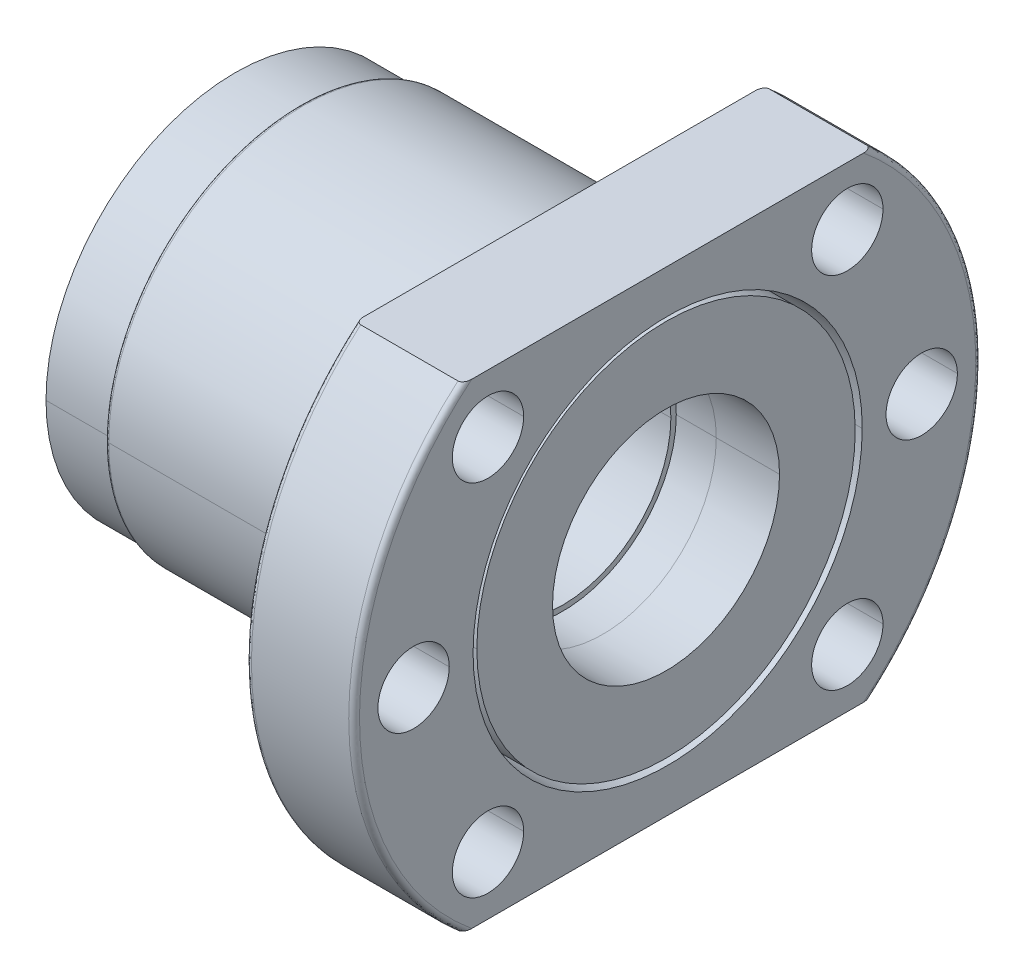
ISO-10303-21;
HEADER;
FILE_DESCRIPTION(('STEP AP214'),'2;1');
FILE_NAME('part.step','',(''),(''),'','','');
FILE_SCHEMA(('AUTOMOTIVE_DESIGN { 1 0 10303 214 1 1 1 1 }'));
ENDSEC;
DATA;
#1=APPLICATION_CONTEXT('core data for automotive mechanical design processes');
#2=APPLICATION_PROTOCOL_DEFINITION('international standard','automotive_design',2000,#1);
#3=PRODUCT_CONTEXT('',#1,'mechanical');
#4=PRODUCT('Part','Part','',(#3));
#5=PRODUCT_RELATED_PRODUCT_CATEGORY('part','',(#4));
#6=PRODUCT_DEFINITION_FORMATION('','',#4);
#7=PRODUCT_DEFINITION_CONTEXT('part definition',#1,'design');
#8=PRODUCT_DEFINITION('design','',#6,#7);
#9=PRODUCT_DEFINITION_SHAPE('','',#8);
#10=(LENGTH_UNIT() NAMED_UNIT(*) SI_UNIT(.MILLI.,.METRE.));
#11=(NAMED_UNIT(*) PLANE_ANGLE_UNIT() SI_UNIT($,.RADIAN.));
#12=(NAMED_UNIT(*) SI_UNIT($,.STERADIAN.) SOLID_ANGLE_UNIT());
#13=UNCERTAINTY_MEASURE_WITH_UNIT(LENGTH_MEASURE(1.E-05),#10,'distance_accuracy_value','');
#14=(GEOMETRIC_REPRESENTATION_CONTEXT(3) GLOBAL_UNCERTAINTY_ASSIGNED_CONTEXT((#13)) GLOBAL_UNIT_ASSIGNED_CONTEXT((#10,
#11,#12)) REPRESENTATION_CONTEXT('',''));
#15=CARTESIAN_POINT('',(0.,0.,0.));
#16=DIRECTION('',(0.,0.,1.));
#17=DIRECTION('',(1.,0.,0.));
#18=AXIS2_PLACEMENT_3D('',#15,#16,#17);
#19=CARTESIAN_POINT('',(-46.1500000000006,0.,0.));
#20=DIRECTION('',(1.,0.,0.));
#21=DIRECTION('',(0.,0.,-1.));
#22=AXIS2_PLACEMENT_3D('',#19,#20,#21);
#23=CYLINDRICAL_SURFACE('',#22,10.5);
#24=CARTESIAN_POINT('',(-20.0891437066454,0.,0.));
#25=DIRECTION('',(1.,0.,0.));
#26=DIRECTION('',(0.,0.,-1.));
#27=AXIS2_PLACEMENT_3D('',#24,#25,#26);
#28=CIRCLE('',#27,10.5);
#29=CARTESIAN_POINT('',(-20.0891437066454,0.,10.5));
#30=VERTEX_POINT('',#29);
#31=CARTESIAN_POINT('',(-20.0891437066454,0.,-10.5));
#32=VERTEX_POINT('',#31);
#33=EDGE_CURVE('P0_E87',#30,#32,#28,.T.);
#34=ORIENTED_EDGE('',*,*,#33,.F.);
#35=DIRECTION('',(1.,0.,0.));
#36=VECTOR('',#35,1.);
#37=CARTESIAN_POINT('',(-46.1500000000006,0.,10.5));
#38=LINE('',#37,#36);
#39=CARTESIAN_POINT('',(-14.2391437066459,0.,10.5));
#40=VERTEX_POINT('',#39);
#41=EDGE_CURVE('P0_E80',#30,#40,#38,.T.);
#42=ORIENTED_EDGE('',*,*,#41,.T.);
#43=CARTESIAN_POINT('',(-14.2391437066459,0.,0.));
#44=DIRECTION('',(1.,0.,0.));
#45=DIRECTION('',(0.,0.,-1.));
#46=AXIS2_PLACEMENT_3D('',#43,#44,#45);
#47=CIRCLE('',#46,10.5);
#48=CARTESIAN_POINT('',(-14.2391437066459,0.,-10.5));
#49=VERTEX_POINT('',#48);
#50=EDGE_CURVE('P0_E11',#40,#49,#47,.T.);
#51=ORIENTED_EDGE('',*,*,#50,.T.);
#52=DIRECTION('',(1.,0.,0.));
#53=VECTOR('',#52,1.);
#54=CARTESIAN_POINT('',(-46.1500000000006,0.,-10.5));
#55=LINE('',#54,#53);
#56=EDGE_CURVE('P0_E101',#32,#49,#55,.T.);
#57=ORIENTED_EDGE('',*,*,#56,.F.);
#58=EDGE_LOOP('',(#34,#42,#51,#57));
#59=FACE_BOUND('',#58,.T.);
#60=ADVANCED_FACE('P0_F17',(#59),#23,.F.);
#61=CARTESIAN_POINT('',(-46.1500000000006,0.,0.));
#62=DIRECTION('',(1.,0.,0.));
#63=DIRECTION('',(0.,0.,-1.));
#64=AXIS2_PLACEMENT_3D('',#61,#62,#63);
#65=CYLINDRICAL_SURFACE('',#64,17.5);
#66=CARTESIAN_POINT('',(-20.0891437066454,0.,0.));
#67=DIRECTION('',(1.,0.,0.));
#68=DIRECTION('',(0.,0.,-1.));
#69=AXIS2_PLACEMENT_3D('',#66,#67,#68);
#70=CIRCLE('',#69,17.5);
#71=CARTESIAN_POINT('',(-20.0891437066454,0.,-17.5));
#72=VERTEX_POINT('',#71);
#73=CARTESIAN_POINT('',(-20.0891437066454,0.,17.5));
#74=VERTEX_POINT('',#73);
#75=EDGE_CURVE('P0_E85',#72,#74,#70,.T.);
#76=ORIENTED_EDGE('',*,*,#75,.T.);
#77=DIRECTION('',(1.,0.,0.));
#78=VECTOR('',#77,1.);
#79=CARTESIAN_POINT('',(-46.1500000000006,0.,17.5));
#80=LINE('',#79,#78);
#81=CARTESIAN_POINT('',(-14.239143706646,0.,17.5));
#82=VERTEX_POINT('',#81);
#83=EDGE_CURVE('P0_E76',#74,#82,#80,.T.);
#84=ORIENTED_EDGE('',*,*,#83,.T.);
#85=CARTESIAN_POINT('',(-14.239143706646,0.,0.));
#86=DIRECTION('',(-1.,0.,0.));
#87=DIRECTION('',(0.,0.,-1.));
#88=AXIS2_PLACEMENT_3D('',#85,#86,#87);
#89=CIRCLE('',#88,17.5);
#90=CARTESIAN_POINT('',(-14.239143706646,0.,-17.5));
#91=VERTEX_POINT('',#90);
#92=EDGE_CURVE('P0_E25',#82,#91,#89,.T.);
#93=ORIENTED_EDGE('',*,*,#92,.T.);
#94=DIRECTION('',(1.,0.,0.));
#95=VECTOR('',#94,1.);
#96=CARTESIAN_POINT('',(-46.1500000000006,0.,-17.5));
#97=LINE('',#96,#95);
#98=EDGE_CURVE('P0_E78',#72,#91,#97,.T.);
#99=ORIENTED_EDGE('',*,*,#98,.F.);
#100=EDGE_LOOP('',(#76,#84,#93,#99));
#101=FACE_BOUND('',#100,.T.);
#102=ADVANCED_FACE('P0_F83',(#101),#65,.T.);
#103=CARTESIAN_POINT('',(-14.2391437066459,-17.9124000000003,-17.9124000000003));
#104=DIRECTION('',(-1.,0.,0.));
#105=DIRECTION('',(0.,0.,1.));
#106=AXIS2_PLACEMENT_3D('',#103,#104,#105);
#107=PLANE('',#106);
#108=CARTESIAN_POINT('',(-14.2391437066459,0.,0.));
#109=DIRECTION('',(1.,0.,0.));
#110=DIRECTION('',(0.,0.,-1.));
#111=AXIS2_PLACEMENT_3D('',#108,#109,#110);
#112=CIRCLE('',#111,10.5);
#113=EDGE_CURVE('P0_E69',#49,#40,#112,.T.);
#114=ORIENTED_EDGE('',*,*,#113,.F.);
#115=ORIENTED_EDGE('',*,*,#50,.F.);
#116=EDGE_LOOP('',(#114,#115));
#117=FACE_BOUND('',#116,.T.);
#118=CARTESIAN_POINT('',(-14.239143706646,0.,0.));
#119=DIRECTION('',(-1.,0.,0.));
#120=DIRECTION('',(0.,0.,-1.));
#121=AXIS2_PLACEMENT_3D('',#118,#119,#120);
#122=CIRCLE('',#121,17.5);
#123=EDGE_CURVE('P0_E63',#91,#82,#122,.T.);
#124=ORIENTED_EDGE('',*,*,#123,.F.);
#125=ORIENTED_EDGE('',*,*,#92,.F.);
#126=EDGE_LOOP('',(#124,#125));
#127=FACE_BOUND('',#126,.T.);
#128=ADVANCED_FACE('P0_F62',(#117,#127),#107,.F.);
#129=CARTESIAN_POINT('',(-46.1500000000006,0.,0.));
#130=DIRECTION('',(1.,0.,0.));
#131=DIRECTION('',(0.,0.,-1.));
#132=AXIS2_PLACEMENT_3D('',#129,#130,#131);
#133=CYLINDRICAL_SURFACE('',#132,10.5);
#134=ORIENTED_EDGE('',*,*,#41,.F.);
#135=CARTESIAN_POINT('',(-20.0891437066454,0.,0.));
#136=DIRECTION('',(1.,0.,0.));
#137=DIRECTION('',(0.,0.,-1.));
#138=AXIS2_PLACEMENT_3D('',#135,#136,#137);
#139=CIRCLE('',#138,10.5);
#140=EDGE_CURVE('P0_E96',#32,#30,#139,.T.);
#141=ORIENTED_EDGE('',*,*,#140,.F.);
#142=ORIENTED_EDGE('',*,*,#56,.T.);
#143=ORIENTED_EDGE('',*,*,#113,.T.);
#144=EDGE_LOOP('',(#134,#141,#142,#143));
#145=FACE_BOUND('',#144,.T.);
#146=ADVANCED_FACE('P0_F108',(#145),#133,.F.);
#147=CARTESIAN_POINT('',(-46.1500000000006,0.,0.));
#148=DIRECTION('',(1.,0.,0.));
#149=DIRECTION('',(0.,0.,-1.));
#150=AXIS2_PLACEMENT_3D('',#147,#148,#149);
#151=CYLINDRICAL_SURFACE('',#150,17.5);
#152=ORIENTED_EDGE('',*,*,#83,.F.);
#153=CARTESIAN_POINT('',(-20.0891437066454,0.,0.));
#154=DIRECTION('',(1.,0.,0.));
#155=DIRECTION('',(0.,0.,-1.));
#156=AXIS2_PLACEMENT_3D('',#153,#154,#155);
#157=CIRCLE('',#156,17.5);
#158=EDGE_CURVE('P0_E116',#74,#72,#157,.T.);
#159=ORIENTED_EDGE('',*,*,#158,.T.);
#160=ORIENTED_EDGE('',*,*,#98,.T.);
#161=ORIENTED_EDGE('',*,*,#123,.T.);
#162=EDGE_LOOP('',(#152,#159,#160,#161));
#163=FACE_BOUND('',#162,.T.);
#164=ADVANCED_FACE('P0_F73',(#163),#151,.T.);
#165=CARTESIAN_POINT('',(-20.0891437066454,14.,0.));
#166=DIRECTION('',(-1.,0.,0.));
#167=DIRECTION('',(0.,0.,1.));
#168=AXIS2_PLACEMENT_3D('',#165,#166,#167);
#169=PLANE('',#168);
#170=ORIENTED_EDGE('',*,*,#140,.T.);
#171=ORIENTED_EDGE('',*,*,#33,.T.);
#172=EDGE_LOOP('',(#170,#171));
#173=FACE_BOUND('',#172,.T.);
#174=ORIENTED_EDGE('',*,*,#75,.F.);
#175=ORIENTED_EDGE('',*,*,#158,.F.);
#176=EDGE_LOOP('',(#174,#175));
#177=FACE_BOUND('',#176,.T.);
#178=ADVANCED_FACE('P0_F113',(#173,#177),#169,.T.);
#179=CLOSED_SHELL('',(#60,#102,#128,#146,#164,#178));
#180=MANIFOLD_SOLID_BREP('P0_B1',#179);
#181=CARTESIAN_POINT('',(0.,0.,0.));
#182=DIRECTION('',(-1.,0.,0.));
#183=DIRECTION('',(0.,0.,1.));
#184=AXIS2_PLACEMENT_3D('',#181,#182,#183);
#185=CYLINDRICAL_SURFACE('',#184,10.);
#186=DIRECTION('',(-1.,0.,0.));
#187=VECTOR('',#186,1.);
#188=CARTESIAN_POINT('',(0.,0.,-10.));
#189=LINE('',#188,#187);
#190=CARTESIAN_POINT('',(-23.7891437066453,0.,-10.));
#191=VERTEX_POINT('',#190);
#192=CARTESIAN_POINT('',(-47.7891437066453,0.,-10.));
#193=VERTEX_POINT('',#192);
#194=EDGE_CURVE('P1_E354',#191,#193,#189,.T.);
#195=ORIENTED_EDGE('',*,*,#194,.F.);
#196=CARTESIAN_POINT('',(-23.7891437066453,0.,0.));
#197=DIRECTION('',(-1.,0.,0.));
#198=DIRECTION('',(0.,0.,-1.));
#199=AXIS2_PLACEMENT_3D('',#196,#197,#198);
#200=CIRCLE('',#199,10.);
#201=CARTESIAN_POINT('',(-23.7891437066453,0.,10.));
#202=VERTEX_POINT('',#201);
#203=EDGE_CURVE('P1_E340',#202,#191,#200,.T.);
#204=ORIENTED_EDGE('',*,*,#203,.F.);
#205=DIRECTION('',(-1.,0.,0.));
#206=VECTOR('',#205,1.);
#207=CARTESIAN_POINT('',(0.,0.,10.));
#208=LINE('',#207,#206);
#209=CARTESIAN_POINT('',(-47.7891437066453,0.,10.));
#210=VERTEX_POINT('',#209);
#211=EDGE_CURVE('P1_E363',#202,#210,#208,.T.);
#212=ORIENTED_EDGE('',*,*,#211,.T.);
#213=CARTESIAN_POINT('',(-47.7891437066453,0.,0.));
#214=DIRECTION('',(-1.,0.,0.));
#215=DIRECTION('',(0.,0.,-1.));
#216=AXIS2_PLACEMENT_3D('',#213,#214,#215);
#217=CIRCLE('',#216,10.);
#218=EDGE_CURVE('P1_E355',#210,#193,#217,.T.);
#219=ORIENTED_EDGE('',*,*,#218,.T.);
#220=EDGE_LOOP('',(#195,#204,#212,#219));
#221=FACE_BOUND('',#220,.T.);
#222=ADVANCED_FACE('P1_F16',(#221),#185,.F.);
#223=CARTESIAN_POINT('',(-47.7891437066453,-18.0000000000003,0.));
#224=CARTESIAN_POINT('',(-47.7891437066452,-18.0000000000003,-36.0000000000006));
#225=CARTESIAN_POINT('',(-47.7891437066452,18.0000000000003,-36.0000000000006));
#226=CARTESIAN_POINT('',(-47.7891437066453,18.0000000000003,0.));
#227=CARTESIAN_POINT('',(-47.9648796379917,-18.0000000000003,0.));
#228=CARTESIAN_POINT('',(-47.9648796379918,-18.0000000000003,-36.0000000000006));
#229=CARTESIAN_POINT('',(-47.9648796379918,18.0000000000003,-36.0000000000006));
#230=CARTESIAN_POINT('',(-47.9648796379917,18.0000000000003,0.));
#231=CARTESIAN_POINT('',(-48.0891437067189,-17.8757359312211,0.));
#232=CARTESIAN_POINT('',(-48.0891437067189,-17.8757359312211,-35.7514718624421));
#233=CARTESIAN_POINT('',(-48.0891437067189,17.8757359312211,-35.7514718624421));
#234=CARTESIAN_POINT('',(-48.0891437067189,17.8757359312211,0.));
#235=CARTESIAN_POINT('',(-48.0891437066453,-17.6999999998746,0.));
#236=CARTESIAN_POINT('',(-48.0891437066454,-17.6999999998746,-35.3999999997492));
#237=CARTESIAN_POINT('',(-48.0891437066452,17.6999999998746,-35.3999999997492));
#238=CARTESIAN_POINT('',(-48.0891437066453,17.6999999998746,0.));
#239=(BOUNDED_SURFACE() B_SPLINE_SURFACE(3,3,((#223,#224,#225,#226),(#227,#228,#229,#230),(#231,
#232,#233,#234),(#235,#236,#237,#238)),.UNSPECIFIED.,.F.,.F.,
.F.) B_SPLINE_SURFACE_WITH_KNOTS((4,4),(4,4),(0.,1.),(0.,1.),
.UNSPECIFIED.) GEOMETRIC_REPRESENTATION_ITEM() RATIONAL_B_SPLINE_SURFACE(((1.,0.333333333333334,
0.333333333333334,1.),(0.80473785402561,0.26824595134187,0.26824595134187,0.80473785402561),
(0.80473785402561,0.26824595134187,0.26824595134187,0.80473785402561),(1.,0.333333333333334,
0.333333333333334,1.))) REPRESENTATION_ITEM('') SURFACE());
#240=CARTESIAN_POINT('',(-47.7891437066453,0.,0.));
#241=DIRECTION('',(1.,0.,0.));
#242=DIRECTION('',(0.,0.,-1.));
#243=AXIS2_PLACEMENT_3D('',#240,#241,#242);
#244=CIRCLE('',#243,18.);
#245=CARTESIAN_POINT('',(-47.7891437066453,-18.,0.));
#246=VERTEX_POINT('',#245);
#247=CARTESIAN_POINT('',(-47.7891437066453,0.,-18.));
#248=VERTEX_POINT('',#247);
#249=EDGE_CURVE('P1_E10',#246,#248,#244,.T.);
#250=CARTESIAN_POINT('',(-47.7891437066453,-17.7000000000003,0.));
#251=DIRECTION('',(0.,0.,-1.));
#252=DIRECTION('',(0.,-1.,0.));
#253=AXIS2_PLACEMENT_3D('',#250,#251,#252);
#254=CIRCLE('',#253,0.300000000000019);
#255=CARTESIAN_POINT('',(-48.0891437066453,-17.7000000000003,0.));
#256=VERTEX_POINT('',#255);
#257=EDGE_CURVE('P1_E622',#246,#256,#254,.T.);
#258=CARTESIAN_POINT('',(-48.0891437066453,-17.7000000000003,0.));
#259=CARTESIAN_POINT('',(-48.0891437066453,-17.7000000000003,-10.3684199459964));
#260=CARTESIAN_POINT('',(-48.0891437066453,-10.3684199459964,-17.7000000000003));
#261=CARTESIAN_POINT('',(-48.0891437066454,0.,-17.7000000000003));
#262=(BOUNDED_CURVE() B_SPLINE_CURVE(3,(#258,#259,#260,#261),.UNSPECIFIED.,.F.,
.F.) B_SPLINE_CURVE_WITH_KNOTS((4,4),(0.,1.),
.UNSPECIFIED.) CURVE() GEOMETRIC_REPRESENTATION_ITEM() RATIONAL_B_SPLINE_CURVE((1.,
0.804737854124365,0.804737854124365,1.)) REPRESENTATION_ITEM(''));
#263=CARTESIAN_POINT('',(-48.0891437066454,0.,-17.7000000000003));
#264=VERTEX_POINT('',#263);
#265=EDGE_CURVE('P1_E386',#256,#264,#262,.T.);
#266=CARTESIAN_POINT('',(-48.0891437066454,0.,-17.7000000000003));
#267=CARTESIAN_POINT('',(-48.0891437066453,10.3684199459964,-17.7000000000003));
#268=CARTESIAN_POINT('',(-48.0891437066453,17.7000000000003,-10.3684199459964));
#269=CARTESIAN_POINT('',(-48.0891437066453,17.6999999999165,8.40230641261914E-08));
#270=(BOUNDED_CURVE() B_SPLINE_CURVE(3,(#266,#267,#268,#269),.UNSPECIFIED.,.F.,
.F.) B_SPLINE_CURVE_WITH_KNOTS((4,4),(0.,1.),
.UNSPECIFIED.) CURVE() GEOMETRIC_REPRESENTATION_ITEM() RATIONAL_B_SPLINE_CURVE((1.,
0.804737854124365,0.804737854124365,1.)) REPRESENTATION_ITEM(''));
#271=CARTESIAN_POINT('',(-48.0891437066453,17.6999999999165,8.40230641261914E-08));
#272=VERTEX_POINT('',#271);
#273=EDGE_CURVE('P1_E392',#264,#272,#270,.T.);
#274=CARTESIAN_POINT('',(-47.7891437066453,17.7000000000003,0.));
#275=DIRECTION('',(0.,0.,1.));
#276=DIRECTION('',(0.,1.,0.));
#277=AXIS2_PLACEMENT_3D('',#274,#275,#276);
#278=CIRCLE('',#277,0.300000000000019);
#279=CARTESIAN_POINT('',(-47.7891437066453,18.,0.));
#280=VERTEX_POINT('',#279);
#281=EDGE_CURVE('P1_E621',#280,#272,#278,.T.);
#282=CARTESIAN_POINT('',(-47.7891437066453,0.,0.));
#283=DIRECTION('',(1.,0.,0.));
#284=DIRECTION('',(0.,0.,-1.));
#285=AXIS2_PLACEMENT_3D('',#282,#283,#284);
#286=CIRCLE('',#285,18.);
#287=EDGE_CURVE('P1_E412',#248,#280,#286,.T.);
#288=ORIENTED_EDGE('',*,*,#249,.F.);
#289=ORIENTED_EDGE('',*,*,#257,.T.);
#290=ORIENTED_EDGE('',*,*,#265,.T.);
#291=ORIENTED_EDGE('',*,*,#273,.T.);
#292=ORIENTED_EDGE('',*,*,#281,.F.);
#293=ORIENTED_EDGE('',*,*,#287,.F.);
#294=EDGE_LOOP('',(#288,#289,#290,#291,#292,#293));
#295=FACE_BOUND('',#294,.T.);
#296=ADVANCED_FACE('P1_F753',(#295),#239,.T.);
#297=CARTESIAN_POINT('',(-23.589143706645,0.,-29.));
#298=CARTESIAN_POINT('',(-23.589143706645,8.8696892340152,-28.9999999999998));
#299=CARTESIAN_POINT('',(-23.589143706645,16.880974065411,-25.1933344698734));
#300=CARTESIAN_POINT('',(-23.589143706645,22.483197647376,-18.3168180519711));
#301=CARTESIAN_POINT('',(-23.8820369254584,0.,-28.9999999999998));
#302=CARTESIAN_POINT('',(-23.8820369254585,8.86968923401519,-28.9999999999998));
#303=CARTESIAN_POINT('',(-23.8820369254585,16.880974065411,-25.1933344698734));
#304=CARTESIAN_POINT('',(-23.8820369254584,22.483197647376,-18.3168180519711));
#305=CARTESIAN_POINT('',(-24.089143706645,0.,-28.7928932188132));
#306=CARTESIAN_POINT('',(-24.089143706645,8.80634534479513,-28.7928932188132));
#307=CARTESIAN_POINT('',(-24.089143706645,16.7604166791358,-25.013413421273));
#308=CARTESIAN_POINT('',(-24.089143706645,22.3226313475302,-18.1860064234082));
#309=CARTESIAN_POINT('',(-24.089143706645,0.,-28.5));
#310=CARTESIAN_POINT('',(-24.089143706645,8.71676355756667,-28.4999999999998));
#311=CARTESIAN_POINT('',(-24.089143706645,16.5899227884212,-24.758966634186));
#312=CARTESIAN_POINT('',(-24.089143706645,22.0955563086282,-18.0010108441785));
#313=(BOUNDED_SURFACE() B_SPLINE_SURFACE(3,3,((#297,#298,#299,#300),(#301,#302,#303,#304),(#305,
#306,#307,#308),(#309,#310,#311,#312)),.UNSPECIFIED.,.F.,.F.,
.F.) B_SPLINE_SURFACE_WITH_KNOTS((4,4),(4,4),(0.,1.),(0.,1.),
.UNSPECIFIED.) GEOMETRIC_REPRESENTATION_ITEM() RATIONAL_B_SPLINE_SURFACE(((1.,0.935480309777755,
0.935480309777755,1.),(0.804737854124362,0.752816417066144,0.752816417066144,0.804737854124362),
(0.804737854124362,0.752816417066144,0.752816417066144,0.804737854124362),(1.,0.935480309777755,
0.935480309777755,1.))) REPRESENTATION_ITEM('') SURFACE());
#314=CARTESIAN_POINT('',(-23.589143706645,0.,0.));
#315=DIRECTION('',(-1.,0.,0.));
#316=DIRECTION('',(0.,0.,-1.));
#317=AXIS2_PLACEMENT_3D('',#314,#315,#316);
#318=CIRCLE('',#317,29.);
#319=CARTESIAN_POINT('',(-23.589143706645,22.,-18.8944436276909));
#320=VERTEX_POINT('',#319);
#321=CARTESIAN_POINT('',(-23.589143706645,0.,-29.));
#322=VERTEX_POINT('',#321);
#323=EDGE_CURVE('P1_E550',#320,#322,#318,.T.);
#324=CARTESIAN_POINT('',(-23.589143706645,0.,-28.5));
#325=DIRECTION('',(0.,1.,0.));
#326=DIRECTION('',(0.,0.,-1.));
#327=AXIS2_PLACEMENT_3D('',#324,#325,#326);
#328=CIRCLE('',#327,0.5);
#329=CARTESIAN_POINT('',(-24.0891437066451,-1.26753466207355E-07,-28.5000000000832));
#330=VERTEX_POINT('',#329);
#331=EDGE_CURVE('P1_E644',#322,#330,#328,.T.);
#332=CARTESIAN_POINT('',(-24.0891437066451,-1.26753466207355E-07,-28.5000000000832));
#333=CARTESIAN_POINT('',(-24.089143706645,8.66121105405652,-28.5000000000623));
#334=CARTESIAN_POINT('',(-24.089143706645,16.4940009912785,-24.80351806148));
#335=CARTESIAN_POINT('',(-24.0891437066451,22.0000000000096,-18.117670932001));
#336=(BOUNDED_CURVE() B_SPLINE_CURVE(3,(#332,#333,#334,#335),.UNSPECIFIED.,.F.,
.F.) B_SPLINE_CURVE_WITH_KNOTS((4,4),(0.,1.),
.UNSPECIFIED.) CURVE() GEOMETRIC_REPRESENTATION_ITEM() RATIONAL_B_SPLINE_CURVE((1.,
0.936235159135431,0.936235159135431,1.)) REPRESENTATION_ITEM(''));
#337=CARTESIAN_POINT('',(-24.0891437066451,22.0000000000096,-18.117670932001));
#338=VERTEX_POINT('',#337);
#339=EDGE_CURVE('P1_E423',#330,#338,#336,.T.);
#340=CARTESIAN_POINT('',(-24.089143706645,22.0000000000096,-18.1176709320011));
#341=CARTESIAN_POINT('',(-24.0891435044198,21.9999368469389,-18.1243482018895));
#342=CARTESIAN_POINT('',(-24.089090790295,21.9998777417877,-18.1310258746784));
#343=CARTESIAN_POINT('',(-24.0887304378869,21.9996960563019,-18.1537359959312));
#344=CARTESIAN_POINT('',(-24.0881690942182,21.9996005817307,-18.1697654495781));
#345=CARTESIAN_POINT('',(-24.0866550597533,21.9995316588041,-18.1973672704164));
#346=CARTESIAN_POINT('',(-24.0858532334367,21.9995317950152,-18.2089481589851));
#347=CARTESIAN_POINT('',(-24.0837060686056,21.9995669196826,-18.2345257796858));
#348=CARTESIAN_POINT('',(-24.0822816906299,21.9996092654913,-18.2485159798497));
#349=CARTESIAN_POINT('',(-24.0786283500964,21.999727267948,-18.2789216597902));
#350=CARTESIAN_POINT('',(-24.0763012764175,21.9998075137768,-18.2953253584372));
#351=CARTESIAN_POINT('',(-24.0705277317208,21.9999375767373,-18.3305414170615));
#352=CARTESIAN_POINT('',(-24.0669639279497,21.9999807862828,-18.3493347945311));
#353=CARTESIAN_POINT('',(-24.0602352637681,22.0000127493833,-18.3804238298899));
#354=CARTESIAN_POINT('',(-24.05733958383,22.0000149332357,-18.3927783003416));
#355=CARTESIAN_POINT('',(-24.0512456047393,22.0000397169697,-18.4168067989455));
#356=CARTESIAN_POINT('',(-24.0480674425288,22.0000613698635,-18.4284859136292));
#357=CARTESIAN_POINT('',(-24.0414677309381,22.0000974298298,-18.4511501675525));
#358=CARTESIAN_POINT('',(-24.0380659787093,22.0001121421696,-18.4621410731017));
#359=CARTESIAN_POINT('',(-24.0310733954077,22.0001315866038,-18.4834194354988));
#360=CARTESIAN_POINT('',(-24.0275021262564,22.0001368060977,-18.4937133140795));
#361=CARTESIAN_POINT('',(-24.0202248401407,22.0001346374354,-18.5135926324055));
#362=CARTESIAN_POINT('',(-24.0165380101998,22.0001279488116,-18.523185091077));
#363=CARTESIAN_POINT('',(-24.0090813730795,22.0001053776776,-18.5416603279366));
#364=CARTESIAN_POINT('',(-24.0053303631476,22.0000900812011,-18.5505506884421));
#365=CARTESIAN_POINT('',(-23.9977947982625,22.0000562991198,-18.5676241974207));
#366=CARTESIAN_POINT('',(-23.994028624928,22.0000380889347,-18.5758154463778));
#367=CARTESIAN_POINT('',(-23.9865072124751,22.0000114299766,-18.591494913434));
#368=CARTESIAN_POINT('',(-23.9827700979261,22.0000023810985,-18.5989918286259));
#369=CARTESIAN_POINT('',(-23.9733605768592,21.9999965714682,-18.6171333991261));
#370=CARTESIAN_POINT('',(-23.9675600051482,22.0000069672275,-18.6277120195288));
#371=CARTESIAN_POINT('',(-23.9556663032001,22.0000308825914,-18.6482168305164));
#372=CARTESIAN_POINT('',(-23.949590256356,22.0000442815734,-18.6581529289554));
#373=CARTESIAN_POINT('',(-23.9371838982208,22.0000692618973,-18.6773611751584));
#374=CARTESIAN_POINT('',(-23.9308706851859,22.0000808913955,-18.6866443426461));
#375=CARTESIAN_POINT('',(-23.9180310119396,22.0000964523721,-18.7045389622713));
#376=CARTESIAN_POINT('',(-23.9115214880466,22.0001006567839,-18.7131625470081));
#377=CARTESIAN_POINT('',(-23.8983292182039,22.000100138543,-18.7297331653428));
#378=CARTESIAN_POINT('',(-23.8916631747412,22.0000957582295,-18.737693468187));
#379=CARTESIAN_POINT('',(-23.8781973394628,22.0000798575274,-18.7529353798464));
#380=CARTESIAN_POINT('',(-23.8714139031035,22.0000686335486,-18.7602314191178));
#381=CARTESIAN_POINT('',(-23.8577505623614,22.0000438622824,-18.7741460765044));
#382=CARTESIAN_POINT('',(-23.8508865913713,22.0000304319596,-18.7807802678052));
#383=CARTESIAN_POINT('',(-23.8404328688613,22.000014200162,-18.7903282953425));
#384=CARTESIAN_POINT('',(-23.8369818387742,22.0000094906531,-18.7933949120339));
#385=CARTESIAN_POINT('',(-23.8300710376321,22.000002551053,-18.7993621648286));
#386=CARTESIAN_POINT('',(-23.8266131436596,22.0000002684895,-18.8022649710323));
#387=CARTESIAN_POINT('',(-23.8185889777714,21.9999996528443,-18.8088046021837));
#388=CARTESIAN_POINT('',(-23.8139948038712,22.0000026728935,-18.8124072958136));
#389=CARTESIAN_POINT('',(-23.8047334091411,22.0000135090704,-18.8193837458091));
#390=CARTESIAN_POINT('',(-23.8000680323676,22.0000212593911,-18.8227599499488));
#391=CARTESIAN_POINT('',(-23.7906712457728,22.0000392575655,-18.8292812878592));
#392=CARTESIAN_POINT('',(-23.7859415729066,22.000049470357,-18.8324289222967));
#393=CARTESIAN_POINT('',(-23.7764234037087,22.0000705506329,-18.8384911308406));
#394=CARTESIAN_POINT('',(-23.7716365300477,22.0000814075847,-18.8414082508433));
#395=CARTESIAN_POINT('',(-23.7620113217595,22.0001022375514,-18.847007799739));
#396=CARTESIAN_POINT('',(-23.7571744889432,22.0001122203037,-18.8496928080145));
#397=CARTESIAN_POINT('',(-23.7474568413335,22.0001301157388,-18.8548268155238));
#398=CARTESIAN_POINT('',(-23.7425774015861,22.0001380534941,-18.8572784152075));
#399=CARTESIAN_POINT('',(-23.7327820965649,22.000151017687,-18.8619446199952));
#400=CARTESIAN_POINT('',(-23.7278674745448,22.0001560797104,-18.8641618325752));
#401=CARTESIAN_POINT('',(-23.7180094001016,22.0001627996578,-18.8683586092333));
#402=CARTESIAN_POINT('',(-23.7130670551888,22.000164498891,-18.870340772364));
#403=CARTESIAN_POINT('',(-23.7031611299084,22.0001643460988,-18.8740671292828));
#404=CARTESIAN_POINT('',(-23.6981985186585,22.000162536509,-18.8758138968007));
#405=CARTESIAN_POINT('',(-23.6882596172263,22.0001555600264,-18.8790694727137));
#406=CARTESIAN_POINT('',(-23.6832841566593,22.0001504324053,-18.880580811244));
#407=CARTESIAN_POINT('',(-23.6733270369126,22.0001373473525,-18.8833658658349));
#408=CARTESIAN_POINT('',(-23.6683460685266,22.000129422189,-18.884642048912));
#409=CARTESIAN_POINT('',(-23.6583853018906,22.0001115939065,-18.8869574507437));
#410=CARTESIAN_POINT('',(-23.6534060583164,22.0001017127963,-18.887999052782));
#411=CARTESIAN_POINT('',(-23.6434559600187,22.0000811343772,-18.8898462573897));
#412=CARTESIAN_POINT('',(-23.6384855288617,22.0000704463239,-18.8906541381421));
#413=CARTESIAN_POINT('',(-23.6285601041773,22.000049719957,-18.8920351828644));
#414=CARTESIAN_POINT('',(-23.6236054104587,22.0000396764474,-18.8926104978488));
#415=CARTESIAN_POINT('',(-23.613718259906,22.0000219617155,-18.893527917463));
#416=CARTESIAN_POINT('',(-23.608785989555,22.0000142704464,-18.8938720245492));
#417=CARTESIAN_POINT('',(-23.5989503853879,22.0000033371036,-18.8943290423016));
#418=CARTESIAN_POINT('',(-23.5940471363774,22.0000000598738,-18.8944437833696));
#419=CARTESIAN_POINT('',(-23.589143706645,22.,-18.8944436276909));
#420=B_SPLINE_CURVE_WITH_KNOTS('',3,(#340,#341,#342,#343,#344,#345,#346,#347,#348,#349,#350,
#351,#352,#353,#354,#355,#356,#357,#358,#359,#360,#361,#362,#363,#364,#365,#366,#367,#368,#369,
#370,#371,#372,#373,#374,#375,#376,#377,#378,#379,#380,#381,#382,#383,#384,#385,#386,#387,#388,
#389,#390,#391,#392,#393,#394,#395,#396,#397,#398,#399,#400,#401,#402,#403,#404,#405,#406,#407,
#408,#409,#410,#411,#412,#413,#414,#415,#416,#417,#418,#419),.UNSPECIFIED.,.F.,.F.,(4,2,2,2,2,2,
2,2,2,2,2,2,2,2,2,2,2,2,2,2,2,2,2,2,2,2,2,2,2,2,2,2,2,2,2,2,2,2,2,4),(0.,0.0200333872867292,
0.0681380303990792,0.102959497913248,0.145137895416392,0.194827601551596,0.252186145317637,
0.29024676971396,0.326550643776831,0.36105993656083,0.393741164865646,0.424565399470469,
0.453508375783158,0.48055054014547,0.505677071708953,0.541856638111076,0.576783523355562,
0.61044950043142,0.642849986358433,0.673984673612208,0.70385819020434,0.732480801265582,
0.74632929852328,0.759871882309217,0.777382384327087,0.79465466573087,0.811694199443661,
0.8285067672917,0.845098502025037,0.861475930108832,0.877646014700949,0.89361619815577,
0.909394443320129,0.9249892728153,0.940409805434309,0.955665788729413,0.970767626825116,
0.985726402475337,1.00055389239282,1.01526257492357),.UNSPECIFIED.);
#421=EDGE_CURVE('P1_E640',#338,#320,#420,.T.);
#422=ORIENTED_EDGE('',*,*,#323,.T.);
#423=ORIENTED_EDGE('',*,*,#331,.T.);
#424=ORIENTED_EDGE('',*,*,#339,.T.);
#425=ORIENTED_EDGE('',*,*,#421,.T.);
#426=EDGE_LOOP('',(#422,#423,#424,#425));
#427=FACE_BOUND('',#426,.T.);
#428=ADVANCED_FACE('P1_F746',(#427),#313,.T.);
#429=CARTESIAN_POINT('',(-14.089143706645,0.,-28.5));
#430=CARTESIAN_POINT('',(-14.089143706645,8.71676355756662,-28.5));
#431=CARTESIAN_POINT('',(-14.089143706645,16.5899227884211,-24.7589666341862));
#432=CARTESIAN_POINT('',(-14.089143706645,22.0955563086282,-18.0010108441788));
#433=CARTESIAN_POINT('',(-14.089143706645,0.,-28.7928932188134));
#434=CARTESIAN_POINT('',(-14.089143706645,8.80634534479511,-28.7928932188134));
#435=CARTESIAN_POINT('',(-14.089143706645,16.7604166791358,-25.0134134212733));
#436=CARTESIAN_POINT('',(-14.089143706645,22.3226313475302,-18.1860064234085));
#437=CARTESIAN_POINT('',(-14.2962504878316,0.,-29.));
#438=CARTESIAN_POINT('',(-14.2962504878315,8.86968923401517,-29.));
#439=CARTESIAN_POINT('',(-14.2962504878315,16.880974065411,-25.1933344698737));
#440=CARTESIAN_POINT('',(-14.2962504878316,22.4831976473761,-18.3168180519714));
#441=CARTESIAN_POINT('',(-14.589143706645,0.,-29.));
#442=CARTESIAN_POINT('',(-14.589143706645,8.86968923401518,-29.));
#443=CARTESIAN_POINT('',(-14.589143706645,16.880974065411,-25.1933344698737));
#444=CARTESIAN_POINT('',(-14.589143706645,22.4831976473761,-18.3168180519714));
#445=(BOUNDED_SURFACE() B_SPLINE_SURFACE(3,3,((#429,#430,#431,#432),(#433,#434,#435,#436),(#437,
#438,#439,#440),(#441,#442,#443,#444)),.UNSPECIFIED.,.F.,.F.,
.F.) B_SPLINE_SURFACE_WITH_KNOTS((4,4),(4,4),(0.,1.),(0.,1.),
.UNSPECIFIED.) GEOMETRIC_REPRESENTATION_ITEM() RATIONAL_B_SPLINE_SURFACE(((1.,0.935480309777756,
0.935480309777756,1.),(0.804737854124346,0.75281641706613,0.75281641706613,0.804737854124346),
(0.804737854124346,0.75281641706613,0.75281641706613,0.804737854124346),(1.,0.935480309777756,
0.935480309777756,1.))) REPRESENTATION_ITEM('') SURFACE());
#446=CARTESIAN_POINT('',(-14.0891437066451,22.,-18.1176709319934));
#447=CARTESIAN_POINT('',(-14.089143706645,16.4940009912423,-24.8035180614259));
#448=CARTESIAN_POINT('',(-14.089143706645,8.66121105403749,-28.5));
#449=CARTESIAN_POINT('',(-14.0891437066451,1.2675343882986E-07,-28.5000000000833));
#450=(BOUNDED_CURVE() B_SPLINE_CURVE(3,(#446,#447,#448,#449),.UNSPECIFIED.,.F.,
.F.) B_SPLINE_CURVE_WITH_KNOTS((4,4),(0.,1.),
.UNSPECIFIED.) CURVE() GEOMETRIC_REPRESENTATION_ITEM() RATIONAL_B_SPLINE_CURVE((1.,
0.936235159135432,0.936235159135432,1.)) REPRESENTATION_ITEM(''));
#451=CARTESIAN_POINT('',(-14.0891437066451,22.,-18.1176709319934));
#452=VERTEX_POINT('',#451);
#453=CARTESIAN_POINT('',(-14.0891437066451,1.2675343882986E-07,-28.5000000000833));
#454=VERTEX_POINT('',#453);
#455=EDGE_CURVE('P1_E967',#452,#454,#450,.T.);
#456=CARTESIAN_POINT('',(-14.589143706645,0.,-28.5));
#457=DIRECTION('',(0.,1.,0.));
#458=DIRECTION('',(0.,0.,-1.));
#459=AXIS2_PLACEMENT_3D('',#456,#457,#458);
#460=CIRCLE('',#459,0.5);
#461=CARTESIAN_POINT('',(-14.589143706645,0.,-29.));
#462=VERTEX_POINT('',#461);
#463=EDGE_CURVE('P1_E476',#454,#462,#460,.T.);
#464=CARTESIAN_POINT('',(-14.589143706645,0.,0.));
#465=DIRECTION('',(-1.,0.,0.));
#466=DIRECTION('',(0.,0.,-1.));
#467=AXIS2_PLACEMENT_3D('',#464,#465,#466);
#468=CIRCLE('',#467,29.);
#469=CARTESIAN_POINT('',(-14.589143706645,22.,-18.8944436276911));
#470=VERTEX_POINT('',#469);
#471=EDGE_CURVE('P1_E559',#470,#462,#468,.T.);
#472=CARTESIAN_POINT('',(-14.589143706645,22.0000000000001,-18.8944436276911));
#473=CARTESIAN_POINT('',(-14.5842552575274,22.0000000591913,-18.8944437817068));
#474=CARTESIAN_POINT('',(-14.5793669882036,22.0000033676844,-18.894329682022));
#475=CARTESIAN_POINT('',(-14.5695612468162,22.0000144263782,-18.8938752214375));
#476=CARTESIAN_POINT('',(-14.5646438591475,22.0000222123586,-18.8935330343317));
#477=CARTESIAN_POINT('',(-14.5547863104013,22.0000401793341,-18.8926207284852));
#478=CARTESIAN_POINT('',(-14.549846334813,22.0000503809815,-18.892048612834));
#479=CARTESIAN_POINT('',(-14.5399501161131,22.0000714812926,-18.8906752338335));
#480=CARTESIAN_POINT('',(-14.5349941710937,22.000082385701,-18.8898718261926));
#481=CARTESIAN_POINT('',(-14.5250727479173,22.0001034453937,-18.8880348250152));
#482=CARTESIAN_POINT('',(-14.5201076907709,22.0001135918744,-18.8869989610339));
#483=CARTESIAN_POINT('',(-14.5101749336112,22.000131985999,-18.8846962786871));
#484=CARTESIAN_POINT('',(-14.5052077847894,22.0001402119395,-18.8834270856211));
#485=CARTESIAN_POINT('',(-14.4952778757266,22.0001539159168,-18.8806572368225));
#486=CARTESIAN_POINT('',(-14.4903158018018,22.0001593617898,-18.8791541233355));
#487=CARTESIAN_POINT('',(-14.4804031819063,22.0001669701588,-18.8759162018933));
#488=CARTESIAN_POINT('',(-14.4754534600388,22.0001690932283,-18.8741788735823));
#489=CARTESIAN_POINT('',(-14.4655727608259,22.0001698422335,-18.8704725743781));
#490=CARTESIAN_POINT('',(-14.4606427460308,22.0001684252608,-18.868501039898));
#491=CARTESIAN_POINT('',(-14.4508087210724,22.0001622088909,-18.8643266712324));
#492=CARTESIAN_POINT('',(-14.445905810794,22.0001573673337,-18.8621212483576));
#493=CARTESIAN_POINT('',(-14.436133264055,22.0001447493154,-18.8574797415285));
#494=CARTESIAN_POINT('',(-14.4312648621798,22.0001369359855,-18.855041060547));
#495=CARTESIAN_POINT('',(-14.4215685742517,22.0001191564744,-18.8499339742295));
#496=CARTESIAN_POINT('',(-14.4167420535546,22.0001091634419,-18.847262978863));
#497=CARTESIAN_POINT('',(-14.4071367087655,22.0000881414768,-18.8416924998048));
#498=CARTESIAN_POINT('',(-14.402359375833,22.0000771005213,-18.8387904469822));
#499=CARTESIAN_POINT('',(-14.39285948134,22.0000554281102,-18.8327593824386));
#500=CARTESIAN_POINT('',(-14.3881385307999,22.0000448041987,-18.8296278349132));
#501=CARTESIAN_POINT('',(-14.3787583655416,22.0000257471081,-18.8231396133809));
#502=CARTESIAN_POINT('',(-14.3741008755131,22.0000173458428,-18.8197804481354));
#503=CARTESIAN_POINT('',(-14.3648543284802,22.0000047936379,-18.8128390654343));
#504=CARTESIAN_POINT('',(-14.3602671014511,22.0000007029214,-18.8092544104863));
#505=CARTESIAN_POINT('',(-14.3522508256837,21.9999994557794,-18.8027440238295));
#506=CARTESIAN_POINT('',(-14.3487941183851,22.0000009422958,-18.7998522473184));
#507=CARTESIAN_POINT('',(-14.3418849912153,22.0000066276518,-18.7939065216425));
#508=CARTESIAN_POINT('',(-14.3384344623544,22.0000108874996,-18.7908503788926));
#509=CARTESIAN_POINT('',(-14.3279801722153,22.0000260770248,-18.781332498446));
#510=CARTESIAN_POINT('',(-14.3211150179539,22.0000392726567,-18.774717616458));
#511=CARTESIAN_POINT('',(-14.3074463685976,22.0000641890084,-18.7608393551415));
#512=CARTESIAN_POINT('',(-14.300658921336,22.0000758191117,-18.7535602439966));
#513=CARTESIAN_POINT('',(-14.2871822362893,22.0000928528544,-18.7383497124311));
#514=CARTESIAN_POINT('',(-14.2805094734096,22.0000979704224,-18.7304037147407));
#515=CARTESIAN_POINT('',(-14.2673011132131,22.0000999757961,-18.7138589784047));
#516=CARTESIAN_POINT('',(-14.2607823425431,22.0000965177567,-18.7052468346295));
#517=CARTESIAN_POINT('',(-14.2479218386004,22.0000823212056,-18.6873720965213));
#518=CARTESIAN_POINT('',(-14.2415971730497,22.0000713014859,-18.6780972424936));
#519=CARTESIAN_POINT('',(-14.229165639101,22.0000466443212,-18.6589025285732));
#520=CARTESIAN_POINT('',(-14.2230759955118,22.0000329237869,-18.6489715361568));
#521=CARTESIAN_POINT('',(-14.2111541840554,22.0000092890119,-18.6284731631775));
#522=CARTESIAN_POINT('',(-14.2053392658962,21.9999995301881,-18.6178957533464));
#523=CARTESIAN_POINT('',(-14.1958243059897,22.0000003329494,-18.5996047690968));
#524=CARTESIAN_POINT('',(-14.1920016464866,22.0000058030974,-18.5919545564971));
#525=CARTESIAN_POINT('',(-14.1843440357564,22.0000201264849,-18.5760220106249));
#526=CARTESIAN_POINT('',(-14.1805255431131,22.0000291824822,-18.5677317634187));
#527=CARTESIAN_POINT('',(-14.1729171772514,22.0000429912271,-18.5505153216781));
#528=CARTESIAN_POINT('',(-14.1691440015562,22.0000474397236,-18.5415817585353));
#529=CARTESIAN_POINT('',(-14.1616701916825,22.0000483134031,-18.5230770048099));
#530=CARTESIAN_POINT('',(-14.1579865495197,22.0000442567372,-18.513498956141));
#531=CARTESIAN_POINT('',(-14.1507376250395,22.00002692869,-18.4937067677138));
#532=CARTESIAN_POINT('',(-14.147189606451,22.0000131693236,-18.4834863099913));
#533=CARTESIAN_POINT('',(-14.1402595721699,21.9999801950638,-18.4624141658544));
#534=CARTESIAN_POINT('',(-14.1368950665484,21.9999607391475,-18.4515567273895));
#535=CARTESIAN_POINT('',(-14.1303792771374,21.9999195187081,-18.4292193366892));
#536=CARTESIAN_POINT('',(-14.12724561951,21.9998976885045,-18.4177342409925));
#537=CARTESIAN_POINT('',(-14.1212432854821,21.9998780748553,-18.3941536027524));
#538=CARTESIAN_POINT('',(-14.1183924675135,21.9998813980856,-18.3820535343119));
#539=CARTESIAN_POINT('',(-14.1116053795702,21.9998649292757,-18.3509194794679));
#540=CARTESIAN_POINT('',(-14.107962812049,21.9998310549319,-18.3318207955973));
#541=CARTESIAN_POINT('',(-14.1020750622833,21.9997150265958,-18.2960579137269));
#542=CARTESIAN_POINT('',(-14.0997075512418,21.9996400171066,-18.2794135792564));
#543=CARTESIAN_POINT('',(-14.0960019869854,21.9995332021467,-18.2485920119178));
#544=CARTESIAN_POINT('',(-14.09456183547,21.9994965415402,-18.2344270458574));
#545=CARTESIAN_POINT('',(-14.0923996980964,21.9994737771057,-18.2085653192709));
#546=CARTESIAN_POINT('',(-14.0915957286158,21.9994798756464,-18.1968752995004));
#547=CARTESIAN_POINT('',(-14.0900902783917,21.9995650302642,-18.1691385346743));
#548=CARTESIAN_POINT('',(-14.0895373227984,21.9996702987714,-18.1530834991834));
#549=CARTESIAN_POINT('',(-14.0891929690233,21.9998693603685,-18.1305739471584));
#550=CARTESIAN_POINT('',(-14.0891438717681,21.999932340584,-18.1241222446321));
#551=CARTESIAN_POINT('',(-14.089143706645,22.,-18.1176709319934));
#552=B_SPLINE_CURVE_WITH_KNOTS('',3,(#472,#473,#474,#475,#476,#477,#478,#479,#480,#481,#482,
#483,#484,#485,#486,#487,#488,#489,#490,#491,#492,#493,#494,#495,#496,#497,#498,#499,#500,#501,
#502,#503,#504,#505,#506,#507,#508,#509,#510,#511,#512,#513,#514,#515,#516,#517,#518,#519,#520,
#521,#522,#523,#524,#525,#526,#527,#528,#529,#530,#531,#532,#533,#534,#535,#536,#537,#538,#539,
#540,#541,#542,#543,#544,#545,#546,#547,#548,#549,#550,#551),.UNSPECIFIED.,.F.,.F.,(4,2,2,2,2,2,
2,2,2,2,2,2,2,2,2,2,2,2,2,2,2,2,2,2,2,2,2,2,2,2,2,2,2,2,2,2,2,2,2,4),(0.,0.0146637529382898,
0.0294463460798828,0.044360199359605,0.0594170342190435,0.0746278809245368,0.0900030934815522,
0.105552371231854,0.121284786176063,0.137208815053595,0.153332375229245,0.169662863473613,
0.186207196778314,0.202971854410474,0.219962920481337,0.237186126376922,0.254646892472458,
0.268165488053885,0.281992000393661,0.310576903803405,0.340421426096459,0.37153615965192,
0.403925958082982,0.437590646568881,0.472525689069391,0.508722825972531,0.534375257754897,
0.561752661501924,0.590840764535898,0.621621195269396,0.654071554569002,0.688165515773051,
0.723872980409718,0.761160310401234,0.819461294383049,0.869882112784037,0.91258650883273,
0.947734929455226,0.995915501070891,1.0152711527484),.UNSPECIFIED.);
#553=EDGE_CURVE('P1_E832',#470,#452,#552,.T.);
#554=ORIENTED_EDGE('',*,*,#455,.T.);
#555=ORIENTED_EDGE('',*,*,#463,.T.);
#556=ORIENTED_EDGE('',*,*,#471,.F.);
#557=ORIENTED_EDGE('',*,*,#553,.T.);
#558=EDGE_LOOP('',(#554,#555,#556,#557));
#559=FACE_BOUND('',#558,.T.);
#560=ADVANCED_FACE('P1_F752',(#559),#445,.T.);
#561=CARTESIAN_POINT('',(-47.7891437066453,0.,0.));
#562=DIRECTION('',(1.,0.,0.));
#563=DIRECTION('',(0.,0.,-1.));
#564=AXIS2_PLACEMENT_3D('',#561,#562,#563);
#565=CYLINDRICAL_SURFACE('',#564,18.);
#566=DIRECTION('',(1.,0.,0.));
#567=VECTOR('',#566,1.);
#568=CARTESIAN_POINT('',(-47.7891437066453,0.,18.));
#569=LINE('',#568,#567);
#570=CARTESIAN_POINT('',(-47.7891437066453,0.,18.));
#571=VERTEX_POINT('',#570);
#572=CARTESIAN_POINT('',(-24.0891437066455,0.,18.));
#573=VERTEX_POINT('',#572);
#574=EDGE_CURVE('P1_E379',#571,#573,#569,.T.);
#575=ORIENTED_EDGE('',*,*,#574,.F.);
#576=CARTESIAN_POINT('',(-47.7891437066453,0.,0.));
#577=DIRECTION('',(1.,0.,0.));
#578=DIRECTION('',(0.,0.,-1.));
#579=AXIS2_PLACEMENT_3D('',#576,#577,#578);
#580=CIRCLE('',#579,18.);
#581=EDGE_CURVE('P1_E617',#571,#246,#580,.T.);
#582=ORIENTED_EDGE('',*,*,#581,.T.);
#583=ORIENTED_EDGE('',*,*,#249,.T.);
#584=DIRECTION('',(1.,0.,0.));
#585=VECTOR('',#584,1.);
#586=CARTESIAN_POINT('',(-47.7891437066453,0.,-18.));
#587=LINE('',#586,#585);
#588=CARTESIAN_POINT('',(-24.0891437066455,0.,-18.));
#589=VERTEX_POINT('',#588);
#590=EDGE_CURVE('P1_E416',#248,#589,#587,.T.);
#591=ORIENTED_EDGE('',*,*,#590,.T.);
#592=CARTESIAN_POINT('',(-24.0891437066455,0.,0.));
#593=DIRECTION('',(-1.,0.,0.));
#594=DIRECTION('',(0.,0.,-1.));
#595=AXIS2_PLACEMENT_3D('',#592,#593,#594);
#596=CIRCLE('',#595,18.);
#597=EDGE_CURVE('P1_E662',#589,#573,#596,.T.);
#598=ORIENTED_EDGE('',*,*,#597,.T.);
#599=EDGE_LOOP('',(#575,#582,#583,#591,#598));
#600=FACE_BOUND('',#599,.T.);
#601=ADVANCED_FACE('P1_F1067',(#600),#565,.T.);
#602=CARTESIAN_POINT('',(-14.0891437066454,16.617,16.617));
#603=DIRECTION('',(-1.,0.,0.));
#604=DIRECTION('',(0.,0.,1.));
#605=AXIS2_PLACEMENT_3D('',#602,#603,#604);
#606=CYLINDRICAL_SURFACE('',#605,3.3);
#607=CARTESIAN_POINT('',(-14.0891437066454,16.617,16.617));
#608=DIRECTION('',(-1.,0.,0.));
#609=DIRECTION('',(0.,0.,1.));
#610=AXIS2_PLACEMENT_3D('',#607,#608,#609);
#611=CIRCLE('',#610,3.3);
#612=CARTESIAN_POINT('',(-14.0891437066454,16.617,13.317));
#613=VERTEX_POINT('',#612);
#614=CARTESIAN_POINT('',(-14.0891437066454,16.617,19.917));
#615=VERTEX_POINT('',#614);
#616=EDGE_CURVE('P1_E526',#613,#615,#611,.T.);
#617=ORIENTED_EDGE('',*,*,#616,.F.);
#618=DIRECTION('',(-1.,0.,0.));
#619=VECTOR('',#618,1.);
#620=CARTESIAN_POINT('',(-14.0891437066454,16.617,13.317));
#621=LINE('',#620,#619);
#622=CARTESIAN_POINT('',(-24.0891437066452,16.617,13.317));
#623=VERTEX_POINT('',#622);
#624=EDGE_CURVE('P1_E544',#613,#623,#621,.T.);
#625=ORIENTED_EDGE('',*,*,#624,.T.);
#626=CARTESIAN_POINT('',(-24.0891437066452,16.617,16.617));
#627=DIRECTION('',(-1.,0.,0.));
#628=DIRECTION('',(0.,0.,1.));
#629=AXIS2_PLACEMENT_3D('',#626,#627,#628);
#630=CIRCLE('',#629,3.3);
#631=CARTESIAN_POINT('',(-24.0891437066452,16.617,19.917));
#632=VERTEX_POINT('',#631);
#633=EDGE_CURVE('P1_E659',#623,#632,#630,.T.);
#634=ORIENTED_EDGE('',*,*,#633,.T.);
#635=DIRECTION('',(-1.,0.,0.));
#636=VECTOR('',#635,1.);
#637=CARTESIAN_POINT('',(-14.0891437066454,16.617,19.917));
#638=LINE('',#637,#636);
#639=EDGE_CURVE('P1_E632',#615,#632,#638,.T.);
#640=ORIENTED_EDGE('',*,*,#639,.F.);
#641=EDGE_LOOP('',(#617,#625,#634,#640));
#642=FACE_BOUND('',#641,.T.);
#643=ADVANCED_FACE('P1_F1989',(#642),#606,.F.);
#644=CARTESIAN_POINT('',(-14.0891437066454,-16.617,16.617));
#645=DIRECTION('',(-1.,0.,0.));
#646=DIRECTION('',(0.,0.,1.));
#647=AXIS2_PLACEMENT_3D('',#644,#645,#646);
#648=CYLINDRICAL_SURFACE('',#647,3.3);
#649=CARTESIAN_POINT('',(-14.0891437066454,-16.617,16.617));
#650=DIRECTION('',(-1.,0.,0.));
#651=DIRECTION('',(0.,0.,1.));
#652=AXIS2_PLACEMENT_3D('',#649,#650,#651);
#653=CIRCLE('',#652,3.3);
#654=CARTESIAN_POINT('',(-14.0891437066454,-16.617,13.317));
#655=VERTEX_POINT('',#654);
#656=CARTESIAN_POINT('',(-14.0891437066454,-16.617,19.917));
#657=VERTEX_POINT('',#656);
#658=EDGE_CURVE('P1_E497',#655,#657,#653,.T.);
#659=ORIENTED_EDGE('',*,*,#658,.F.);
#660=DIRECTION('',(-1.,0.,0.));
#661=VECTOR('',#660,1.);
#662=CARTESIAN_POINT('',(-14.0891437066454,-16.617,13.317));
#663=LINE('',#662,#661);
#664=CARTESIAN_POINT('',(-24.0891437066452,-16.617,13.317));
#665=VERTEX_POINT('',#664);
#666=EDGE_CURVE('P1_E616',#655,#665,#663,.T.);
#667=ORIENTED_EDGE('',*,*,#666,.T.);
#668=CARTESIAN_POINT('',(-24.0891437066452,-16.617,16.617));
#669=DIRECTION('',(-1.,0.,0.));
#670=DIRECTION('',(0.,0.,1.));
#671=AXIS2_PLACEMENT_3D('',#668,#669,#670);
#672=CIRCLE('',#671,3.3);
#673=CARTESIAN_POINT('',(-24.0891437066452,-16.617,19.917));
#674=VERTEX_POINT('',#673);
#675=EDGE_CURVE('P1_E643',#665,#674,#672,.T.);
#676=ORIENTED_EDGE('',*,*,#675,.T.);
#677=DIRECTION('',(-1.,0.,0.));
#678=VECTOR('',#677,1.);
#679=CARTESIAN_POINT('',(-14.0891437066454,-16.617,19.917));
#680=LINE('',#679,#678);
#681=EDGE_CURVE('P1_E545',#657,#674,#680,.T.);
#682=ORIENTED_EDGE('',*,*,#681,.F.);
#683=EDGE_LOOP('',(#659,#667,#676,#682));
#684=FACE_BOUND('',#683,.T.);
#685=ADVANCED_FACE('P1_F1948',(#684),#648,.F.);
#686=CARTESIAN_POINT('',(-14.0891437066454,0.,23.5));
#687=DIRECTION('',(-1.,0.,0.));
#688=DIRECTION('',(0.,0.,1.));
#689=AXIS2_PLACEMENT_3D('',#686,#687,#688);
#690=CYLINDRICAL_SURFACE('',#689,3.3);
#691=CARTESIAN_POINT('',(-14.0891437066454,0.,23.5));
#692=DIRECTION('',(-1.,0.,0.));
#693=DIRECTION('',(0.,0.,1.));
#694=AXIS2_PLACEMENT_3D('',#691,#692,#693);
#695=CIRCLE('',#694,3.3);
#696=CARTESIAN_POINT('',(-14.0891437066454,0.,20.2));
#697=VERTEX_POINT('',#696);
#698=CARTESIAN_POINT('',(-14.0891437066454,0.,26.8));
#699=VERTEX_POINT('',#698);
#700=EDGE_CURVE('P1_E408',#697,#699,#695,.T.);
#701=ORIENTED_EDGE('',*,*,#700,.F.);
#702=DIRECTION('',(-1.,0.,0.));
#703=VECTOR('',#702,1.);
#704=CARTESIAN_POINT('',(-14.0891437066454,0.,20.2));
#705=LINE('',#704,#703);
#706=CARTESIAN_POINT('',(-24.0891437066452,0.,20.2));
#707=VERTEX_POINT('',#706);
#708=EDGE_CURVE('P1_E604',#697,#707,#705,.T.);
#709=ORIENTED_EDGE('',*,*,#708,.T.);
#710=CARTESIAN_POINT('',(-24.0891437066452,0.,23.5));
#711=DIRECTION('',(-1.,0.,0.));
#712=DIRECTION('',(0.,0.,1.));
#713=AXIS2_PLACEMENT_3D('',#710,#711,#712);
#714=CIRCLE('',#713,3.3);
#715=CARTESIAN_POINT('',(-24.0891437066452,0.,26.8));
#716=VERTEX_POINT('',#715);
#717=EDGE_CURVE('P1_E517',#707,#716,#714,.T.);
#718=ORIENTED_EDGE('',*,*,#717,.T.);
#719=DIRECTION('',(-1.,0.,0.));
#720=VECTOR('',#719,1.);
#721=CARTESIAN_POINT('',(-14.0891437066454,0.,26.8));
#722=LINE('',#721,#720);
#723=EDGE_CURVE('P1_E608',#699,#716,#722,.T.);
#724=ORIENTED_EDGE('',*,*,#723,.F.);
#725=EDGE_LOOP('',(#701,#709,#718,#724));
#726=FACE_BOUND('',#725,.T.);
#727=ADVANCED_FACE('P1_F1943',(#726),#690,.F.);
#728=CARTESIAN_POINT('',(-14.0891437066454,-16.617,-16.617));
#729=DIRECTION('',(-1.,0.,0.));
#730=DIRECTION('',(0.,0.,1.));
#731=AXIS2_PLACEMENT_3D('',#728,#729,#730);
#732=CYLINDRICAL_SURFACE('',#731,3.3);
#733=CARTESIAN_POINT('',(-14.0891437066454,-16.617,-16.617));
#734=DIRECTION('',(-1.,0.,0.));
#735=DIRECTION('',(0.,0.,1.));
#736=AXIS2_PLACEMENT_3D('',#733,#734,#735);
#737=CIRCLE('',#736,3.3);
#738=CARTESIAN_POINT('',(-14.0891437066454,-16.617,-19.917));
#739=VERTEX_POINT('',#738);
#740=CARTESIAN_POINT('',(-14.0891437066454,-16.617,-13.317));
#741=VERTEX_POINT('',#740);
#742=EDGE_CURVE('P1_E409',#739,#741,#737,.T.);
#743=ORIENTED_EDGE('',*,*,#742,.F.);
#744=DIRECTION('',(-1.,0.,0.));
#745=VECTOR('',#744,1.);
#746=CARTESIAN_POINT('',(-14.0891437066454,-16.617,-19.917));
#747=LINE('',#746,#745);
#748=CARTESIAN_POINT('',(-24.0891437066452,-16.617,-19.917));
#749=VERTEX_POINT('',#748);
#750=EDGE_CURVE('P1_E539',#739,#749,#747,.T.);
#751=ORIENTED_EDGE('',*,*,#750,.T.);
#752=CARTESIAN_POINT('',(-24.0891437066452,-16.617,-16.617));
#753=DIRECTION('',(-1.,0.,0.));
#754=DIRECTION('',(0.,0.,1.));
#755=AXIS2_PLACEMENT_3D('',#752,#753,#754);
#756=CIRCLE('',#755,3.3);
#757=CARTESIAN_POINT('',(-24.0891437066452,-16.617,-13.317));
#758=VERTEX_POINT('',#757);
#759=EDGE_CURVE('P1_E514',#749,#758,#756,.T.);
#760=ORIENTED_EDGE('',*,*,#759,.T.);
#761=DIRECTION('',(-1.,0.,0.));
#762=VECTOR('',#761,1.);
#763=CARTESIAN_POINT('',(-14.0891437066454,-16.617,-13.317));
#764=LINE('',#763,#762);
#765=EDGE_CURVE('P1_E534',#741,#758,#764,.T.);
#766=ORIENTED_EDGE('',*,*,#765,.F.);
#767=EDGE_LOOP('',(#743,#751,#760,#766));
#768=FACE_BOUND('',#767,.T.);
#769=ADVANCED_FACE('P1_F1947',(#768),#732,.F.);
#770=CARTESIAN_POINT('',(-14.0891437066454,16.617,-16.617));
#771=DIRECTION('',(-1.,0.,0.));
#772=DIRECTION('',(0.,0.,1.));
#773=AXIS2_PLACEMENT_3D('',#770,#771,#772);
#774=CYLINDRICAL_SURFACE('',#773,3.3);
#775=CARTESIAN_POINT('',(-14.0891437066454,16.617,-16.617));
#776=DIRECTION('',(-1.,0.,0.));
#777=DIRECTION('',(0.,0.,1.));
#778=AXIS2_PLACEMENT_3D('',#775,#776,#777);
#779=CIRCLE('',#778,3.3);
#780=CARTESIAN_POINT('',(-14.0891437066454,16.617,-19.917));
#781=VERTEX_POINT('',#780);
#782=CARTESIAN_POINT('',(-14.0891437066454,16.617,-13.317));
#783=VERTEX_POINT('',#782);
#784=EDGE_CURVE('P1_E439',#781,#783,#779,.T.);
#785=ORIENTED_EDGE('',*,*,#784,.F.);
#786=DIRECTION('',(-1.,0.,0.));
#787=VECTOR('',#786,1.);
#788=CARTESIAN_POINT('',(-14.0891437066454,16.617,-19.917));
#789=LINE('',#788,#787);
#790=CARTESIAN_POINT('',(-24.0891437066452,16.617,-19.917));
#791=VERTEX_POINT('',#790);
#792=EDGE_CURVE('P1_E374',#781,#791,#789,.T.);
#793=ORIENTED_EDGE('',*,*,#792,.T.);
#794=CARTESIAN_POINT('',(-24.0891437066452,16.617,-16.617));
#795=DIRECTION('',(-1.,0.,0.));
#796=DIRECTION('',(0.,0.,1.));
#797=AXIS2_PLACEMENT_3D('',#794,#795,#796);
#798=CIRCLE('',#797,3.3);
#799=CARTESIAN_POINT('',(-24.0891437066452,16.617,-13.317));
#800=VERTEX_POINT('',#799);
#801=EDGE_CURVE('P1_E422',#791,#800,#798,.T.);
#802=ORIENTED_EDGE('',*,*,#801,.T.);
#803=DIRECTION('',(-1.,0.,0.));
#804=VECTOR('',#803,1.);
#805=CARTESIAN_POINT('',(-14.0891437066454,16.617,-13.317));
#806=LINE('',#805,#804);
#807=EDGE_CURVE('P1_E403',#783,#800,#806,.T.);
#808=ORIENTED_EDGE('',*,*,#807,.F.);
#809=EDGE_LOOP('',(#785,#793,#802,#808));
#810=FACE_BOUND('',#809,.T.);
#811=ADVANCED_FACE('P1_F1896',(#810),#774,.F.);
#812=CARTESIAN_POINT('',(-14.0891437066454,0.,-23.5));
#813=DIRECTION('',(-1.,0.,0.));
#814=DIRECTION('',(0.,0.,1.));
#815=AXIS2_PLACEMENT_3D('',#812,#813,#814);
#816=CYLINDRICAL_SURFACE('',#815,3.3);
#817=CARTESIAN_POINT('',(-14.0891437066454,0.,-23.5));
#818=DIRECTION('',(-1.,0.,0.));
#819=DIRECTION('',(0.,0.,1.));
#820=AXIS2_PLACEMENT_3D('',#817,#818,#819);
#821=CIRCLE('',#820,3.3);
#822=CARTESIAN_POINT('',(-14.0891437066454,0.,-26.8));
#823=VERTEX_POINT('',#822);
#824=CARTESIAN_POINT('',(-14.0891437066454,0.,-20.2));
#825=VERTEX_POINT('',#824);
#826=EDGE_CURVE('P1_E491',#823,#825,#821,.T.);
#827=ORIENTED_EDGE('',*,*,#826,.F.);
#828=DIRECTION('',(-1.,0.,0.));
#829=VECTOR('',#828,1.);
#830=CARTESIAN_POINT('',(-14.0891437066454,0.,-26.8));
#831=LINE('',#830,#829);
#832=CARTESIAN_POINT('',(-24.0891437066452,0.,-26.8));
#833=VERTEX_POINT('',#832);
#834=EDGE_CURVE('P1_E522',#823,#833,#831,.T.);
#835=ORIENTED_EDGE('',*,*,#834,.T.);
#836=CARTESIAN_POINT('',(-24.0891437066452,0.,-23.5));
#837=DIRECTION('',(-1.,0.,0.));
#838=DIRECTION('',(0.,0.,1.));
#839=AXIS2_PLACEMENT_3D('',#836,#837,#838);
#840=CIRCLE('',#839,3.3);
#841=CARTESIAN_POINT('',(-24.0891437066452,0.,-20.2));
#842=VERTEX_POINT('',#841);
#843=EDGE_CURVE('P1_E419',#833,#842,#840,.T.);
#844=ORIENTED_EDGE('',*,*,#843,.T.);
#845=DIRECTION('',(-1.,0.,0.));
#846=VECTOR('',#845,1.);
#847=CARTESIAN_POINT('',(-14.0891437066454,0.,-20.2));
#848=LINE('',#847,#846);
#849=EDGE_CURVE('P1_E375',#825,#842,#848,.T.);
#850=ORIENTED_EDGE('',*,*,#849,.F.);
#851=EDGE_LOOP('',(#827,#835,#844,#850));
#852=FACE_BOUND('',#851,.T.);
#853=ADVANCED_FACE('P1_F1775',(#852),#816,.F.);
#854=CARTESIAN_POINT('',(-80.,0.,0.));
#855=DIRECTION('',(1.,0.,0.));
#856=DIRECTION('',(0.,0.,-1.));
#857=AXIS2_PLACEMENT_3D('',#854,#855,#856);
#858=CYLINDRICAL_SURFACE('',#857,29.);
#859=CARTESIAN_POINT('',(-23.589143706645,0.,0.));
#860=DIRECTION('',(-1.,0.,0.));
#861=DIRECTION('',(0.,0.,-1.));
#862=AXIS2_PLACEMENT_3D('',#859,#860,#861);
#863=CIRCLE('',#862,29.);
#864=CARTESIAN_POINT('',(-23.589143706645,-22.,-18.8944436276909));
#865=VERTEX_POINT('',#864);
#866=EDGE_CURVE('P1_E648',#322,#865,#863,.T.);
#867=ORIENTED_EDGE('',*,*,#866,.F.);
#868=DIRECTION('',(1.,0.,0.));
#869=VECTOR('',#868,1.);
#870=CARTESIAN_POINT('',(-80.,0.,-29.));
#871=LINE('',#870,#869);
#872=EDGE_CURVE('P1_E546',#322,#462,#871,.T.);
#873=ORIENTED_EDGE('',*,*,#872,.T.);
#874=CARTESIAN_POINT('',(-14.589143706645,0.,0.));
#875=DIRECTION('',(-1.,0.,0.));
#876=DIRECTION('',(0.,0.,-1.));
#877=AXIS2_PLACEMENT_3D('',#874,#875,#876);
#878=CIRCLE('',#877,29.);
#879=CARTESIAN_POINT('',(-14.589143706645,-22.,-18.8944436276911));
#880=VERTEX_POINT('',#879);
#881=EDGE_CURVE('P1_E951',#462,#880,#878,.T.);
#882=ORIENTED_EDGE('',*,*,#881,.T.);
#883=DIRECTION('',(1.,0.,0.));
#884=VECTOR('',#883,1.);
#885=CARTESIAN_POINT('',(-14.0891437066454,-22.,-18.8944436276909));
#886=LINE('',#885,#884);
#887=EDGE_CURVE('P1_E649',#865,#880,#886,.T.);
#888=ORIENTED_EDGE('',*,*,#887,.F.);
#889=EDGE_LOOP('',(#867,#873,#882,#888));
#890=FACE_BOUND('',#889,.T.);
#891=ADVANCED_FACE('P1_F716',(#890),#858,.T.);
#892=CARTESIAN_POINT('',(-80.,0.,0.));
#893=DIRECTION('',(1.,0.,0.));
#894=DIRECTION('',(0.,0.,-1.));
#895=AXIS2_PLACEMENT_3D('',#892,#893,#894);
#896=CYLINDRICAL_SURFACE('',#895,17.9999999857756);
#897=CARTESIAN_POINT('',(-20.0891437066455,0.,0.));
#898=DIRECTION('',(1.,0.,0.));
#899=DIRECTION('',(0.,0.,-1.));
#900=AXIS2_PLACEMENT_3D('',#897,#898,#899);
#901=CIRCLE('',#900,17.9999999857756);
#902=CARTESIAN_POINT('',(-20.0891437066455,0.,17.9999999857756));
#903=VERTEX_POINT('',#902);
#904=CARTESIAN_POINT('',(-20.0891437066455,0.,-17.9999999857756));
#905=VERTEX_POINT('',#904);
#906=EDGE_CURVE('P1_E443',#903,#905,#901,.T.);
#907=ORIENTED_EDGE('',*,*,#906,.F.);
#908=DIRECTION('',(1.,0.,0.));
#909=VECTOR('',#908,1.);
#910=CARTESIAN_POINT('',(-80.,0.,17.9999999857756));
#911=LINE('',#910,#909);
#912=CARTESIAN_POINT('',(-14.0891437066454,0.,17.9999999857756));
#913=VERTEX_POINT('',#912);
#914=EDGE_CURVE('P1_E463',#903,#913,#911,.T.);
#915=ORIENTED_EDGE('',*,*,#914,.T.);
#916=CARTESIAN_POINT('',(-14.0891437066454,0.,0.));
#917=DIRECTION('',(1.,0.,0.));
#918=DIRECTION('',(0.,0.,-1.));
#919=AXIS2_PLACEMENT_3D('',#916,#917,#918);
#920=CIRCLE('',#919,17.9999999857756);
#921=CARTESIAN_POINT('',(-14.0891437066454,0.,-17.9999999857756));
#922=VERTEX_POINT('',#921);
#923=EDGE_CURVE('P1_E530',#913,#922,#920,.T.);
#924=ORIENTED_EDGE('',*,*,#923,.T.);
#925=DIRECTION('',(1.,0.,0.));
#926=VECTOR('',#925,1.);
#927=CARTESIAN_POINT('',(-80.,0.,-17.9999999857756));
#928=LINE('',#927,#926);
#929=EDGE_CURVE('P1_E467',#905,#922,#928,.T.);
#930=ORIENTED_EDGE('',*,*,#929,.F.);
#931=EDGE_LOOP('',(#907,#915,#924,#930));
#932=FACE_BOUND('',#931,.T.);
#933=ADVANCED_FACE('P1_F1774',(#932),#896,.F.);
#934=CARTESIAN_POINT('',(-80.,0.,0.));
#935=DIRECTION('',(1.,0.,0.));
#936=DIRECTION('',(0.,0.,-1.));
#937=AXIS2_PLACEMENT_3D('',#934,#935,#936);
#938=CYLINDRICAL_SURFACE('',#937,10.5);
#939=CARTESIAN_POINT('',(-23.7891437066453,0.,0.));
#940=DIRECTION('',(1.,0.,0.));
#941=DIRECTION('',(0.,0.,-1.));
#942=AXIS2_PLACEMENT_3D('',#939,#940,#941);
#943=CIRCLE('',#942,10.5);
#944=CARTESIAN_POINT('',(-23.7891437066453,0.,10.5));
#945=VERTEX_POINT('',#944);
#946=CARTESIAN_POINT('',(-23.7891437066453,0.,-10.5));
#947=VERTEX_POINT('',#946);
#948=EDGE_CURVE('P1_E351',#945,#947,#943,.T.);
#949=ORIENTED_EDGE('',*,*,#948,.F.);
#950=DIRECTION('',(1.,0.,0.));
#951=VECTOR('',#950,1.);
#952=CARTESIAN_POINT('',(-80.,0.,10.5));
#953=LINE('',#952,#951);
#954=CARTESIAN_POINT('',(-20.0891437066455,0.,10.5));
#955=VERTEX_POINT('',#954);
#956=EDGE_CURVE('P1_E350',#945,#955,#953,.T.);
#957=ORIENTED_EDGE('',*,*,#956,.T.);
#958=CARTESIAN_POINT('',(-20.0891437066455,0.,0.));
#959=DIRECTION('',(1.,0.,0.));
#960=DIRECTION('',(0.,0.,-1.));
#961=AXIS2_PLACEMENT_3D('',#958,#959,#960);
#962=CIRCLE('',#961,10.5);
#963=CARTESIAN_POINT('',(-20.0891437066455,0.,-10.5));
#964=VERTEX_POINT('',#963);
#965=EDGE_CURVE('P1_E447',#955,#964,#962,.T.);
#966=ORIENTED_EDGE('',*,*,#965,.T.);
#967=DIRECTION('',(1.,0.,0.));
#968=VECTOR('',#967,1.);
#969=CARTESIAN_POINT('',(-80.,0.,-10.5));
#970=LINE('',#969,#968);
#971=EDGE_CURVE('P1_E381',#947,#964,#970,.T.);
#972=ORIENTED_EDGE('',*,*,#971,.F.);
#973=EDGE_LOOP('',(#949,#957,#966,#972));
#974=FACE_BOUND('',#973,.T.);
#975=ADVANCED_FACE('P1_F1673',(#974),#938,.F.);
#976=CARTESIAN_POINT('',(-80.,0.,0.));
#977=DIRECTION('',(1.,0.,0.));
#978=DIRECTION('',(0.,0.,-1.));
#979=AXIS2_PLACEMENT_3D('',#976,#977,#978);
#980=CYLINDRICAL_SURFACE('',#979,10.5);
#981=CARTESIAN_POINT('',(-54.0891437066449,0.,0.));
#982=DIRECTION('',(-1.,0.,0.));
#983=DIRECTION('',(0.,0.,1.));
#984=AXIS2_PLACEMENT_3D('',#981,#982,#983);
#985=CIRCLE('',#984,10.5);
#986=CARTESIAN_POINT('',(-54.0891437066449,0.,-10.5));
#987=VERTEX_POINT('',#986);
#988=CARTESIAN_POINT('',(-54.0891437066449,0.,10.5));
#989=VERTEX_POINT('',#988);
#990=EDGE_CURVE('P1_E482',#987,#989,#985,.T.);
#991=ORIENTED_EDGE('',*,*,#990,.T.);
#992=DIRECTION('',(1.,0.,0.));
#993=VECTOR('',#992,1.);
#994=CARTESIAN_POINT('',(-80.,0.,10.5));
#995=LINE('',#994,#993);
#996=CARTESIAN_POINT('',(-47.7891437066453,0.,10.5));
#997=VERTEX_POINT('',#996);
#998=EDGE_CURVE('P1_E41',#989,#997,#995,.T.);
#999=ORIENTED_EDGE('',*,*,#998,.T.);
#1000=CARTESIAN_POINT('',(-47.7891437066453,0.,0.));
#1001=DIRECTION('',(-1.,0.,0.));
#1002=DIRECTION('',(0.,0.,-1.));
#1003=AXIS2_PLACEMENT_3D('',#1000,#1001,#1002);
#1004=CIRCLE('',#1003,10.5);
#1005=CARTESIAN_POINT('',(-47.7891437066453,0.,-10.5));
#1006=VERTEX_POINT('',#1005);
#1007=EDGE_CURVE('P1_E665',#1006,#997,#1004,.T.);
#1008=ORIENTED_EDGE('',*,*,#1007,.F.);
#1009=DIRECTION('',(1.,0.,0.));
#1010=VECTOR('',#1009,1.);
#1011=CARTESIAN_POINT('',(-80.,0.,-10.5));
#1012=LINE('',#1011,#1010);
#1013=EDGE_CURVE('P1_E27',#987,#1006,#1012,.T.);
#1014=ORIENTED_EDGE('',*,*,#1013,.F.);
#1015=EDGE_LOOP('',(#991,#999,#1008,#1014));
#1016=FACE_BOUND('',#1015,.T.);
#1017=ADVANCED_FACE('P1_F1668',(#1016),#980,.F.);
#1018=CARTESIAN_POINT('',(-80.,0.,0.));
#1019=DIRECTION('',(1.,0.,0.));
#1020=DIRECTION('',(0.,0.,-1.));
#1021=AXIS2_PLACEMENT_3D('',#1018,#1019,#1020);
#1022=CYLINDRICAL_SURFACE('',#1021,17.5);
#1023=CARTESIAN_POINT('',(-54.0891437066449,0.,0.));
#1024=DIRECTION('',(-1.,0.,0.));
#1025=DIRECTION('',(0.,0.,1.));
#1026=AXIS2_PLACEMENT_3D('',#1023,#1024,#1025);
#1027=CIRCLE('',#1026,17.5);
#1028=CARTESIAN_POINT('',(-54.0891437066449,0.,17.5));
#1029=VERTEX_POINT('',#1028);
#1030=CARTESIAN_POINT('',(-54.0891437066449,0.,-17.5));
#1031=VERTEX_POINT('',#1030);
#1032=EDGE_CURVE('P1_E486',#1029,#1031,#1027,.T.);
#1033=ORIENTED_EDGE('',*,*,#1032,.F.);
#1034=DIRECTION('',(1.,0.,0.));
#1035=VECTOR('',#1034,1.);
#1036=CARTESIAN_POINT('',(-80.,0.,17.5));
#1037=LINE('',#1036,#1035);
#1038=CARTESIAN_POINT('',(-48.0891437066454,0.,17.5));
#1039=VERTEX_POINT('',#1038);
#1040=EDGE_CURVE('P1_E672',#1029,#1039,#1037,.T.);
#1041=ORIENTED_EDGE('',*,*,#1040,.T.);
#1042=CARTESIAN_POINT('',(-48.0891437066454,0.,0.));
#1043=DIRECTION('',(1.,0.,0.));
#1044=DIRECTION('',(0.,0.,1.));
#1045=AXIS2_PLACEMENT_3D('',#1042,#1043,#1044);
#1046=CIRCLE('',#1045,17.5);
#1047=CARTESIAN_POINT('',(-48.0891437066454,0.,-17.5));
#1048=VERTEX_POINT('',#1047);
#1049=EDGE_CURVE('P1_E391',#1048,#1039,#1046,.T.);
#1050=ORIENTED_EDGE('',*,*,#1049,.F.);
#1051=DIRECTION('',(1.,0.,0.));
#1052=VECTOR('',#1051,1.);
#1053=CARTESIAN_POINT('',(-80.,0.,-17.5));
#1054=LINE('',#1053,#1052);
#1055=EDGE_CURVE('P1_E683',#1031,#1048,#1054,.T.);
#1056=ORIENTED_EDGE('',*,*,#1055,.F.);
#1057=EDGE_LOOP('',(#1033,#1041,#1050,#1056));
#1058=FACE_BOUND('',#1057,.T.);
#1059=ADVANCED_FACE('P1_F1672',(#1058),#1022,.T.);
#1060=CARTESIAN_POINT('',(-80.,0.,0.));
#1061=DIRECTION('',(1.,0.,0.));
#1062=DIRECTION('',(0.,0.,-1.));
#1063=AXIS2_PLACEMENT_3D('',#1060,#1061,#1062);
#1064=CYLINDRICAL_SURFACE('',#1063,10.5);
#1065=ORIENTED_EDGE('',*,*,#998,.F.);
#1066=CARTESIAN_POINT('',(-54.0891437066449,0.,0.));
#1067=DIRECTION('',(-1.,0.,0.));
#1068=DIRECTION('',(0.,0.,1.));
#1069=AXIS2_PLACEMENT_3D('',#1066,#1067,#1068);
#1070=CIRCLE('',#1069,10.5);
#1071=EDGE_CURVE('P1_E485',#989,#987,#1070,.T.);
#1072=ORIENTED_EDGE('',*,*,#1071,.T.);
#1073=ORIENTED_EDGE('',*,*,#1013,.T.);
#1074=CARTESIAN_POINT('',(-47.7891437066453,0.,0.));
#1075=DIRECTION('',(-1.,0.,0.));
#1076=DIRECTION('',(0.,0.,-1.));
#1077=AXIS2_PLACEMENT_3D('',#1074,#1075,#1076);
#1078=CIRCLE('',#1077,10.5);
#1079=EDGE_CURVE('P1_E669',#997,#1006,#1078,.T.);
#1080=ORIENTED_EDGE('',*,*,#1079,.F.);
#1081=EDGE_LOOP('',(#1065,#1072,#1073,#1080));
#1082=FACE_BOUND('',#1081,.T.);
#1083=ADVANCED_FACE('P1_F1835',(#1082),#1064,.F.);
#1084=CARTESIAN_POINT('',(-80.,0.,0.));
#1085=DIRECTION('',(1.,0.,0.));
#1086=DIRECTION('',(0.,0.,-1.));
#1087=AXIS2_PLACEMENT_3D('',#1084,#1085,#1086);
#1088=CYLINDRICAL_SURFACE('',#1087,17.5);
#1089=ORIENTED_EDGE('',*,*,#1040,.F.);
#1090=CARTESIAN_POINT('',(-54.0891437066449,0.,0.));
#1091=DIRECTION('',(-1.,0.,0.));
#1092=DIRECTION('',(0.,0.,1.));
#1093=AXIS2_PLACEMENT_3D('',#1090,#1091,#1092);
#1094=CIRCLE('',#1093,17.5);
#1095=EDGE_CURVE('P1_E590',#1031,#1029,#1094,.T.);
#1096=ORIENTED_EDGE('',*,*,#1095,.F.);
#1097=ORIENTED_EDGE('',*,*,#1055,.T.);
#1098=CARTESIAN_POINT('',(-48.0891437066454,0.,0.));
#1099=DIRECTION('',(1.,0.,0.));
#1100=DIRECTION('',(0.,0.,1.));
#1101=AXIS2_PLACEMENT_3D('',#1098,#1099,#1100);
#1102=CIRCLE('',#1101,17.5);
#1103=EDGE_CURVE('P1_E518',#1039,#1048,#1102,.T.);
#1104=ORIENTED_EDGE('',*,*,#1103,.F.);
#1105=EDGE_LOOP('',(#1089,#1096,#1097,#1104));
#1106=FACE_BOUND('',#1105,.T.);
#1107=ADVANCED_FACE('P1_F755',(#1106),#1088,.T.);
#1108=CARTESIAN_POINT('',(-54.0891437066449,0.,0.));
#1109=DIRECTION('',(-1.,0.,0.));
#1110=DIRECTION('',(0.,0.,1.));
#1111=AXIS2_PLACEMENT_3D('',#1108,#1109,#1110);
#1112=PLANE('',#1111);
#1113=ORIENTED_EDGE('',*,*,#990,.F.);
#1114=ORIENTED_EDGE('',*,*,#1071,.F.);
#1115=EDGE_LOOP('',(#1113,#1114));
#1116=FACE_BOUND('',#1115,.T.);
#1117=ORIENTED_EDGE('',*,*,#1095,.T.);
#1118=ORIENTED_EDGE('',*,*,#1032,.T.);
#1119=EDGE_LOOP('',(#1117,#1118));
#1120=FACE_BOUND('',#1119,.T.);
#1121=ADVANCED_FACE('P1_F1834',(#1116,#1120),#1112,.T.);
#1122=CARTESIAN_POINT('',(-47.7891437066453,0.,0.));
#1123=DIRECTION('',(1.,0.,0.));
#1124=DIRECTION('',(0.,1.,0.));
#1125=AXIS2_PLACEMENT_3D('',#1122,#1123,#1124);
#1126=PLANE('',#1125);
#1127=ORIENTED_EDGE('',*,*,#218,.F.);
#1128=CARTESIAN_POINT('',(-47.7891437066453,0.,0.));
#1129=DIRECTION('',(-1.,0.,0.));
#1130=DIRECTION('',(0.,0.,-1.));
#1131=AXIS2_PLACEMENT_3D('',#1128,#1129,#1130);
#1132=CIRCLE('',#1131,10.);
#1133=EDGE_CURVE('P1_E360',#193,#210,#1132,.T.);
#1134=ORIENTED_EDGE('',*,*,#1133,.F.);
#1135=EDGE_LOOP('',(#1127,#1134));
#1136=FACE_BOUND('',#1135,.T.);
#1137=ORIENTED_EDGE('',*,*,#1007,.T.);
#1138=ORIENTED_EDGE('',*,*,#1079,.T.);
#1139=EDGE_LOOP('',(#1137,#1138));
#1140=FACE_BOUND('',#1139,.T.);
#1141=ADVANCED_FACE('P1_F1105',(#1136,#1140),#1126,.F.);
#1142=CARTESIAN_POINT('',(-24.0891437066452,23.25,0.));
#1143=DIRECTION('',(1.,0.,0.));
#1144=DIRECTION('',(0.,1.,0.));
#1145=AXIS2_PLACEMENT_3D('',#1142,#1143,#1144);
#1146=PLANE('',#1145);
#1147=ORIENTED_EDGE('',*,*,#597,.F.);
#1148=CARTESIAN_POINT('',(-24.0891437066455,0.,0.));
#1149=DIRECTION('',(-1.,0.,0.));
#1150=DIRECTION('',(0.,0.,-1.));
#1151=AXIS2_PLACEMENT_3D('',#1148,#1149,#1150);
#1152=CIRCLE('',#1151,18.);
#1153=EDGE_CURVE('P1_E430',#573,#589,#1152,.T.);
#1154=ORIENTED_EDGE('',*,*,#1153,.F.);
#1155=EDGE_LOOP('',(#1147,#1154));
#1156=FACE_BOUND('',#1155,.T.);
#1157=CARTESIAN_POINT('',(-24.0891437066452,16.617,16.617));
#1158=DIRECTION('',(-1.,0.,0.));
#1159=DIRECTION('',(0.,0.,1.));
#1160=AXIS2_PLACEMENT_3D('',#1157,#1158,#1159);
#1161=CIRCLE('',#1160,3.3);
#1162=EDGE_CURVE('P1_E636',#632,#623,#1161,.T.);
#1163=ORIENTED_EDGE('',*,*,#1162,.F.);
#1164=ORIENTED_EDGE('',*,*,#633,.F.);
#1165=EDGE_LOOP('',(#1163,#1164));
#1166=FACE_BOUND('',#1165,.T.);
#1167=CARTESIAN_POINT('',(-24.0891437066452,-16.617,16.617));
#1168=DIRECTION('',(-1.,0.,0.));
#1169=DIRECTION('',(0.,0.,1.));
#1170=AXIS2_PLACEMENT_3D('',#1167,#1168,#1169);
#1171=CIRCLE('',#1170,3.3);
#1172=EDGE_CURVE('P1_E540',#674,#665,#1171,.T.);
#1173=ORIENTED_EDGE('',*,*,#1172,.F.);
#1174=ORIENTED_EDGE('',*,*,#675,.F.);
#1175=EDGE_LOOP('',(#1173,#1174));
#1176=FACE_BOUND('',#1175,.T.);
#1177=CARTESIAN_POINT('',(-24.0891437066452,0.,23.5));
#1178=DIRECTION('',(-1.,0.,0.));
#1179=DIRECTION('',(0.,0.,1.));
#1180=AXIS2_PLACEMENT_3D('',#1177,#1178,#1179);
#1181=CIRCLE('',#1180,3.3);
#1182=EDGE_CURVE('P1_E612',#716,#707,#1181,.T.);
#1183=ORIENTED_EDGE('',*,*,#1182,.F.);
#1184=ORIENTED_EDGE('',*,*,#717,.F.);
#1185=EDGE_LOOP('',(#1183,#1184));
#1186=FACE_BOUND('',#1185,.T.);
#1187=CARTESIAN_POINT('',(-24.0891437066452,-16.617,-16.617));
#1188=DIRECTION('',(-1.,0.,0.));
#1189=DIRECTION('',(0.,0.,1.));
#1190=AXIS2_PLACEMENT_3D('',#1187,#1188,#1189);
#1191=CIRCLE('',#1190,3.3);
#1192=EDGE_CURVE('P1_E538',#758,#749,#1191,.T.);
#1193=ORIENTED_EDGE('',*,*,#1192,.F.);
#1194=ORIENTED_EDGE('',*,*,#759,.F.);
#1195=EDGE_LOOP('',(#1193,#1194));
#1196=FACE_BOUND('',#1195,.T.);
#1197=CARTESIAN_POINT('',(-24.0891437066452,16.617,-16.617));
#1198=DIRECTION('',(-1.,0.,0.));
#1199=DIRECTION('',(0.,0.,1.));
#1200=AXIS2_PLACEMENT_3D('',#1197,#1198,#1199);
#1201=CIRCLE('',#1200,3.3);
#1202=EDGE_CURVE('P1_E594',#800,#791,#1201,.T.);
#1203=ORIENTED_EDGE('',*,*,#1202,.F.);
#1204=ORIENTED_EDGE('',*,*,#801,.F.);
#1205=EDGE_LOOP('',(#1203,#1204));
#1206=FACE_BOUND('',#1205,.T.);
#1207=CARTESIAN_POINT('',(-24.0891437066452,0.,-23.5));
#1208=DIRECTION('',(-1.,0.,0.));
#1209=DIRECTION('',(0.,0.,1.));
#1210=AXIS2_PLACEMENT_3D('',#1207,#1208,#1209);
#1211=CIRCLE('',#1210,3.3);
#1212=EDGE_CURVE('P1_E370',#842,#833,#1211,.T.);
#1213=ORIENTED_EDGE('',*,*,#1212,.F.);
#1214=ORIENTED_EDGE('',*,*,#843,.F.);
#1215=EDGE_LOOP('',(#1213,#1214));
#1216=FACE_BOUND('',#1215,.T.);
#1217=CARTESIAN_POINT('',(-24.0891437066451,-22.,-18.1176709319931));
#1218=CARTESIAN_POINT('',(-24.089143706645,-16.4940009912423,-24.8035180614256));
#1219=CARTESIAN_POINT('',(-24.089143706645,-8.66121105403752,-28.4999999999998));
#1220=CARTESIAN_POINT('',(-24.0891437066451,-1.26753466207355E-07,-28.5000000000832));
#1221=(BOUNDED_CURVE() B_SPLINE_CURVE(3,(#1217,#1218,#1219,#1220),.UNSPECIFIED.,.F.,
.F.) B_SPLINE_CURVE_WITH_KNOTS((4,4),(0.,1.),
.UNSPECIFIED.) CURVE() GEOMETRIC_REPRESENTATION_ITEM() RATIONAL_B_SPLINE_CURVE((1.,
0.936235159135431,0.936235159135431,1.)) REPRESENTATION_ITEM(''));
#1222=CARTESIAN_POINT('',(-24.0891437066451,-22.,-18.1176709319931));
#1223=VERTEX_POINT('',#1222);
#1224=EDGE_CURVE('P1_E652',#1223,#330,#1221,.T.);
#1225=ORIENTED_EDGE('',*,*,#1224,.F.);
#1226=DIRECTION('',(0.,0.,-1.));
#1227=VECTOR('',#1226,1.);
#1228=CARTESIAN_POINT('',(-24.0891437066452,-22.,0.));
#1229=LINE('',#1228,#1227);
#1230=CARTESIAN_POINT('',(-24.0891437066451,-22.,18.1176709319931));
#1231=VERTEX_POINT('',#1230);
#1232=EDGE_CURVE('P1_E1044',#1231,#1223,#1229,.T.);
#1233=ORIENTED_EDGE('',*,*,#1232,.F.);
#1234=CARTESIAN_POINT('',(-24.0891437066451,22.,18.1176709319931));
#1235=CARTESIAN_POINT('',(-24.089143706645,20.7365207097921,19.6518937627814));
#1236=CARTESIAN_POINT('',(-24.089143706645,19.3120097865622,21.0534200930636));
#1237=CARTESIAN_POINT('',(-24.089143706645,16.9801538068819,22.9109565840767));
#1238=CARTESIAN_POINT('',(-24.089143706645,16.1704555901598,23.4894427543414));
#1239=CARTESIAN_POINT('',(-24.089143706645,14.9139230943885,24.2913932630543));
#1240=CARTESIAN_POINT('',(-24.089143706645,14.4880866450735,24.5477541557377));
#1241=CARTESIAN_POINT('',(-24.089143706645,13.8397168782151,24.9153358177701));
#1242=CARTESIAN_POINT('',(-24.089143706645,13.513128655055,25.0948874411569));
#1243=CARTESIAN_POINT('',(-24.089143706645,13.1280986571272,25.296838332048));
#1244=CARTESIAN_POINT('',(-24.089143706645,12.9346057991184,25.3959194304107));
#1245=CARTESIAN_POINT('',(-24.089143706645,12.8376180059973,25.4449848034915));
#1246=CARTESIAN_POINT('',(-24.089143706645,12.7960004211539,25.4659108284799));
#1247=CARTESIAN_POINT('',(-24.089143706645,12.7682439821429,25.4798388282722));
#1248=CARTESIAN_POINT('',(-24.089143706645,12.7556456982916,25.4861489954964));
#1249=CARTESIAN_POINT('',(-24.089143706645,12.2548637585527,25.7364143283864));
#1250=CARTESIAN_POINT('',(-24.0891437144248,11.7623701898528,25.9652498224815));
#1251=CARTESIAN_POINT('',(-24.0891436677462,11.0144962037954,26.2871859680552));
#1252=CARTESIAN_POINT('',(-24.089143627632,10.6382762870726,26.4428258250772));
#1253=CARTESIAN_POINT('',(-24.089143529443,10.2588604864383,26.5903802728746));
#1254=CARTESIAN_POINT('',(-24.0891434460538,10.0052320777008,26.6869434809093));
#1255=CARTESIAN_POINT('',(-24.0891433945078,9.87613503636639,26.7350292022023));
#1256=CARTESIAN_POINT('',(-24.0891430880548,9.24840828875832,26.9638444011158));
#1257=CARTESIAN_POINT('',(-24.0891429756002,8.73706332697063,27.1340664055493));
#1258=CARTESIAN_POINT('',(-24.0891432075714,7.95723152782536,27.3687143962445));
#1259=CARTESIAN_POINT('',(-24.0891434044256,7.56411415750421,27.4808674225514));
#1260=CARTESIAN_POINT('',(-24.0891436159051,7.10010095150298,27.6023523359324));
#1261=CARTESIAN_POINT('',(-24.0891436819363,6.86678027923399,27.6607162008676));
#1262=CARTESIAN_POINT('',(-24.089143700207,6.74979522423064,27.6892986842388));
#1263=CARTESIAN_POINT('',(-24.0891437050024,6.69122199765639,27.7034394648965));
#1264=CARTESIAN_POINT('',(-24.0891437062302,6.66191527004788,27.7104721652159));
#1265=CARTESIAN_POINT('',(-24.0891437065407,6.64725688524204,27.7139790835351));
#1266=CARTESIAN_POINT('',(-24.0891437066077,6.64097364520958,27.7154800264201));
#1267=CARTESIAN_POINT('',(-24.0891437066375,6.63678457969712,27.7164802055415));
#1268=CARTESIAN_POINT('',(-24.089143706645,6.63287845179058,27.7174121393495));
#1269=CARTESIAN_POINT('',(-24.089143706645,6.59633329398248,27.7261288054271));
#1270=CARTESIAN_POINT('',(-24.0891437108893,6.44250765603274,27.7636754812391));
#1271=CARTESIAN_POINT('',(-24.0891436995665,6.03341224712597,27.8544896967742));
#1272=CARTESIAN_POINT('',(-24.0891436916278,5.86728890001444,27.8903690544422));
#1273=CARTESIAN_POINT('',(-24.0891436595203,5.57299885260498,27.950208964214));
#1274=CARTESIAN_POINT('',(-24.0891436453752,5.46738356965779,27.9711500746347));
#1275=CARTESIAN_POINT('',(-24.0891436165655,5.29761803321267,28.0036729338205));
#1276=CARTESIAN_POINT('',(-24.0891436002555,5.20989957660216,28.0202113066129));
#1277=CARTESIAN_POINT('',(-24.0891435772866,5.10258463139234,28.0398984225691));
#1278=CARTESIAN_POINT('',(-24.0891435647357,5.04768119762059,28.0498278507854));
#1279=CARTESIAN_POINT('',(-24.0891435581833,5.0199177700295,28.0548124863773));
#1280=CARTESIAN_POINT('',(-24.0891435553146,5.00795233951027,28.0569528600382));
#1281=CARTESIAN_POINT('',(-24.0891435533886,4.99996053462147,28.0583806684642));
#1282=CARTESIAN_POINT('',(-24.0891435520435,4.99441573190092,28.0593697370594));
#1283=CARTESIAN_POINT('',(-24.0891434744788,4.67587857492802,28.1161386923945));
#1284=CARTESIAN_POINT('',(-24.0891433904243,4.37985023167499,28.1633911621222));
#1285=CARTESIAN_POINT('',(-24.0891433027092,3.96657503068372,28.2236056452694));
#1286=CARTESIAN_POINT('',(-24.089143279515,3.83394177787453,28.241895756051));
#1287=CARTESIAN_POINT('',(-24.0891432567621,3.64274611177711,28.2669907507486));
#1288=CARTESIAN_POINT('',(-24.0891432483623,3.54908662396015,28.2789528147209));
#1289=CARTESIAN_POINT('',(-24.0891432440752,3.44322180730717,28.2919524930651));
#1290=CARTESIAN_POINT('',(-24.0891432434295,3.39858194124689,28.2973259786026));
#1291=CARTESIAN_POINT('',(-24.0891432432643,3.36898455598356,28.3008651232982));
#1292=CARTESIAN_POINT('',(-24.0891432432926,3.35601770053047,28.3024065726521));
#1293=CARTESIAN_POINT('',(-24.0891432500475,2.81525737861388,28.3662059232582));
#1294=CARTESIAN_POINT('',(-24.089143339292,2.2742996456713,28.4152061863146));
#1295=CARTESIAN_POINT('',(-24.0891435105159,1.43898504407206,28.4654629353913));
#1296=CARTESIAN_POINT('',(-24.089143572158,1.15657156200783,28.4783394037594));
#1297=CARTESIAN_POINT('',(-24.0891436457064,0.7271551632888,28.4913324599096));
#1298=CARTESIAN_POINT('',(-24.0891436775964,0.510998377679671,28.4962484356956));
#1299=CARTESIAN_POINT('',(-24.0891436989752,0.256321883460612,28.4991052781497));
#1300=CARTESIAN_POINT('',(-24.0891437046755,0.128365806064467,28.4997999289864));
#1301=CARTESIAN_POINT('',(-24.089143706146,0.0642340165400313,28.4999620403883));
#1302=CARTESIAN_POINT('',(-24.0891437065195,0.0321297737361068,28.4999965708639));
#1303=CARTESIAN_POINT('',(-24.0891437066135,0.0160680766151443,28.5000021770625));
#1304=CARTESIAN_POINT('',(-24.0891437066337,0.00918244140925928,28.5000020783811));
#1305=CARTESIAN_POINT('',(-24.0891437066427,0.00459156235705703,28.5000014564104));
#1306=CARTESIAN_POINT('',(-24.089143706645,0.000196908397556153,28.500000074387));
#1307=CARTESIAN_POINT('',(-24.089143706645,-0.100817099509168,28.4999619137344));
#1308=CARTESIAN_POINT('',(-24.0891437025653,-0.451771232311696,28.5026841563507));
#1309=CARTESIAN_POINT('',(-24.0891436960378,-1.65245067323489,28.4582911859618));
#1310=CARTESIAN_POINT('',(-24.0891436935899,-2.5030035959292,28.4110886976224));
#1311=CARTESIAN_POINT('',(-24.0891436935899,-4.68678476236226,28.1334149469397));
#1312=CARTESIAN_POINT('',(-24.0891436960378,-6.02147536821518,27.9024700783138));
#1313=CARTESIAN_POINT('',(-24.0891437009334,-8.33628749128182,27.2652244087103));
#1314=CARTESIAN_POINT('',(-24.0891437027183,-9.15948809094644,27.0038197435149));
#1315=CARTESIAN_POINT('',(-24.0891437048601,-10.4587223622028,26.5155940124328));
#1316=CARTESIAN_POINT('',(-24.0891437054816,-10.9024844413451,26.3368138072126));
#1317=CARTESIAN_POINT('',(-24.0891437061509,-11.5819831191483,26.0416466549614));
#1318=CARTESIAN_POINT('',(-24.08914370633,-11.810787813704,25.9387576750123));
#1319=CARTESIAN_POINT('',(-24.0891437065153,-12.1571424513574,25.7773049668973));
#1320=CARTESIAN_POINT('',(-24.0891437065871,-12.3311062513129,25.6947988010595));
#1321=CARTESIAN_POINT('',(-24.0891437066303,-12.535368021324,25.5953462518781));
#1322=CARTESIAN_POINT('',(-24.0891437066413,-12.6378155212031,25.5448110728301));
#1323=CARTESIAN_POINT('',(-24.089143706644,-12.6891172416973,25.5193400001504));
#1324=CARTESIAN_POINT('',(-24.0891437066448,-12.7147874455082,25.5065534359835));
#1325=CARTESIAN_POINT('',(-24.0891437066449,-12.7257930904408,25.5010625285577));
#1326=CARTESIAN_POINT('',(-24.0891437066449,-12.7331311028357,25.4973994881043));
#1327=CARTESIAN_POINT('',(-24.089143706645,-12.7387196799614,25.4946077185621));
#1328=CARTESIAN_POINT('',(-24.089143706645,-14.5332979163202,24.5978094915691));
#1329=CARTESIAN_POINT('',(-24.0891437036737,-16.2235834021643,23.5159240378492));
#1330=CARTESIAN_POINT('',(-24.0891437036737,-19.3305516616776,21.0364710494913));
#1331=CARTESIAN_POINT('',(-24.089143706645,-20.7471693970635,19.6390203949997));
#1332=CARTESIAN_POINT('',(-24.0891437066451,-22.,18.1176709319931));
#1333=(BOUNDED_CURVE() B_SPLINE_CURVE(3,(#1234,#1235,#1236,#1237,#1238,#1239,#1240,#1241,#1242,
#1243,#1244,#1245,#1246,#1247,#1248,#1249,#1250,#1251,#1252,#1253,#1254,#1255,#1256,#1257,#1258,
#1259,#1260,#1261,#1262,#1263,#1264,#1265,#1266,#1267,#1268,#1269,#1270,#1271,#1272,#1273,#1274,
#1275,#1276,#1277,#1278,#1279,#1280,#1281,#1282,#1283,#1284,#1285,#1286,#1287,#1288,#1289,#1290,
#1291,#1292,#1293,#1294,#1295,#1296,#1297,#1298,#1299,#1300,#1301,#1302,#1303,#1304,#1305,#1306,
#1307,#1308,#1309,#1310,#1311,#1312,#1313,#1314,#1315,#1316,#1317,#1318,#1319,#1320,#1321,#1322,
#1323,#1324,#1325,#1326,#1327,#1328,#1329,#1330,#1331,#1332),.UNSPECIFIED.,.F.,
.F.) B_SPLINE_CURVE_WITH_KNOTS((4,2,2,2,1,1,1,1,2,2,2,1,2,2,2,1,1,1,1,1,1,1,2,2,2,2,2,1,1,1,1,2,
2,2,2,1,1,2,2,2,2,1,1,1,1,1,1,2,2,2,2,2,2,2,2,1,1,1,1,1,2,2,2,4),(0.,0.125000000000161,
0.187500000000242,0.218750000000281,0.234375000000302,0.242187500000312,0.246093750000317,
0.248046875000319,0.24902343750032,0.250000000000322,0.281250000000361,0.296875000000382,
0.304687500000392,0.312500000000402,0.343750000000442,0.359375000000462,0.367187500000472,
0.371093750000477,0.373046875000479,0.374023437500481,0.374511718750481,0.374755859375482,
0.374877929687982,0.375000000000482,0.390625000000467,0.398437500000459,0.402343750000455,
0.404296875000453,0.405273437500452,0.405761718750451,0.406005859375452,0.406127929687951,
0.406250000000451,0.421875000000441,0.429687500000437,0.433593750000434,0.435546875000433,
0.436523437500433,0.437500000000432,0.468750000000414,0.484375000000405,0.4921875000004,
0.496093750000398,0.498046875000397,0.499023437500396,0.499511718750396,0.499755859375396,
0.499877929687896,0.500000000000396,0.562500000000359,0.625000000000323,0.687500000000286,
0.718750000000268,0.734375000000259,0.742187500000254,0.746093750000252,0.748046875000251,
0.74902343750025,0.74951171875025,0.74975585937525,0.74987792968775,0.75000000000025,
0.875000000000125,1.),
.UNSPECIFIED.) CURVE() GEOMETRIC_REPRESENTATION_ITEM() RATIONAL_B_SPLINE_CURVE((1.,1.,1.,1.,1.,
1.,1.,1.,1.,1.,1.,1.,1.,1.,1.,1.,1.,1.,1.,1.,1.,1.,1.,1.,1.,1.,1.,1.,1.,1.,1.,1.,1.,1.,1.,1.,1.,
1.,1.,1.,1.,1.,1.,1.,1.,1.,1.,1.,1.,1.,1.,1.,1.,1.,1.,1.,1.,1.,1.,1.,1.,1.,1.,1.,1.,1.,1.,1.,1.,
1.,1.,1.,1.,1.,1.,1.,1.,1.,1.,1.,1.,1.,1.,1.,1.,1.,1.,1.,1.,1.,1.,1.,1.,1.,1.,1.,1.,1.,1.)) REPRESENTATION_ITEM(''));
#1334=CARTESIAN_POINT('',(-24.0891437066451,22.,18.1176709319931));
#1335=VERTEX_POINT('',#1334);
#1336=EDGE_CURVE('P1_E1041',#1335,#1231,#1333,.T.);
#1337=ORIENTED_EDGE('',*,*,#1336,.F.);
#1338=DIRECTION('',(0.,0.,1.));
#1339=VECTOR('',#1338,1.);
#1340=CARTESIAN_POINT('',(-24.0891437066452,22.,0.));
#1341=LINE('',#1340,#1339);
#1342=EDGE_CURVE('P1_E822',#338,#1335,#1341,.T.);
#1343=ORIENTED_EDGE('',*,*,#1342,.F.);
#1344=ORIENTED_EDGE('',*,*,#339,.F.);
#1345=EDGE_LOOP('',(#1225,#1233,#1337,#1343,#1344));
#1346=FACE_BOUND('',#1345,.T.);
#1347=ADVANCED_FACE('P1_F1102',(#1156,#1166,#1176,#1186,#1196,#1206,#1216,#1346),#1146,.F.);
#1348=CARTESIAN_POINT('',(-47.7891437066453,18.0000000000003,0.));
#1349=CARTESIAN_POINT('',(-47.7891437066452,18.0000000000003,36.0000000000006));
#1350=CARTESIAN_POINT('',(-47.7891437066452,-18.0000000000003,36.0000000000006));
#1351=CARTESIAN_POINT('',(-47.7891437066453,-18.0000000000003,0.));
#1352=CARTESIAN_POINT('',(-47.9648796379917,18.0000000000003,0.));
#1353=CARTESIAN_POINT('',(-47.9648796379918,18.0000000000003,36.0000000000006));
#1354=CARTESIAN_POINT('',(-47.9648796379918,-18.0000000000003,36.0000000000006));
#1355=CARTESIAN_POINT('',(-47.9648796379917,-18.0000000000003,0.));
#1356=CARTESIAN_POINT('',(-48.0891437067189,17.8757359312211,0.));
#1357=CARTESIAN_POINT('',(-48.0891437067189,17.8757359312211,35.7514718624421));
#1358=CARTESIAN_POINT('',(-48.0891437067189,-17.8757359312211,35.7514718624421));
#1359=CARTESIAN_POINT('',(-48.0891437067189,-17.8757359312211,0.));
#1360=CARTESIAN_POINT('',(-48.0891437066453,17.6999999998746,0.));
#1361=CARTESIAN_POINT('',(-48.0891437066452,17.6999999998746,35.3999999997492));
#1362=CARTESIAN_POINT('',(-48.0891437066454,-17.6999999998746,35.3999999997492));
#1363=CARTESIAN_POINT('',(-48.0891437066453,-17.6999999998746,0.));
#1364=(BOUNDED_SURFACE() B_SPLINE_SURFACE(3,3,((#1348,#1349,#1350,#1351),(#1352,#1353,#1354,
#1355),(#1356,#1357,#1358,#1359),(#1360,#1361,#1362,#1363)),.UNSPECIFIED.,.F.,.F.,
.F.) B_SPLINE_SURFACE_WITH_KNOTS((4,4),(4,4),(0.,1.),(0.,1.),
.UNSPECIFIED.) GEOMETRIC_REPRESENTATION_ITEM() RATIONAL_B_SPLINE_SURFACE(((1.,0.333333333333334,
0.333333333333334,1.),(0.80473785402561,0.26824595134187,0.26824595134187,0.80473785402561),
(0.80473785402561,0.26824595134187,0.26824595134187,0.80473785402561),(1.,0.333333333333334,
0.333333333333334,1.))) REPRESENTATION_ITEM('') SURFACE());
#1365=CARTESIAN_POINT('',(-47.7891437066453,0.,0.));
#1366=DIRECTION('',(1.,0.,0.));
#1367=DIRECTION('',(0.,0.,-1.));
#1368=AXIS2_PLACEMENT_3D('',#1365,#1366,#1367);
#1369=CIRCLE('',#1368,18.);
#1370=EDGE_CURVE('P1_E376',#280,#571,#1369,.T.);
#1371=CARTESIAN_POINT('',(-48.0891437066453,17.6999999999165,8.40230641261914E-08));
#1372=CARTESIAN_POINT('',(-48.0891437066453,17.6999999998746,10.3684199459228));
#1373=CARTESIAN_POINT('',(-48.0891437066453,10.3684199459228,17.6999999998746));
#1374=CARTESIAN_POINT('',(-48.0891437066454,0.,17.6999999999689));
#1375=(BOUNDED_CURVE() B_SPLINE_CURVE(3,(#1371,#1372,#1373,#1374),.UNSPECIFIED.,.F.,
.F.) B_SPLINE_CURVE_WITH_KNOTS((4,4),(0.,1.),
.UNSPECIFIED.) CURVE() GEOMETRIC_REPRESENTATION_ITEM() RATIONAL_B_SPLINE_CURVE((1.,
0.804737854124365,0.804737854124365,1.)) REPRESENTATION_ITEM(''));
#1376=CARTESIAN_POINT('',(-48.0891437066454,0.,17.6999999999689));
#1377=VERTEX_POINT('',#1376);
#1378=EDGE_CURVE('P1_E558',#272,#1377,#1375,.T.);
#1379=CARTESIAN_POINT('',(-48.0891437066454,0.,17.6999999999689));
#1380=CARTESIAN_POINT('',(-48.0891437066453,-10.3684199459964,17.7000000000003));
#1381=CARTESIAN_POINT('',(-48.0891437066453,-17.7000000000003,10.3684199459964));
#1382=CARTESIAN_POINT('',(-48.0891437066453,-17.7000000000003,0.));
#1383=(BOUNDED_CURVE() B_SPLINE_CURVE(3,(#1379,#1380,#1381,#1382),.UNSPECIFIED.,.F.,
.F.) B_SPLINE_CURVE_WITH_KNOTS((4,4),(0.,1.),
.UNSPECIFIED.) CURVE() GEOMETRIC_REPRESENTATION_ITEM() RATIONAL_B_SPLINE_CURVE((1.,
0.804737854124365,0.804737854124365,1.)) REPRESENTATION_ITEM(''));
#1384=EDGE_CURVE('P1_E552',#1377,#256,#1383,.T.);
#1385=ORIENTED_EDGE('',*,*,#257,.F.);
#1386=ORIENTED_EDGE('',*,*,#581,.F.);
#1387=ORIENTED_EDGE('',*,*,#1370,.F.);
#1388=ORIENTED_EDGE('',*,*,#281,.T.);
#1389=ORIENTED_EDGE('',*,*,#1378,.T.);
#1390=ORIENTED_EDGE('',*,*,#1384,.T.);
#1391=EDGE_LOOP('',(#1385,#1386,#1387,#1388,#1389,#1390));
#1392=FACE_BOUND('',#1391,.T.);
#1393=ADVANCED_FACE('P1_F715',(#1392),#1364,.T.);
#1394=CARTESIAN_POINT('',(-23.589143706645,-22.483197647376,-18.316818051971));
#1395=CARTESIAN_POINT('',(-23.589143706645,-16.880974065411,-25.1933344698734));
#1396=CARTESIAN_POINT('',(-23.589143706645,-8.8696892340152,-28.9999999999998));
#1397=CARTESIAN_POINT('',(-23.589143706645,0.,-29.));
#1398=CARTESIAN_POINT('',(-23.8820369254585,-22.483197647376,-18.316818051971));
#1399=CARTESIAN_POINT('',(-23.8820369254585,-16.8809740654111,-25.1933344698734));
#1400=CARTESIAN_POINT('',(-23.8820369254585,-8.86968923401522,-28.9999999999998));
#1401=CARTESIAN_POINT('',(-23.8820369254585,0.,-28.9999999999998));
#1402=CARTESIAN_POINT('',(-24.089143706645,-22.3226313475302,-18.1860064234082));
#1403=CARTESIAN_POINT('',(-24.089143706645,-16.7604166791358,-25.013413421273));
#1404=CARTESIAN_POINT('',(-24.089143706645,-8.80634534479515,-28.7928932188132));
#1405=CARTESIAN_POINT('',(-24.089143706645,0.,-28.7928932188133));
#1406=CARTESIAN_POINT('',(-24.089143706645,-22.0955563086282,-18.0010108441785));
#1407=CARTESIAN_POINT('',(-24.089143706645,-16.5899227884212,-24.7589666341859));
#1408=CARTESIAN_POINT('',(-24.089143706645,-8.71676355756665,-28.4999999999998));
#1409=CARTESIAN_POINT('',(-24.089143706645,0.,-28.5));
#1410=(BOUNDED_SURFACE() B_SPLINE_SURFACE(3,3,((#1394,#1395,#1396,#1397),(#1398,#1399,#1400,
#1401),(#1402,#1403,#1404,#1405),(#1406,#1407,#1408,#1409)),.UNSPECIFIED.,.F.,.F.,
.F.) B_SPLINE_SURFACE_WITH_KNOTS((4,4),(4,4),(0.,1.),(0.,1.),
.UNSPECIFIED.) GEOMETRIC_REPRESENTATION_ITEM() RATIONAL_B_SPLINE_SURFACE(((1.,0.935480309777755,
0.935480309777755,1.),(0.804737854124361,0.752816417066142,0.752816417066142,0.804737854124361),
(0.804737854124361,0.752816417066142,0.752816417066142,0.804737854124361),(1.,0.935480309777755,
0.935480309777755,1.))) REPRESENTATION_ITEM('') SURFACE());
#1411=CARTESIAN_POINT('',(-23.589143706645,-22.,-18.8944436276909));
#1412=CARTESIAN_POINT('',(-23.5940321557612,-22.0000000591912,-18.8944437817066));
#1413=CARTESIAN_POINT('',(-23.5989204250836,-22.0000033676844,-18.8943296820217));
#1414=CARTESIAN_POINT('',(-23.6087261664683,-22.0000144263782,-18.8938752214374));
#1415=CARTESIAN_POINT('',(-23.6136435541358,-22.0000222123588,-18.8935330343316));
#1416=CARTESIAN_POINT('',(-23.6235011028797,-22.0000401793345,-18.8926207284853));
#1417=CARTESIAN_POINT('',(-23.6284410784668,-22.000050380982,-18.8920486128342));
#1418=CARTESIAN_POINT('',(-23.6383372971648,-22.0000714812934,-18.890675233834));
#1419=CARTESIAN_POINT('',(-23.6432932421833,-22.000082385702,-18.8898718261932));
#1420=CARTESIAN_POINT('',(-23.6532146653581,-22.000103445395,-18.8880348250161));
#1421=CARTESIAN_POINT('',(-23.6581797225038,-22.0001135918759,-18.886998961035));
#1422=CARTESIAN_POINT('',(-23.6681124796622,-22.0001319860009,-18.8846962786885));
#1423=CARTESIAN_POINT('',(-23.6730796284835,-22.0001402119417,-18.8834270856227));
#1424=CARTESIAN_POINT('',(-23.6830095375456,-22.0001539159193,-18.8806572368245));
#1425=CARTESIAN_POINT('',(-23.68797161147,-22.0001593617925,-18.8791541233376));
#1426=CARTESIAN_POINT('',(-23.6978842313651,-22.0001669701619,-18.8759162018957));
#1427=CARTESIAN_POINT('',(-23.7028339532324,-22.0001690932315,-18.8741788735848));
#1428=CARTESIAN_POINT('',(-23.7127146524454,-22.0001698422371,-18.8704725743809));
#1429=CARTESIAN_POINT('',(-23.7176446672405,-22.0001684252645,-18.8685010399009));
#1430=CARTESIAN_POINT('',(-23.7274786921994,-22.0001622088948,-18.8643266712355));
#1431=CARTESIAN_POINT('',(-23.7323816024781,-22.0001573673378,-18.8621212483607));
#1432=CARTESIAN_POINT('',(-23.7421541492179,-22.0001447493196,-18.8574797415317));
#1433=CARTESIAN_POINT('',(-23.7470225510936,-22.0001369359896,-18.8550410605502));
#1434=CARTESIAN_POINT('',(-23.756718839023,-22.0001191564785,-18.8499339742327));
#1435=CARTESIAN_POINT('',(-23.7615453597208,-22.000109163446,-18.8472629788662));
#1436=CARTESIAN_POINT('',(-23.7711507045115,-22.0000881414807,-18.8416924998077));
#1437=CARTESIAN_POINT('',(-23.7759280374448,-22.000077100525,-18.838790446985));
#1438=CARTESIAN_POINT('',(-23.7854279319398,-22.0000554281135,-18.832759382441));
#1439=CARTESIAN_POINT('',(-23.790148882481,-22.0000448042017,-18.8296278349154));
#1440=CARTESIAN_POINT('',(-23.7995290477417,-22.0000257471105,-18.8231396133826));
#1441=CARTESIAN_POINT('',(-23.8041865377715,-22.0000173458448,-18.8197804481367));
#1442=CARTESIAN_POINT('',(-23.8134330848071,-22.0000047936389,-18.8128390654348));
#1443=CARTESIAN_POINT('',(-23.8180203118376,-22.0000007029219,-18.8092544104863));
#1444=CARTESIAN_POINT('',(-23.8260365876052,-21.9999994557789,-18.8027440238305));
#1445=CARTESIAN_POINT('',(-23.8294932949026,-22.0000009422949,-18.799852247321));
#1446=CARTESIAN_POINT('',(-23.8364024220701,-22.0000066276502,-18.7939065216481));
#1447=CARTESIAN_POINT('',(-23.83985295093,-22.0000108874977,-18.7908503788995));
#1448=CARTESIAN_POINT('',(-23.8503072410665,-22.0000260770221,-18.7813324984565));
#1449=CARTESIAN_POINT('',(-23.8571723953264,-22.0000392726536,-18.7747176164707));
#1450=CARTESIAN_POINT('',(-23.8708410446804,-22.000064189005,-18.7608393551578));
#1451=CARTESIAN_POINT('',(-23.8776284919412,-22.0000758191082,-18.7535602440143));
#1452=CARTESIAN_POINT('',(-23.891105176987,-22.000092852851,-18.7383497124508));
#1453=CARTESIAN_POINT('',(-23.8977779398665,-22.0000979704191,-18.730403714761));
#1454=CARTESIAN_POINT('',(-23.9109863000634,-22.0000999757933,-18.7138589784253));
#1455=CARTESIAN_POINT('',(-23.9175050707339,-22.0000965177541,-18.7052468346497));
#1456=CARTESIAN_POINT('',(-23.930365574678,-22.0000823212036,-18.68737209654));
#1457=CARTESIAN_POINT('',(-23.9366902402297,-22.0000713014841,-18.6780972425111));
#1458=CARTESIAN_POINT('',(-23.949121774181,-22.0000466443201,-18.6589025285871));
#1459=CARTESIAN_POINT('',(-23.9552114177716,-22.0000329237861,-18.6489715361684));
#1460=CARTESIAN_POINT('',(-23.9671332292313,-22.0000092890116,-18.6284731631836));
#1461=CARTESIAN_POINT('',(-23.9729481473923,-21.999999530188,-18.6178957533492));
#1462=CARTESIAN_POINT('',(-23.9824631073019,-22.0000003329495,-18.5996047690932));
#1463=CARTESIAN_POINT('',(-23.9862857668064,-22.0000058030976,-18.5919545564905));
#1464=CARTESIAN_POINT('',(-23.9939433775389,-22.000020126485,-18.5760220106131));
#1465=CARTESIAN_POINT('',(-23.9977618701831,-22.0000291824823,-18.5677317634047));
#1466=CARTESIAN_POINT('',(-24.005370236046,-22.000042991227,-18.5505153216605));
#1467=CARTESIAN_POINT('',(-24.0091434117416,-22.0000474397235,-18.5415817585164));
#1468=CARTESIAN_POINT('',(-24.0166172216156,-22.0000483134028,-18.5230770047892));
#1469=CARTESIAN_POINT('',(-24.0203008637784,-22.0000442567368,-18.5134989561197));
#1470=CARTESIAN_POINT('',(-24.0275497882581,-22.0000269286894,-18.4937067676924));
#1471=CARTESIAN_POINT('',(-24.0310978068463,-22.000013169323,-18.4834863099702));
#1472=CARTESIAN_POINT('',(-24.0380278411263,-21.9999801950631,-18.462414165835));
#1473=CARTESIAN_POINT('',(-24.0413923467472,-21.9999607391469,-18.4515567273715));
#1474=CARTESIAN_POINT('',(-24.0479081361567,-21.9999195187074,-18.4292193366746));
#1475=CARTESIAN_POINT('',(-24.0510417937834,-21.9998976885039,-18.4177342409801));
#1476=CARTESIAN_POINT('',(-24.0570441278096,-21.999878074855,-18.3941536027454));
#1477=CARTESIAN_POINT('',(-24.0598949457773,-21.9998813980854,-18.382053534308));
#1478=CARTESIAN_POINT('',(-24.066682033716,-21.999864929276,-18.3509194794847));
#1479=CARTESIAN_POINT('',(-24.0703246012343,-21.9998310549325,-18.3318207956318));
#1480=CARTESIAN_POINT('',(-24.0762123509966,-21.9997150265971,-18.2960579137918));
#1481=CARTESIAN_POINT('',(-24.0785798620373,-21.9996400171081,-18.279413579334));
#1482=CARTESIAN_POINT('',(-24.0822854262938,-21.9995332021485,-18.2485920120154));
#1483=CARTESIAN_POINT('',(-24.0837255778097,-21.9994965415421,-18.2344270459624));
#1484=CARTESIAN_POINT('',(-24.0858877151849,-21.9994737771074,-18.2085653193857));
#1485=CARTESIAN_POINT('',(-24.0866916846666,-21.999479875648,-18.1968752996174));
#1486=CARTESIAN_POINT('',(-24.0881971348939,-21.9995650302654,-18.1691385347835));
#1487=CARTESIAN_POINT('',(-24.0887500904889,-21.9996702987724,-18.1530834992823));
#1488=CARTESIAN_POINT('',(-24.0890944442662,-21.9998693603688,-18.1305739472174));
#1489=CARTESIAN_POINT('',(-24.0891435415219,-21.9999323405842,-18.1241222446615));
#1490=CARTESIAN_POINT('',(-24.089143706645,-22.,-18.1176709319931));
#1491=B_SPLINE_CURVE_WITH_KNOTS('',3,(#1411,#1412,#1413,#1414,#1415,#1416,#1417,#1418,#1419,
#1420,#1421,#1422,#1423,#1424,#1425,#1426,#1427,#1428,#1429,#1430,#1431,#1432,#1433,#1434,#1435,
#1436,#1437,#1438,#1439,#1440,#1441,#1442,#1443,#1444,#1445,#1446,#1447,#1448,#1449,#1450,#1451,
#1452,#1453,#1454,#1455,#1456,#1457,#1458,#1459,#1460,#1461,#1462,#1463,#1464,#1465,#1466,#1467,
#1468,#1469,#1470,#1471,#1472,#1473,#1474,#1475,#1476,#1477,#1478,#1479,#1480,#1481,#1482,#1483,
#1484,#1485,#1486,#1487,#1488,#1489,#1490),.UNSPECIFIED.,.F.,.F.,(4,2,2,2,2,2,2,2,2,2,2,2,2,2,2,
2,2,2,2,2,2,2,2,2,2,2,2,2,2,2,2,2,2,2,2,2,2,2,2,4),(0.,0.0146637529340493,0.0294463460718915,
0.0443601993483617,0.0594170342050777,0.0746278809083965,0.0900030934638,0.105552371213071,
0.121284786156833,0.137208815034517,0.153332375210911,0.169662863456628,0.18620719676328,
0.202971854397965,0.219962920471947,0.237186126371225,0.254646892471,0.268165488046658,
0.281992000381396,0.310576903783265,0.340421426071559,0.371536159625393,0.403925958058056,
0.437590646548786,0.47252568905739,0.508722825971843,0.534375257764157,0.561752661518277,
0.590840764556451,0.62162119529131,0.654071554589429,0.688165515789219,0.72387298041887,
0.76116031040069,0.819461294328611,0.869882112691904,0.912586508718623,0.94773492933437,
0.995915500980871,1.01527115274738),.UNSPECIFIED.);
#1492=EDGE_CURVE('P1_E695',#865,#1223,#1491,.T.);
#1493=ORIENTED_EDGE('',*,*,#331,.F.);
#1494=ORIENTED_EDGE('',*,*,#866,.T.);
#1495=ORIENTED_EDGE('',*,*,#1492,.T.);
#1496=ORIENTED_EDGE('',*,*,#1224,.T.);
#1497=EDGE_LOOP('',(#1493,#1494,#1495,#1496));
#1498=FACE_BOUND('',#1497,.T.);
#1499=ADVANCED_FACE('P1_F702',(#1498),#1410,.T.);
#1500=CARTESIAN_POINT('',(-14.0891437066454,-22.,-37.4813669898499));
#1501=DIRECTION('',(0.,-1.,0.));
#1502=DIRECTION('',(0.,0.,-1.));
#1503=AXIS2_PLACEMENT_3D('',#1500,#1501,#1502);
#1504=PLANE('',#1503);
#1505=CARTESIAN_POINT('',(-14.589143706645,-22.,18.8944436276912));
#1506=CARTESIAN_POINT('',(-14.5842545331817,-22.0000000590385,18.8944437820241));
#1507=CARTESIAN_POINT('',(-14.5793655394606,-22.0000033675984,18.8943296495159));
#1508=CARTESIAN_POINT('',(-14.5695584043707,-22.0000144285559,18.8938750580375));
#1509=CARTESIAN_POINT('',(-14.564640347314,-22.0000222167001,18.8935327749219));
#1510=CARTESIAN_POINT('',(-14.5547815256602,-22.0000401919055,18.8926202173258));
#1511=CARTESIAN_POINT('',(-14.5498409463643,-22.0000503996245,18.8920479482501));
#1512=CARTESIAN_POINT('',(-14.5399435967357,-22.000071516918,18.8906742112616));
#1513=CARTESIAN_POINT('',(-14.5349871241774,-22.000082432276,18.8898706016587));
#1514=CARTESIAN_POINT('',(-14.5250647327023,-22.0001035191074,18.8880331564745));
#1515=CARTESIAN_POINT('',(-14.5200992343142,-22.0001136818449,18.8869970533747));
#1516=CARTESIAN_POINT('',(-14.5101656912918,-22.0001321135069,18.8846938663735));
#1517=CARTESIAN_POINT('',(-14.5051981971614,-22.0001403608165,18.8834244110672));
#1518=CARTESIAN_POINT('',(-14.4952677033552,-22.0001541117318,18.880654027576));
#1519=CARTESIAN_POINT('',(-14.4903053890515,-22.0001595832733,18.8791506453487));
#1520=CARTESIAN_POINT('',(-14.4803924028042,-22.0001672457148,18.8759121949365));
#1521=CARTESIAN_POINT('',(-14.4754425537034,-22.000169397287,18.8741746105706));
#1522=CARTESIAN_POINT('',(-14.4655617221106,-22.0001702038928,18.8704678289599));
#1523=CARTESIAN_POINT('',(-14.4606317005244,-22.0001688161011,18.868496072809));
#1524=CARTESIAN_POINT('',(-14.4507977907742,-22.0001626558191,18.8643213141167));
#1525=CARTESIAN_POINT('',(-14.4458950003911,-22.0001578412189,18.8621157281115));
#1526=CARTESIAN_POINT('',(-14.4361228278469,-22.0001452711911,18.8574739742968));
#1527=CARTESIAN_POINT('',(-14.4312546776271,-22.0001374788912,18.8550352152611));
#1528=CARTESIAN_POINT('',(-14.4215590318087,-22.000119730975,18.8499280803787));
#1529=CARTESIAN_POINT('',(-14.4167328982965,-22.0001097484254,18.8472571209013));
#1530=CARTESIAN_POINT('',(-14.407128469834,-22.000088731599,18.8416868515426));
#1531=CARTESIAN_POINT('',(-14.4023516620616,-22.0000776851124,18.8387849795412));
#1532=CARTESIAN_POINT('',(-14.3928529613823,-22.0000559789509,18.8327544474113));
#1533=CARTESIAN_POINT('',(-14.3881326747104,-22.00004532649,18.829623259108));
#1534=CARTESIAN_POINT('',(-14.3787539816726,-22.0000261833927,18.8231359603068));
#1535=CARTESIAN_POINT('',(-14.3740972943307,-22.000017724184,18.8197773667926));
#1536=CARTESIAN_POINT('',(-14.3648524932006,-22.0000050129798,18.8128373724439));
#1537=CARTESIAN_POINT('',(-14.3602662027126,-22.000000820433,18.8092535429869));
#1538=CARTESIAN_POINT('',(-14.3522480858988,-21.9999993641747,18.8027419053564));
#1539=CARTESIAN_POINT('',(-14.3487886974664,-22.0000007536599,18.7998479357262));
#1540=CARTESIAN_POINT('',(-14.3418746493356,-22.0000062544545,18.7938979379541));
#1541=CARTESIAN_POINT('',(-14.3384218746,-22.0000104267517,18.7908397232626));
#1542=CARTESIAN_POINT('',(-14.3279619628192,-22.0000253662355,18.7813162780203));
#1543=CARTESIAN_POINT('',(-14.3210935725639,-22.0000384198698,18.7746977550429));
#1544=CARTESIAN_POINT('',(-14.3074201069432,-22.0000631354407,18.7608130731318));
#1545=CARTESIAN_POINT('',(-14.3006310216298,-22.000074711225,18.7535312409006));
#1546=CARTESIAN_POINT('',(-14.2871525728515,-22.0000917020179,18.7383164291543));
#1547=CARTESIAN_POINT('',(-14.2804796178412,-22.0000968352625,18.7303689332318));
#1548=CARTESIAN_POINT('',(-14.2672722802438,-22.0000990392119,18.7138226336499));
#1549=CARTESIAN_POINT('',(-14.2607546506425,-22.0000957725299,18.7052104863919));
#1550=CARTESIAN_POINT('',(-14.2478974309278,-22.0000816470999,18.687337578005));
#1551=CARTESIAN_POINT('',(-14.2415748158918,-22.0000704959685,18.6780646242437));
#1552=CARTESIAN_POINT('',(-14.229149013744,-22.0000469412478,18.6588754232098));
#1553=CARTESIAN_POINT('',(-14.2230629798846,-22.0000345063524,18.6489480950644));
#1554=CARTESIAN_POINT('',(-14.211146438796,-22.0000078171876,18.6284606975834));
#1555=CARTESIAN_POINT('',(-14.2053329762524,-21.999993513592,18.6178907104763));
#1556=CARTESIAN_POINT('',(-14.1962309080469,-22.0000041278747,18.6003819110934));
#1557=CARTESIAN_POINT('',(-14.1927928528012,-22.0000166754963,18.5935202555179));
#1558=CARTESIAN_POINT('',(-14.1857977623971,-22.0000591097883,18.579049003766));
#1559=CARTESIAN_POINT('',(-14.1822601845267,-22.0000905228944,18.571430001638));
#1560=CARTESIAN_POINT('',(-14.1751108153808,-22.0001531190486,18.5554362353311));
#1561=CARTESIAN_POINT('',(-14.1715186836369,-22.0001840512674,18.5470526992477));
#1562=CARTESIAN_POINT('',(-14.1643126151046,-22.0002369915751,18.5295227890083));
#1563=CARTESIAN_POINT('',(-14.1607189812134,-22.000258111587,18.5203680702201));
#1564=CARTESIAN_POINT('',(-14.1535655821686,-22.0002837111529,18.5012925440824));
#1565=CARTESIAN_POINT('',(-14.1500267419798,-22.0002868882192,18.4913638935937));
#1566=CARTESIAN_POINT('',(-14.1430425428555,-22.000273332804,18.4707410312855));
#1567=CARTESIAN_POINT('',(-14.1396187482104,-22.0002552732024,18.460039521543));
#1568=CARTESIAN_POINT('',(-14.1329271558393,-22.0002012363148,18.4378759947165));
#1569=CARTESIAN_POINT('',(-14.1296814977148,-22.0001642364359,18.4264072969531));
#1570=CARTESIAN_POINT('',(-14.1234100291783,-22.0000775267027,18.4027199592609));
#1571=CARTESIAN_POINT('',(-14.1204067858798,-22.0000272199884,18.3904953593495));
#1572=CARTESIAN_POINT('',(-14.1142559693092,-21.9999285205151,18.3634156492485));
#1573=CARTESIAN_POINT('',(-14.1112064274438,-21.9998826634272,18.348538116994));
#1574=CARTESIAN_POINT('',(-14.1067926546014,-21.9998119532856,18.3245443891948));
#1575=CARTESIAN_POINT('',(-14.1052371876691,-21.999785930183,18.3154625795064));
#1576=CARTESIAN_POINT('',(-14.1004437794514,-21.9996825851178,18.2853083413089));
#1577=CARTESIAN_POINT('',(-14.0976802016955,-21.9995827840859,18.2641582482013));
#1578=CARTESIAN_POINT('',(-14.0933352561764,-21.9994619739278,18.2220042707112));
#1579=CARTESIAN_POINT('',(-14.091739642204,-21.9994400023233,18.201001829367));
#1580=CARTESIAN_POINT('',(-14.0896499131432,-21.9995695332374,18.1592219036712));
#1581=CARTESIAN_POINT('',(-14.0891414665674,-21.9997187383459,18.1384451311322));
#1582=CARTESIAN_POINT('',(-14.089143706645,-22.,18.1176709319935));
#1583=B_SPLINE_CURVE_WITH_KNOTS('',3,(#1505,#1506,#1507,#1508,#1509,#1510,#1511,#1512,#1513,
#1514,#1515,#1516,#1517,#1518,#1519,#1520,#1521,#1522,#1523,#1524,#1525,#1526,#1527,#1528,#1529,
#1530,#1531,#1532,#1533,#1534,#1535,#1536,#1537,#1538,#1539,#1540,#1541,#1542,#1543,#1544,#1545,
#1546,#1547,#1548,#1549,#1550,#1551,#1552,#1553,#1554,#1555,#1556,#1557,#1558,#1559,#1560,#1561,
#1562,#1563,#1564,#1565,#1566,#1567,#1568,#1569,#1570,#1571,#1572,#1573,#1574,#1575,#1576,#1577,
#1578,#1579,#1580,#1581,#1582),.UNSPECIFIED.,.F.,.F.,(4,2,2,2,2,2,2,2,2,2,2,2,2,2,2,2,2,2,2,2,2,
2,2,2,2,2,2,2,2,2,2,2,2,2,2,2,2,2,4),(0.,0.0146659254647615,0.0294505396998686,
0.0443662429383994,0.0594247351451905,0.0746370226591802,0.0900134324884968,0.105563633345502,
0.121296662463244,0.137220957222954,0.153344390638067,0.16967430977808,0.186217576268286,
0.202980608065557,0.219969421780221,0.237189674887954,0.254646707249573,0.268175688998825,
0.282011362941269,0.310610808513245,0.340464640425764,0.371583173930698,0.403970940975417,
0.437627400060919,0.472547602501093,0.50872282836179,0.531744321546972,0.556941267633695,
0.584299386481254,0.613799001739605,0.645414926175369,0.679116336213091,0.714866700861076,
0.75262381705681,0.798169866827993,0.825810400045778,0.889764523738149,0.952924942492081,
1.01524748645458),.UNSPECIFIED.);
#1584=CARTESIAN_POINT('',(-14.589143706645,-22.,18.8944436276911));
#1585=VERTEX_POINT('',#1584);
#1586=CARTESIAN_POINT('',(-14.0891437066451,-22.,18.1176709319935));
#1587=VERTEX_POINT('',#1586);
#1588=EDGE_CURVE('P1_E475',#1585,#1587,#1583,.T.);
#1589=ORIENTED_EDGE('',*,*,#1588,.F.);
#1590=DIRECTION('',(-1.,0.,0.));
#1591=VECTOR('',#1590,1.);
#1592=CARTESIAN_POINT('',(-14.0891437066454,-22.,18.8944436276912));
#1593=LINE('',#1592,#1591);
#1594=CARTESIAN_POINT('',(-23.589143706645,-22.,18.8944436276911));
#1595=VERTEX_POINT('',#1594);
#1596=EDGE_CURVE('P1_E819',#1585,#1595,#1593,.T.);
#1597=ORIENTED_EDGE('',*,*,#1596,.T.);
#1598=CARTESIAN_POINT('',(-24.089143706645,-22.0000000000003,18.1176709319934));
#1599=CARTESIAN_POINT('',(-24.0891454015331,-22.000004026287,18.1389335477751));
#1600=CARTESIAN_POINT('',(-24.0885951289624,-22.0000674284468,18.1601974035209));
#1601=CARTESIAN_POINT('',(-24.0863506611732,-22.0002251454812,18.2031470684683));
#1602=CARTESIAN_POINT('',(-24.0846308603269,-22.0003201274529,18.2248315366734));
#1603=CARTESIAN_POINT('',(-24.0799561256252,-22.0004460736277,18.2685338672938));
#1604=CARTESIAN_POINT('',(-24.0769756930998,-22.0004756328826,18.2905490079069));
#1605=CARTESIAN_POINT('',(-24.0697366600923,-22.0002706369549,18.3348153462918));
#1606=CARTESIAN_POINT('',(-24.0654539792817,-22.0000308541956,18.3570626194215));
#1607=CARTESIAN_POINT('',(-24.0583078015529,-21.9996065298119,18.3890819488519));
#1608=CARTESIAN_POINT('',(-24.0559629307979,-21.9994643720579,18.39897220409));
#1609=CARTESIAN_POINT('',(-24.0509707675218,-21.9992761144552,18.4186678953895));
#1610=CARTESIAN_POINT('',(-24.0483237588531,-21.999229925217,18.4284734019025));
#1611=CARTESIAN_POINT('',(-24.0427296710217,-21.9991844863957,18.4479882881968));
#1612=CARTESIAN_POINT('',(-24.0397828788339,-21.9991851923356,18.4576977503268));
#1613=CARTESIAN_POINT('',(-24.0335814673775,-21.9992278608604,18.4770071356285));
#1614=CARTESIAN_POINT('',(-24.0303271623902,-21.9992697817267,18.486607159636));
#1615=CARTESIAN_POINT('',(-24.023507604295,-21.9993768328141,18.5056838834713));
#1616=CARTESIAN_POINT('',(-24.0199427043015,-21.9994419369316,18.5151607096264));
#1617=CARTESIAN_POINT('',(-24.0125001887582,-21.9995790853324,18.5339767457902));
#1618=CARTESIAN_POINT('',(-24.0086229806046,-21.9996511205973,18.5433161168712));
#1619=CARTESIAN_POINT('',(-24.0005547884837,-21.9997874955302,18.5618418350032));
#1620=CARTESIAN_POINT('',(-23.9963642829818,-21.9998518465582,18.5710283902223));
#1621=CARTESIAN_POINT('',(-23.9876758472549,-21.9999471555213,18.589235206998));
#1622=CARTESIAN_POINT('',(-23.9831784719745,-21.9999781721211,18.598255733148));
#1623=CARTESIAN_POINT('',(-23.9728521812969,-22.0000265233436,18.6180484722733));
#1624=CARTESIAN_POINT('',(-23.966944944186,-22.00003947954,18.6287800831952));
#1625=CARTESIAN_POINT('',(-23.9548496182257,-22.0000680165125,18.649534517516));
#1626=CARTESIAN_POINT('',(-23.9486810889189,-22.0000834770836,18.6595687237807));
#1627=CARTESIAN_POINT('',(-23.9361147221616,-22.0001013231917,18.6789224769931));
#1628=CARTESIAN_POINT('',(-23.9297361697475,-22.000104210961,18.6882545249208));
#1629=CARTESIAN_POINT('',(-23.9167944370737,-22.000098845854,18.7061980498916));
#1630=CARTESIAN_POINT('',(-23.9102504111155,-22.0000910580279,18.7148233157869));
#1631=CARTESIAN_POINT('',(-23.8970225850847,-22.0000668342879,18.7313517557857));
#1632=CARTESIAN_POINT('',(-23.8903576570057,-22.0000507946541,18.7392700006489));
#1633=CARTESIAN_POINT('',(-23.8769308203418,-22.0000168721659,18.7543856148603));
#1634=CARTESIAN_POINT('',(-23.8701874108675,-21.9999991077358,18.7615993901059));
#1635=CARTESIAN_POINT('',(-23.85664305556,-21.9999718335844,18.7753106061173));
#1636=CARTESIAN_POINT('',(-23.8498601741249,-21.9999619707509,18.7818258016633));
#1637=CARTESIAN_POINT('',(-23.8395441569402,-21.9999620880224,18.7911818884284));
#1638=CARTESIAN_POINT('',(-23.8361495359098,-21.9999644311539,18.7941763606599));
#1639=CARTESIAN_POINT('',(-23.8293613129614,-21.9999771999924,18.7999903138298));
#1640=CARTESIAN_POINT('',(-23.8259698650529,-21.9999874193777,18.8028123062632));
#1641=CARTESIAN_POINT('',(-23.8179802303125,-22.0000167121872,18.8092682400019));
#1642=CARTESIAN_POINT('',(-23.8133515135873,-22.0000375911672,18.812864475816));
#1643=CARTESIAN_POINT('',(-23.8040274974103,-22.0000779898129,18.819826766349));
#1644=CARTESIAN_POINT('',(-23.7993341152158,-22.0000975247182,18.8231953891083));
#1645=CARTESIAN_POINT('',(-23.7898868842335,-22.0001355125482,18.8296991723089));
#1646=CARTESIAN_POINT('',(-23.7851348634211,-22.0001539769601,18.8328369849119));
#1647=CARTESIAN_POINT('',(-23.7755781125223,-22.0001879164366,18.838877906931));
#1648=CARTESIAN_POINT('',(-23.7707750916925,-22.0002034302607,18.8417837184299));
#1649=CARTESIAN_POINT('',(-23.761123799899,-22.0002305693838,18.8473592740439));
#1650=CARTESIAN_POINT('',(-23.7562771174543,-22.0002422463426,18.8500317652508));
#1651=CARTESIAN_POINT('',(-23.746546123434,-22.0002609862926,18.8551397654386));
#1652=CARTESIAN_POINT('',(-23.7416632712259,-22.0002681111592,18.8575780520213));
#1653=CARTESIAN_POINT('',(-23.731867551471,-22.0002774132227,18.862217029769));
#1654=CARTESIAN_POINT('',(-23.7269560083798,-22.0002796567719,18.8644205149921));
#1655=CARTESIAN_POINT('',(-23.7171105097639,-22.0002791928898,18.8685896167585));
#1656=CARTESIAN_POINT('',(-23.7121777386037,-22.000276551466,18.8705580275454));
#1657=CARTESIAN_POINT('',(-23.7022973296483,-22.0002666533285,18.8742570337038));
#1658=CARTESIAN_POINT('',(-23.6973507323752,-22.0002594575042,18.8759904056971));
#1659=CARTESIAN_POINT('',(-23.687450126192,-22.0002411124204,18.8792197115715));
#1660=CARTESIAN_POINT('',(-23.682497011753,-22.000230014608,18.8807183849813));
#1661=CARTESIAN_POINT('',(-23.6725906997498,-22.0002048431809,18.8834789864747));
#1662=CARTESIAN_POINT('',(-23.6676382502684,-22.0001908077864,18.8847435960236));
#1663=CARTESIAN_POINT('',(-23.6577404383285,-22.0001610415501,18.8870370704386));
#1664=CARTESIAN_POINT('',(-23.6527956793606,-22.0001453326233,18.888068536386));
#1665=CARTESIAN_POINT('',(-23.6429202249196,-22.0001137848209,18.8898970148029));
#1666=CARTESIAN_POINT('',(-23.6379899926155,-22.0000979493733,18.8906965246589));
#1667=CARTESIAN_POINT('',(-23.628150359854,-22.0000679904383,18.8920626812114));
#1668=CARTESIAN_POINT('',(-23.6232412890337,-22.0000538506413,18.8926316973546));
#1669=CARTESIAN_POINT('',(-23.6134504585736,-22.0000293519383,18.8935386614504));
#1670=CARTESIAN_POINT('',(-23.6085689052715,-22.0000189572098,18.8938788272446));
#1671=CARTESIAN_POINT('',(-23.598839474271,-22.000004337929,18.8943303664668));
#1672=CARTESIAN_POINT('',(-23.5939916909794,-22.0000000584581,18.8944437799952));
#1673=CARTESIAN_POINT('',(-23.589143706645,-21.9999999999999,18.894443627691));
#1674=B_SPLINE_CURVE_WITH_KNOTS('',3,(#1598,#1599,#1600,#1601,#1602,#1603,#1604,#1605,#1606,
#1607,#1608,#1609,#1610,#1611,#1612,#1613,#1614,#1615,#1616,#1617,#1618,#1619,#1620,#1621,#1622,
#1623,#1624,#1625,#1626,#1627,#1628,#1629,#1630,#1631,#1632,#1633,#1634,#1635,#1636,#1637,#1638,
#1639,#1640,#1641,#1642,#1643,#1644,#1645,#1646,#1647,#1648,#1649,#1650,#1651,#1652,#1653,#1654,
#1655,#1656,#1657,#1658,#1659,#1660,#1661,#1662,#1663,#1664,#1665,#1666,#1667,#1668,#1669,#1670,
#1671,#1672,#1673),.UNSPECIFIED.,.F.,.F.,(4,2,2,2,2,2,2,2,2,2,2,2,2,2,2,2,2,2,2,2,2,2,2,2,2,2,2,
2,2,2,2,2,2,2,2,2,2,4),(0.,0.0637827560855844,0.129008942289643,0.195622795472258,
0.26355221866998,0.294044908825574,0.324509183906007,0.354944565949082,0.385349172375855,
0.41571965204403,0.446051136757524,0.476337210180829,0.506569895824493,0.54330603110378,
0.578628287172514,0.61252580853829,0.64499267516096,0.676028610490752,0.70563973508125,
0.733839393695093,0.747417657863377,0.760651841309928,0.778232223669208,0.795559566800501,
0.812638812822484,0.829475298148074,0.846074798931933,0.862443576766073,0.878588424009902,
0.894516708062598,0.910236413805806,0.925756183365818,0.94108535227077,0.956233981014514,
0.971212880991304,0.986033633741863,1.00070860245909,1.0152509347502),.UNSPECIFIED.);
#1675=EDGE_CURVE('P1_E1045',#1595,#1231,#1674,.F.);
#1676=ORIENTED_EDGE('',*,*,#1675,.T.);
#1677=ORIENTED_EDGE('',*,*,#1232,.T.);
#1678=ORIENTED_EDGE('',*,*,#1492,.F.);
#1679=ORIENTED_EDGE('',*,*,#887,.T.);
#1680=CARTESIAN_POINT('',(-14.089143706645,-22.0000000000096,-18.1176709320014));
#1681=CARTESIAN_POINT('',(-14.0891439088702,-21.9999368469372,-18.1243482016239));
#1682=CARTESIAN_POINT('',(-14.0891966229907,-21.999877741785,-18.1310258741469));
#1683=CARTESIAN_POINT('',(-14.0895569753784,-21.9996960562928,-18.1537359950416));
#1684=CARTESIAN_POINT('',(-14.0901183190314,-21.9996005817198,-18.1697654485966));
#1685=CARTESIAN_POINT('',(-14.0916323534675,-21.9995316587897,-18.197367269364));
#1686=CARTESIAN_POINT('',(-14.0924341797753,-21.9995317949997,-18.2089481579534));
#1687=CARTESIAN_POINT('',(-14.0945813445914,-21.999566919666,-18.234525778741));
#1688=CARTESIAN_POINT('',(-14.0960057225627,-21.9996092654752,-18.2485159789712));
#1689=CARTESIAN_POINT('',(-14.0996590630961,-21.9997272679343,-18.2789216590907));
#1690=CARTESIAN_POINT('',(-14.1019861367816,-21.9998075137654,-18.2953253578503));
#1691=CARTESIAN_POINT('',(-14.1077596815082,-21.9999375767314,-18.3305414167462));
#1692=CARTESIAN_POINT('',(-14.1113234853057,-21.9999807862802,-18.3493347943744));
#1693=CARTESIAN_POINT('',(-14.1180521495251,-22.000012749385,-18.3804238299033));
#1694=CARTESIAN_POINT('',(-14.120947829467,-22.0000149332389,-18.3927783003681));
#1695=CARTESIAN_POINT('',(-14.1270418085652,-22.0000397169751,-18.4168067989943));
#1696=CARTESIAN_POINT('',(-14.1302199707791,-22.0000613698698,-18.4284859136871));
#1697=CARTESIAN_POINT('',(-14.1368196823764,-22.0000974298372,-18.4511501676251));
#1698=CARTESIAN_POINT('',(-14.1402214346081,-22.0001121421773,-18.4621410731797));
#1699=CARTESIAN_POINT('',(-14.1472140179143,-22.0001315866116,-18.4834194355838));
#1700=CARTESIAN_POINT('',(-14.1507852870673,-22.0001368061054,-18.4937133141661));
#1701=CARTESIAN_POINT('',(-14.1580625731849,-22.0001346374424,-18.5135926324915));
#1702=CARTESIAN_POINT('',(-14.161749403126,-22.0001279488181,-18.523185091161));
#1703=CARTESIAN_POINT('',(-14.1692060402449,-22.0001053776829,-18.5416603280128));
#1704=CARTESIAN_POINT('',(-14.172957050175,-22.0000900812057,-18.5505506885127));
#1705=CARTESIAN_POINT('',(-14.1804926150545,-22.000056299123,-18.5676241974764));
#1706=CARTESIAN_POINT('',(-14.1842587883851,-22.0000380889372,-18.5758154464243));
#1707=CARTESIAN_POINT('',(-14.1917802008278,-22.0000114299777,-18.5914949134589));
#1708=CARTESIAN_POINT('',(-14.1955173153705,-22.000002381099,-18.5989918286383));
#1709=CARTESIAN_POINT('',(-14.2049268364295,-21.9999965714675,-18.6171333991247));
#1710=CARTESIAN_POINT('',(-14.2107274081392,-22.0000069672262,-18.6277120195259));
#1711=CARTESIAN_POINT('',(-14.2226211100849,-22.0000308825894,-18.6482168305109));
#1712=CARTESIAN_POINT('',(-14.228697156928,-22.0000442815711,-18.6581529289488));
#1713=CARTESIAN_POINT('',(-14.2411035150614,-22.0000692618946,-18.6773611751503));
#1714=CARTESIAN_POINT('',(-14.2474167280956,-22.0000808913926,-18.6866443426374));
#1715=CARTESIAN_POINT('',(-14.2602564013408,-22.0000964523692,-18.7045389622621));
#1716=CARTESIAN_POINT('',(-14.2667659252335,-22.0001006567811,-18.7131625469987));
#1717=CARTESIAN_POINT('',(-14.2799581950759,-22.0001001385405,-18.7297331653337));
#1718=CARTESIAN_POINT('',(-14.2866242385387,-22.0000957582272,-18.7376934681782));
#1719=CARTESIAN_POINT('',(-14.3000900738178,-22.0000798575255,-18.7529353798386));
#1720=CARTESIAN_POINT('',(-14.3068735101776,-22.0000686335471,-18.7602314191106));
#1721=CARTESIAN_POINT('',(-14.3205368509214,-22.0000438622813,-18.774146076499));
#1722=CARTESIAN_POINT('',(-14.3274008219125,-22.0000304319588,-18.7807802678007));
#1723=CARTESIAN_POINT('',(-14.3378545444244,-22.0000142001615,-18.7903282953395));
#1724=CARTESIAN_POINT('',(-14.3413055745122,-22.0000094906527,-18.7933949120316));
#1725=CARTESIAN_POINT('',(-14.3482163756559,-22.0000025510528,-18.7993621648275));
#1726=CARTESIAN_POINT('',(-14.3516742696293,-22.0000002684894,-18.8022649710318));
#1727=CARTESIAN_POINT('',(-14.3596984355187,-21.9999996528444,-18.808804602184));
#1728=CARTESIAN_POINT('',(-14.3642926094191,-22.0000026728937,-18.8124072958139));
#1729=CARTESIAN_POINT('',(-14.3735540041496,-22.0000135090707,-18.8193837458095));
#1730=CARTESIAN_POINT('',(-14.3782193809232,-22.0000212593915,-18.8227599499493));
#1731=CARTESIAN_POINT('',(-14.3876161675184,-22.000039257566,-18.8292812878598));
#1732=CARTESIAN_POINT('',(-14.3923458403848,-22.0000494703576,-18.8324289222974));
#1733=CARTESIAN_POINT('',(-14.401864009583,-22.0000705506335,-18.8384911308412));
#1734=CARTESIAN_POINT('',(-14.4066508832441,-22.0000814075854,-18.841408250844));
#1735=CARTESIAN_POINT('',(-14.4162760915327,-22.0001022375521,-18.8470077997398));
#1736=CARTESIAN_POINT('',(-14.4211129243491,-22.0001122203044,-18.8496928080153));
#1737=CARTESIAN_POINT('',(-14.4308305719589,-22.0001301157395,-18.8548268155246));
#1738=CARTESIAN_POINT('',(-14.4357100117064,-22.0001380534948,-18.8572784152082));
#1739=CARTESIAN_POINT('',(-14.4455053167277,-22.0001510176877,-18.861944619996));
#1740=CARTESIAN_POINT('',(-14.4504199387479,-22.0001560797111,-18.8641618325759));
#1741=CARTESIAN_POINT('',(-14.4602780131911,-22.0001627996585,-18.868358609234));
#1742=CARTESIAN_POINT('',(-14.465220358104,-22.0001644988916,-18.8703407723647));
#1743=CARTESIAN_POINT('',(-14.4751262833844,-22.0001643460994,-18.8740671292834));
#1744=CARTESIAN_POINT('',(-14.4800888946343,-22.0001625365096,-18.8758138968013));
#1745=CARTESIAN_POINT('',(-14.4900277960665,-22.0001555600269,-18.8790694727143));
#1746=CARTESIAN_POINT('',(-14.4950032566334,-22.0001504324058,-18.8805808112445));
#1747=CARTESIAN_POINT('',(-14.50496037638,-22.000137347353,-18.8833658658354));
#1748=CARTESIAN_POINT('',(-14.5099413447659,-22.0001294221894,-18.8846420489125));
#1749=CARTESIAN_POINT('',(-14.5199021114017,-22.0001115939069,-18.8869574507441));
#1750=CARTESIAN_POINT('',(-14.5248813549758,-22.0001017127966,-18.8879990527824));
#1751=CARTESIAN_POINT('',(-14.5348314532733,-22.0000811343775,-18.88984625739));
#1752=CARTESIAN_POINT('',(-14.5398018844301,-22.0000704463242,-18.8906541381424));
#1753=CARTESIAN_POINT('',(-14.5497273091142,-22.0000497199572,-18.8920351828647));
#1754=CARTESIAN_POINT('',(-14.5546820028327,-22.0000396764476,-18.8926104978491));
#1755=CARTESIAN_POINT('',(-14.564569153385,-22.0000219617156,-18.8935279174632));
#1756=CARTESIAN_POINT('',(-14.5695014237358,-22.0000142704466,-18.8938720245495));
#1757=CARTESIAN_POINT('',(-14.5793370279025,-22.0000033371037,-18.8943290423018));
#1758=CARTESIAN_POINT('',(-14.5842402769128,-22.0000000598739,-18.8944437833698));
#1759=CARTESIAN_POINT('',(-14.589143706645,-22.0000000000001,-18.8944436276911));
#1760=B_SPLINE_CURVE_WITH_KNOTS('',3,(#1680,#1681,#1682,#1683,#1684,#1685,#1686,#1687,#1688,
#1689,#1690,#1691,#1692,#1693,#1694,#1695,#1696,#1697,#1698,#1699,#1700,#1701,#1702,#1703,#1704,
#1705,#1706,#1707,#1708,#1709,#1710,#1711,#1712,#1713,#1714,#1715,#1716,#1717,#1718,#1719,#1720,
#1721,#1722,#1723,#1724,#1725,#1726,#1727,#1728,#1729,#1730,#1731,#1732,#1733,#1734,#1735,#1736,
#1737,#1738,#1739,#1740,#1741,#1742,#1743,#1744,#1745,#1746,#1747,#1748,#1749,#1750,#1751,#1752,
#1753,#1754,#1755,#1756,#1757,#1758,#1759),.UNSPECIFIED.,.F.,.F.,(4,2,2,2,2,2,2,2,2,2,2,2,2,2,2,
2,2,2,2,2,2,2,2,2,2,2,2,2,2,2,2,2,2,2,2,2,2,2,2,4),(0.,0.0200333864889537,0.0681380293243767,
0.10295949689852,0.145137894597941,0.194827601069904,0.252186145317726,0.290246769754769,
0.32655064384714,0.361059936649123,0.393741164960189,0.424565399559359,0.453508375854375,
0.480550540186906,0.505677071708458,0.541856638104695,0.576783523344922,0.610449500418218,
0.642849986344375,0.673984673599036,0.703858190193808,0.732480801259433,0.746329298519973,
0.75987188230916,0.777382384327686,0.794654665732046,0.811694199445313,0.828506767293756,
0.845098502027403,0.861475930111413,0.877646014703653,0.893616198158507,0.909394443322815,
0.924989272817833,0.940409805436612,0.955665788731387,0.970767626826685,0.985726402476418,
1.00055389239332,1.01526257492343),.UNSPECIFIED.);
#1761=CARTESIAN_POINT('',(-14.0891437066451,-22.0000000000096,-18.1176709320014));
#1762=VERTEX_POINT('',#1761);
#1763=EDGE_CURVE('P1_E860',#1762,#880,#1760,.T.);
#1764=ORIENTED_EDGE('',*,*,#1763,.F.);
#1765=DIRECTION('',(0.,0.,1.));
#1766=VECTOR('',#1765,1.);
#1767=CARTESIAN_POINT('',(-14.089143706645,-22.,-37.4813669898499));
#1768=LINE('',#1767,#1766);
#1769=EDGE_CURVE('P1_E916',#1762,#1587,#1768,.T.);
#1770=ORIENTED_EDGE('',*,*,#1769,.T.);
#1771=EDGE_LOOP('',(#1589,#1597,#1676,#1677,#1678,#1679,#1764,#1770));
#1772=FACE_BOUND('',#1771,.T.);
#1773=ADVANCED_FACE('P1_F714',(#1772),#1504,.T.);
#1774=CARTESIAN_POINT('',(-23.589143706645,22.5798009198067,18.1975984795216));
#1775=CARTESIAN_POINT('',(-23.589143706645,10.0131853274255,33.7904075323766));
#1776=CARTESIAN_POINT('',(-23.589143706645,-10.0131853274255,33.7904075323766));
#1777=CARTESIAN_POINT('',(-23.589143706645,-22.5798009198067,18.1975984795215));
#1778=CARTESIAN_POINT('',(-23.8842840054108,22.5798009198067,18.1975984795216));
#1779=CARTESIAN_POINT('',(-23.8842840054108,10.0131853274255,33.7904075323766));
#1780=CARTESIAN_POINT('',(-23.8842840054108,-10.0131853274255,33.7904075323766));
#1781=CARTESIAN_POINT('',(-23.8842840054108,-22.5798009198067,18.1975984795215));
#1782=CARTESIAN_POINT('',(-24.0919698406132,22.4165250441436,18.0660105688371));
#1783=CARTESIAN_POINT('',(-24.0919698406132,9.94077939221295,33.546067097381));
#1784=CARTESIAN_POINT('',(-24.0919698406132,-9.94077939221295,33.546067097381));
#1785=CARTESIAN_POINT('',(-24.0919698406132,-22.4165250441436,18.0660105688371));
#1786=CARTESIAN_POINT('',(-24.089120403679,22.1867354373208,17.8808176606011));
#1787=CARTESIAN_POINT('',(-24.0891204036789,9.83887743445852,33.2021896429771));
#1788=CARTESIAN_POINT('',(-24.0891204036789,-9.83887743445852,33.2021896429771));
#1789=CARTESIAN_POINT('',(-24.089120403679,-22.1867354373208,17.880817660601));
#1790=(BOUNDED_SURFACE() B_SPLINE_SURFACE(3,3,((#1774,#1775,#1776,#1777),(#1778,#1779,#1780,
#1781),(#1782,#1783,#1784,#1785),(#1786,#1787,#1788,#1789)),.UNSPECIFIED.,.F.,.F.,
.F.) B_SPLINE_SURFACE_WITH_KNOTS((4,4),(4,4),(0.,1.),(0.,1.),
.UNSPECIFIED.) GEOMETRIC_REPRESENTATION_ITEM() RATIONAL_B_SPLINE_SURFACE(((1.,0.751668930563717,
0.751668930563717,1.),(0.802456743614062,0.603181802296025,0.603181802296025,0.802456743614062),
(0.802456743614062,0.603181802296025,0.603181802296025,0.802456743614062),(1.,0.751668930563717,
0.751668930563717,1.))) REPRESENTATION_ITEM('') SURFACE());
#1791=CARTESIAN_POINT('',(-23.589143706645,0.,0.));
#1792=DIRECTION('',(-1.,0.,0.));
#1793=DIRECTION('',(0.,0.,-1.));
#1794=AXIS2_PLACEMENT_3D('',#1791,#1792,#1793);
#1795=CIRCLE('',#1794,29.);
#1796=CARTESIAN_POINT('',(-23.589143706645,22.,18.8944436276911));
#1797=VERTEX_POINT('',#1796);
#1798=EDGE_CURVE('P1_E533',#1595,#1797,#1795,.T.);
#1799=CARTESIAN_POINT('',(-23.589143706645,21.9999999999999,18.894443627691));
#1800=CARTESIAN_POINT('',(-23.5940328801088,22.0000000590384,18.8944437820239));
#1801=CARTESIAN_POINT('',(-23.5989218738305,22.0000033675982,18.8943296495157));
#1802=CARTESIAN_POINT('',(-23.6087290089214,22.0000144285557,18.8938750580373));
#1803=CARTESIAN_POINT('',(-23.6136470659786,22.0000222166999,18.8935327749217));
#1804=CARTESIAN_POINT('',(-23.6235058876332,22.0000401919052,18.8926202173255));
#1805=CARTESIAN_POINT('',(-23.6284464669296,22.0000503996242,18.8920479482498));
#1806=CARTESIAN_POINT('',(-23.6383438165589,22.0000715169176,18.8906742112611));
#1807=CARTESIAN_POINT('',(-23.6433002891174,22.0000824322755,18.8898706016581));
#1808=CARTESIAN_POINT('',(-23.6532226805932,22.0001035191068,18.8880331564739));
#1809=CARTESIAN_POINT('',(-23.6581881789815,22.0001136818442,18.886997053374));
#1810=CARTESIAN_POINT('',(-23.6681217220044,22.0001321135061,18.8846938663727));
#1811=CARTESIAN_POINT('',(-23.6730892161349,22.0001403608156,18.8834244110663));
#1812=CARTESIAN_POINT('',(-23.6830197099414,22.0001541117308,18.880654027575));
#1813=CARTESIAN_POINT('',(-23.6879820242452,22.0001595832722,18.8791506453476));
#1814=CARTESIAN_POINT('',(-23.6978950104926,22.0001672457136,18.8759121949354));
#1815=CARTESIAN_POINT('',(-23.7028448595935,22.0001693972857,18.8741746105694));
#1816=CARTESIAN_POINT('',(-23.7127256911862,22.0001702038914,18.8704678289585));
#1817=CARTESIAN_POINT('',(-23.7176557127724,22.0001688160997,18.8684960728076));
#1818=CARTESIAN_POINT('',(-23.7274896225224,22.0001626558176,18.8643213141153));
#1819=CARTESIAN_POINT('',(-23.7323924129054,22.0001578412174,18.8621157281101));
#1820=CARTESIAN_POINT('',(-23.7421645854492,22.0001452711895,18.8574739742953));
#1821=CARTESIAN_POINT('',(-23.7470327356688,22.0001374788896,18.8550352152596));
#1822=CARTESIAN_POINT('',(-23.7567283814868,22.0001197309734,18.8499280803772));
#1823=CARTESIAN_POINT('',(-23.7615545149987,22.0001097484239,18.8472571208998));
#1824=CARTESIAN_POINT('',(-23.7711589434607,22.0000887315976,18.8416868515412));
#1825=CARTESIAN_POINT('',(-23.7759357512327,22.000077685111,18.8387849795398));
#1826=CARTESIAN_POINT('',(-23.7854344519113,22.0000559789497,18.83275444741));
#1827=CARTESIAN_POINT('',(-23.7901547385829,22.0000453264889,18.8296232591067));
#1828=CARTESIAN_POINT('',(-23.7995334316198,22.0000261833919,18.8231359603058));
#1829=CARTESIAN_POINT('',(-23.8041901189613,22.0000177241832,18.8197773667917));
#1830=CARTESIAN_POINT('',(-23.8134349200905,22.0000050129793,18.8128373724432));
#1831=CARTESIAN_POINT('',(-23.818021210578,22.0000008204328,18.8092535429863));
#1832=CARTESIAN_POINT('',(-23.8260393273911,21.9999993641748,18.8027419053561));
#1833=CARTESIAN_POINT('',(-23.8294987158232,22.0000007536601,18.7998479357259));
#1834=CARTESIAN_POINT('',(-23.8364127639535,22.000006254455,18.7938979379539));
#1835=CARTESIAN_POINT('',(-23.839865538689,22.0000104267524,18.7908397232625));
#1836=CARTESIAN_POINT('',(-23.8503254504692,22.0000253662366,18.7813162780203));
#1837=CARTESIAN_POINT('',(-23.8571938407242,22.0000384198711,18.774697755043));
#1838=CARTESIAN_POINT('',(-23.8708673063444,22.0000631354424,18.760813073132));
#1839=CARTESIAN_POINT('',(-23.8776563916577,22.0000747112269,18.7535312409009));
#1840=CARTESIAN_POINT('',(-23.8911348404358,22.00009170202,18.7383164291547));
#1841=CARTESIAN_POINT('',(-23.8978077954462,22.0000968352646,18.7303689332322));
#1842=CARTESIAN_POINT('',(-23.9110151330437,22.0000990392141,18.7138226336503));
#1843=CARTESIAN_POINT('',(-23.9175327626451,22.000095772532,18.7052104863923));
#1844=CARTESIAN_POINT('',(-23.9303899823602,22.0000816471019,18.6873375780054));
#1845=CARTESIAN_POINT('',(-23.9367125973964,22.0000704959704,18.678064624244));
#1846=CARTESIAN_POINT('',(-23.9491383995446,22.0000469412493,18.6588754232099));
#1847=CARTESIAN_POINT('',(-23.9552244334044,22.0000345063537,18.6489480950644));
#1848=CARTESIAN_POINT('',(-23.9671409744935,22.0000078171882,18.6284606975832));
#1849=CARTESIAN_POINT('',(-23.9729544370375,21.9999935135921,18.617890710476));
#1850=CARTESIAN_POINT('',(-23.9820565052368,22.0000041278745,18.6003819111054));
#1851=CARTESIAN_POINT('',(-23.9854945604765,22.000016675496,18.5935202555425));
#1852=CARTESIAN_POINT('',(-23.9924896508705,22.0000591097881,18.579049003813));
#1853=CARTESIAN_POINT('',(-23.9960272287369,22.0000905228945,18.5714300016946));
#1854=CARTESIAN_POINT('',(-24.0031765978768,22.0001531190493,18.555436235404));
#1855=CARTESIAN_POINT('',(-24.0067687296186,22.0001840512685,18.5470526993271));
#1856=CARTESIAN_POINT('',(-24.0139747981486,22.0002369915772,18.5295227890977));
#1857=CARTESIAN_POINT('',(-24.0175684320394,22.0002581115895,18.5203680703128));
#1858=CARTESIAN_POINT('',(-24.0247218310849,22.0002837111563,18.5012925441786));
#1859=CARTESIAN_POINT('',(-24.0282606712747,22.000286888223,18.49136389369));
#1860=CARTESIAN_POINT('',(-24.0352448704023,22.0002733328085,18.4707410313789));
#1861=CARTESIAN_POINT('',(-24.0386686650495,22.0002552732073,18.4600395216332));
#1862=CARTESIAN_POINT('',(-24.0453602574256,22.00020123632,18.4378759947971));
#1863=CARTESIAN_POINT('',(-24.048605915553,22.0001642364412,18.4264072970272));
#1864=CARTESIAN_POINT('',(-24.0548773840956,22.0000775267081,18.4027199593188));
#1865=CARTESIAN_POINT('',(-24.0578806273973,22.0000272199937,18.3904953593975));
#1866=CARTESIAN_POINT('',(-24.0640314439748,21.99992852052,18.3634156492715));
#1867=CARTESIAN_POINT('',(-24.0670809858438,21.9998826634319,18.3485381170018));
#1868=CARTESIAN_POINT('',(-24.0714947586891,21.9998119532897,18.3245443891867));
#1869=CARTESIAN_POINT('',(-24.0730502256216,21.9997859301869,18.3154625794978));
#1870=CARTESIAN_POINT('',(-24.0778436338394,21.999682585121,18.2853083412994));
#1871=CARTESIAN_POINT('',(-24.0806072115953,21.9995827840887,18.2641582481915));
#1872=CARTESIAN_POINT('',(-24.0849521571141,21.9994619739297,18.2220042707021));
#1873=CARTESIAN_POINT('',(-24.0865477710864,21.9994400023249,18.2010018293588));
#1874=CARTESIAN_POINT('',(-24.0886375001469,21.9995695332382,18.1592219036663));
#1875=CARTESIAN_POINT('',(-24.0891459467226,21.9997187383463,18.1384451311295));
#1876=CARTESIAN_POINT('',(-24.089143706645,22.,18.1176709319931));
#1877=B_SPLINE_CURVE_WITH_KNOTS('',3,(#1799,#1800,#1801,#1802,#1803,#1804,#1805,#1806,#1807,
#1808,#1809,#1810,#1811,#1812,#1813,#1814,#1815,#1816,#1817,#1818,#1819,#1820,#1821,#1822,#1823,
#1824,#1825,#1826,#1827,#1828,#1829,#1830,#1831,#1832,#1833,#1834,#1835,#1836,#1837,#1838,#1839,
#1840,#1841,#1842,#1843,#1844,#1845,#1846,#1847,#1848,#1849,#1850,#1851,#1852,#1853,#1854,#1855,
#1856,#1857,#1858,#1859,#1860,#1861,#1862,#1863,#1864,#1865,#1866,#1867,#1868,#1869,#1870,#1871,
#1872,#1873,#1874,#1875,#1876),.UNSPECIFIED.,.F.,.F.,(4,2,2,2,2,2,2,2,2,2,2,2,2,2,2,2,2,2,2,2,2,
2,2,2,2,2,2,2,2,2,2,2,2,2,2,2,2,2,4),(0.,0.0146659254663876,0.0294505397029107,
0.0443662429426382,0.059424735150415,0.074637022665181,0.0900134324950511,0.1055636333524,
0.121296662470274,0.137220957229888,0.153344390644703,0.169674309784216,0.186217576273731,
0.202980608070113,0.219969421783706,0.237189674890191,0.254646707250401,0.268175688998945,
0.282011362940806,0.310610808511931,0.340464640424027,0.371583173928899,0.403970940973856,
0.437627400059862,0.472547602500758,0.508722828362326,0.531744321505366,0.556941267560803,
0.584299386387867,0.61379900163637,0.645414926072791,0.679116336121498,0.714866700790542,
0.752623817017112,0.798169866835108,0.825810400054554,0.889764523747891,0.952924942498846,
1.01524748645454),.UNSPECIFIED.);
#1878=EDGE_CURVE('P1_E824',#1797,#1335,#1877,.T.);
#1879=ORIENTED_EDGE('',*,*,#1675,.F.);
#1880=ORIENTED_EDGE('',*,*,#1798,.T.);
#1881=ORIENTED_EDGE('',*,*,#1878,.T.);
#1882=ORIENTED_EDGE('',*,*,#1336,.T.);
#1883=EDGE_LOOP('',(#1879,#1880,#1881,#1882));
#1884=FACE_BOUND('',#1883,.T.);
#1885=ADVANCED_FACE('P1_F793',(#1884),#1790,.T.);
#1886=CARTESIAN_POINT('',(-14.0891437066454,22.,-37.4813669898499));
#1887=DIRECTION('',(0.,-1.,0.));
#1888=DIRECTION('',(0.,0.,-1.));
#1889=AXIS2_PLACEMENT_3D('',#1886,#1887,#1888);
#1890=PLANE('',#1889);
#1891=ORIENTED_EDGE('',*,*,#421,.F.);
#1892=ORIENTED_EDGE('',*,*,#1342,.T.);
#1893=ORIENTED_EDGE('',*,*,#1878,.F.);
#1894=DIRECTION('',(-1.,0.,0.));
#1895=VECTOR('',#1894,1.);
#1896=CARTESIAN_POINT('',(-14.0891437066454,22.,18.8944436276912));
#1897=LINE('',#1896,#1895);
#1898=CARTESIAN_POINT('',(-14.589143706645,22.,18.8944436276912));
#1899=VERTEX_POINT('',#1898);
#1900=EDGE_CURVE('P1_E551',#1899,#1797,#1897,.T.);
#1901=ORIENTED_EDGE('',*,*,#1900,.F.);
#1902=CARTESIAN_POINT('',(-14.089143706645,22.0000000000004,18.1176709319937));
#1903=CARTESIAN_POINT('',(-14.0891437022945,21.9999323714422,18.1230783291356));
#1904=CARTESIAN_POINT('',(-14.0891780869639,21.9998722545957,18.1284860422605));
#1905=CARTESIAN_POINT('',(-14.0894467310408,21.9996665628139,18.1494835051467));
#1906=CARTESIAN_POINT('',(-14.0899354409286,21.999573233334,18.1650714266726));
#1907=CARTESIAN_POINT('',(-14.0913144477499,21.9994984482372,18.1923304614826));
#1908=CARTESIAN_POINT('',(-14.0920741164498,21.999494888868,18.2040084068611));
#1909=CARTESIAN_POINT('',(-14.0941493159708,21.999527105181,18.2299990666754));
#1910=CARTESIAN_POINT('',(-14.0955521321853,21.9995720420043,18.2443049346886));
#1911=CARTESIAN_POINT('',(-14.099202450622,21.9996990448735,18.2755657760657));
#1912=CARTESIAN_POINT('',(-14.1015597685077,21.9997865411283,18.2925079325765));
#1913=CARTESIAN_POINT('',(-14.1074723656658,21.999930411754,18.3290264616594));
#1914=CARTESIAN_POINT('',(-14.1111603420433,21.9999793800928,18.3485816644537));
#1915=CARTESIAN_POINT('',(-14.1180447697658,22.0000131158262,18.3803893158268));
#1916=CARTESIAN_POINT('',(-14.1209316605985,22.0000147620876,18.3927095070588));
#1917=CARTESIAN_POINT('',(-14.1270081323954,22.0000386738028,18.4166799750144));
#1918=CARTESIAN_POINT('',(-14.1301779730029,22.0000599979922,18.4283352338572));
#1919=CARTESIAN_POINT('',(-14.1367621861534,22.0000954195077,18.4509620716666));
#1920=CARTESIAN_POINT('',(-14.1401571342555,22.0001098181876,18.4619393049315));
#1921=CARTESIAN_POINT('',(-14.1471384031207,22.0001288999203,18.483200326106));
#1922=CARTESIAN_POINT('',(-14.1507055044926,22.0001340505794,18.4934904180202));
#1923=CARTESIAN_POINT('',(-14.1579777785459,22.0001319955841,18.5133717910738));
#1924=CARTESIAN_POINT('',(-14.1616640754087,22.0001254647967,18.5229699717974));
#1925=CARTESIAN_POINT('',(-14.1691238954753,22.0001033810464,18.5414658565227));
#1926=CARTESIAN_POINT('',(-14.1728789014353,22.0000883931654,18.5503710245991));
#1927=CARTESIAN_POINT('',(-14.1804275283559,22.0000552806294,18.5674828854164));
#1928=CARTESIAN_POINT('',(-14.1842030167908,22.0000374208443,18.5756975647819));
#1929=CARTESIAN_POINT('',(-14.1917487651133,22.0000112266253,18.5914321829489));
#1930=CARTESIAN_POINT('',(-14.1955011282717,22.0000023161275,18.5989607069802));
#1931=CARTESIAN_POINT('',(-14.2049228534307,21.9999966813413,18.6171255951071));
#1932=CARTESIAN_POINT('',(-14.2107189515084,22.000006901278,18.6276966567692));
#1933=CARTESIAN_POINT('',(-14.2226043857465,22.0000305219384,18.6481891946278));
#1934=CARTESIAN_POINT('',(-14.2286767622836,22.0000438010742,18.6581205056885));
#1935=CARTESIAN_POINT('',(-14.2410767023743,22.0000685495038,18.6773217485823));
#1936=CARTESIAN_POINT('',(-14.2473872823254,22.000080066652,18.6866026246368));
#1937=CARTESIAN_POINT('',(-14.2602229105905,22.0000954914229,18.7044949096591));
#1938=CARTESIAN_POINT('',(-14.2667311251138,22.0000996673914,18.7131183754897));
#1939=CARTESIAN_POINT('',(-14.2799222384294,22.0000991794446,18.7296906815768));
#1940=CARTESIAN_POINT('',(-14.2865885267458,22.0000948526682,18.7376527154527));
#1941=CARTESIAN_POINT('',(-14.3000565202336,22.000079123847,18.7528996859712));
#1942=CARTESIAN_POINT('',(-14.3068419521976,22.000068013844,18.760198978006));
#1943=CARTESIAN_POINT('',(-14.3205111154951,22.0000434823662,18.7741214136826));
#1944=CARTESIAN_POINT('',(-14.3273789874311,22.0000301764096,18.7807600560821));
#1945=CARTESIAN_POINT('',(-14.3378394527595,22.0000140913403,18.7903149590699));
#1946=CARTESIAN_POINT('',(-14.3412931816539,22.0000094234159,18.7933841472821));
#1947=CARTESIAN_POINT('',(-14.3482098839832,22.0000025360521,18.7993567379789));
#1948=CARTESIAN_POINT('',(-14.3516709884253,22.0000002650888,18.8022623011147));
#1949=CARTESIAN_POINT('',(-14.3596972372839,21.9999996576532,18.8088036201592));
#1950=CARTESIAN_POINT('',(-14.3642901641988,22.0000026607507,18.8124053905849));
#1951=CARTESIAN_POINT('',(-14.3735492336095,22.0000134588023,18.8193802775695));
#1952=CARTESIAN_POINT('',(-14.3782135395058,22.0000211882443,18.8227558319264));
#1953=CARTESIAN_POINT('',(-14.3876083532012,22.0000391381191,18.8292761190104));
#1954=CARTESIAN_POINT('',(-14.3923371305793,22.000049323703,18.8324233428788));
#1955=CARTESIAN_POINT('',(-14.401853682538,22.0000703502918,18.838484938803));
#1956=CARTESIAN_POINT('',(-14.4066398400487,22.0000811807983,18.8414018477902));
#1957=CARTESIAN_POINT('',(-14.4162637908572,22.0001019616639,18.8470011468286));
#1958=CARTESIAN_POINT('',(-14.4211000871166,22.0001119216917,18.8496861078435));
#1959=CARTESIAN_POINT('',(-14.4308168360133,22.0001297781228,18.8548201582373));
#1960=CARTESIAN_POINT('',(-14.4356959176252,22.0001376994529,18.8572718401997));
#1961=CARTESIAN_POINT('',(-14.4454906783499,22.0001506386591,18.8619383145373));
#1962=CARTESIAN_POINT('',(-14.4504051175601,22.0001556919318,18.8641557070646));
#1963=CARTESIAN_POINT('',(-14.4602629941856,22.0001624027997,18.8683529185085));
#1964=CARTESIAN_POINT('',(-14.4652053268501,22.0001641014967,18.8703353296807));
#1965=CARTESIAN_POINT('',(-14.4751113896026,22.000163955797,18.8740622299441));
#1966=CARTESIAN_POINT('',(-14.4800741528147,22.000162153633,18.8758092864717));
#1967=CARTESIAN_POINT('',(-14.4900135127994,22.0001551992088,18.8790654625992));
#1968=CARTESIAN_POINT('',(-14.4949892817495,22.0001500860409,18.8805771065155));
#1969=CARTESIAN_POINT('',(-14.5049471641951,22.0001370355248,18.883362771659));
#1970=CARTESIAN_POINT('',(-14.5099285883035,22.0001291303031,18.8846392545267));
#1971=CARTESIAN_POINT('',(-14.5198904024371,22.000111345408,18.886955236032));
#1972=CARTESIAN_POINT('',(-14.5248702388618,22.0001014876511,18.8879971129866));
#1973=CARTESIAN_POINT('',(-14.5348216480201,22.0000809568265,18.889844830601));
#1974=CARTESIAN_POINT('',(-14.539792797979,22.0000702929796,18.8906529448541));
#1975=CARTESIAN_POINT('',(-14.5497197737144,22.000049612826,18.8920344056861));
#1976=CARTESIAN_POINT('',(-14.5546753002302,22.0000395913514,18.8926098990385));
#1977=CARTESIAN_POINT('',(-14.564564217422,22.0000219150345,18.8935276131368));
#1978=CARTESIAN_POINT('',(-14.569497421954,22.0000142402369,18.8938718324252));
#1979=CARTESIAN_POINT('',(-14.5793349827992,22.0000033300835,18.8943290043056));
#1980=CARTESIAN_POINT('',(-14.5842392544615,22.0000000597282,18.8944437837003));
#1981=CARTESIAN_POINT('',(-14.589143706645,22.,18.8944436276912));
#1982=B_SPLINE_CURVE_WITH_KNOTS('',3,(#1902,#1903,#1904,#1905,#1906,#1907,#1908,#1909,#1910,
#1911,#1912,#1913,#1914,#1915,#1916,#1917,#1918,#1919,#1920,#1921,#1922,#1923,#1924,#1925,#1926,
#1927,#1928,#1929,#1930,#1931,#1932,#1933,#1934,#1935,#1936,#1937,#1938,#1939,#1940,#1941,#1942,
#1943,#1944,#1945,#1946,#1947,#1948,#1949,#1950,#1951,#1952,#1953,#1954,#1955,#1956,#1957,#1958,
#1959,#1960,#1961,#1962,#1963,#1964,#1965,#1966,#1967,#1968,#1969,#1970,#1971,#1972,#1973,#1974,
#1975,#1976,#1977,#1978,#1979,#1980,#1981),.UNSPECIFIED.,.F.,.F.,(4,2,2,2,2,2,2,2,2,2,2,2,2,2,2,
2,2,2,2,2,2,2,2,2,2,2,2,2,2,2,2,2,2,2,2,2,2,2,2,4),(0.,0.0162239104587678,0.0629982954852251,
0.0981017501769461,0.141215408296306,0.1925160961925,0.25218608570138,0.290140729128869,
0.326369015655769,0.360833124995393,0.393499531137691,0.424339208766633,0.453327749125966,
0.480445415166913,0.505677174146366,0.54183045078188,0.576739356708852,0.610395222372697,
0.642793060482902,0.673932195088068,0.703816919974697,0.732457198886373,0.746316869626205,
0.759872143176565,0.777377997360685,0.794646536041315,0.811683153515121,0.828493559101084,
0.845083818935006,0.861460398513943,0.877630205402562,0.893600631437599,0.909379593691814,
0.924975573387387,0.940397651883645,0.955655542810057,0.970759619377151,0.985720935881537,
1.00055124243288,1.01526299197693),.UNSPECIFIED.);
#1983=CARTESIAN_POINT('',(-14.0891437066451,22.,18.1176709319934));
#1984=VERTEX_POINT('',#1983);
#1985=EDGE_CURVE('P1_E925',#1984,#1899,#1982,.T.);
#1986=ORIENTED_EDGE('',*,*,#1985,.F.);
#1987=DIRECTION('',(0.,0.,1.));
#1988=VECTOR('',#1987,1.);
#1989=CARTESIAN_POINT('',(-14.089143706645,22.,-37.4813669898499));
#1990=LINE('',#1989,#1988);
#1991=EDGE_CURVE('P1_E492',#452,#1984,#1990,.T.);
#1992=ORIENTED_EDGE('',*,*,#1991,.F.);
#1993=ORIENTED_EDGE('',*,*,#553,.F.);
#1994=DIRECTION('',(1.,0.,0.));
#1995=VECTOR('',#1994,1.);
#1996=CARTESIAN_POINT('',(-14.0891437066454,22.,-18.894443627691));
#1997=LINE('',#1996,#1995);
#1998=EDGE_CURVE('P1_E839',#320,#470,#1997,.T.);
#1999=ORIENTED_EDGE('',*,*,#1998,.F.);
#2000=EDGE_LOOP('',(#1891,#1892,#1893,#1901,#1986,#1992,#1993,#1999));
#2001=FACE_BOUND('',#2000,.T.);
#2002=ADVANCED_FACE('P1_F783',(#2001),#1890,.F.);
#2003=CARTESIAN_POINT('',(-14.0891437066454,16.617,16.617));
#2004=DIRECTION('',(-1.,0.,0.));
#2005=DIRECTION('',(0.,0.,1.));
#2006=AXIS2_PLACEMENT_3D('',#2003,#2004,#2005);
#2007=CYLINDRICAL_SURFACE('',#2006,3.3);
#2008=ORIENTED_EDGE('',*,*,#624,.F.);
#2009=CARTESIAN_POINT('',(-14.0891437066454,16.617,16.617));
#2010=DIRECTION('',(-1.,0.,0.));
#2011=DIRECTION('',(0.,0.,1.));
#2012=AXIS2_PLACEMENT_3D('',#2009,#2010,#2011);
#2013=CIRCLE('',#2012,3.3);
#2014=EDGE_CURVE('P1_E501',#615,#613,#2013,.T.);
#2015=ORIENTED_EDGE('',*,*,#2014,.F.);
#2016=ORIENTED_EDGE('',*,*,#639,.T.);
#2017=ORIENTED_EDGE('',*,*,#1162,.T.);
#2018=EDGE_LOOP('',(#2008,#2015,#2016,#2017));
#2019=FACE_BOUND('',#2018,.T.);
#2020=ADVANCED_FACE('P1_F792',(#2019),#2007,.F.);
#2021=CARTESIAN_POINT('',(-14.0891437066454,-16.617,16.617));
#2022=DIRECTION('',(-1.,0.,0.));
#2023=DIRECTION('',(0.,0.,1.));
#2024=AXIS2_PLACEMENT_3D('',#2021,#2022,#2023);
#2025=CYLINDRICAL_SURFACE('',#2024,3.3);
#2026=ORIENTED_EDGE('',*,*,#666,.F.);
#2027=CARTESIAN_POINT('',(-14.0891437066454,-16.617,16.617));
#2028=DIRECTION('',(-1.,0.,0.));
#2029=DIRECTION('',(0.,0.,1.));
#2030=AXIS2_PLACEMENT_3D('',#2027,#2028,#2029);
#2031=CIRCLE('',#2030,3.3);
#2032=EDGE_CURVE('P1_E427',#657,#655,#2031,.T.);
#2033=ORIENTED_EDGE('',*,*,#2032,.F.);
#2034=ORIENTED_EDGE('',*,*,#681,.T.);
#2035=ORIENTED_EDGE('',*,*,#1172,.T.);
#2036=EDGE_LOOP('',(#2026,#2033,#2034,#2035));
#2037=FACE_BOUND('',#2036,.T.);
#2038=ADVANCED_FACE('P1_F1707',(#2037),#2025,.F.);
#2039=CARTESIAN_POINT('',(-14.0891437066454,0.,23.5));
#2040=DIRECTION('',(-1.,0.,0.));
#2041=DIRECTION('',(0.,0.,1.));
#2042=AXIS2_PLACEMENT_3D('',#2039,#2040,#2041);
#2043=CYLINDRICAL_SURFACE('',#2042,3.3);
#2044=ORIENTED_EDGE('',*,*,#708,.F.);
#2045=CARTESIAN_POINT('',(-14.0891437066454,0.,23.5));
#2046=DIRECTION('',(-1.,0.,0.));
#2047=DIRECTION('',(0.,0.,1.));
#2048=AXIS2_PLACEMENT_3D('',#2045,#2046,#2047);
#2049=CIRCLE('',#2048,3.3);
#2050=EDGE_CURVE('P1_E404',#699,#697,#2049,.T.);
#2051=ORIENTED_EDGE('',*,*,#2050,.F.);
#2052=ORIENTED_EDGE('',*,*,#723,.T.);
#2053=ORIENTED_EDGE('',*,*,#1182,.T.);
#2054=EDGE_LOOP('',(#2044,#2051,#2052,#2053));
#2055=FACE_BOUND('',#2054,.T.);
#2056=ADVANCED_FACE('P1_F1014',(#2055),#2043,.F.);
#2057=CARTESIAN_POINT('',(-14.0891437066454,-16.617,-16.617));
#2058=DIRECTION('',(-1.,0.,0.));
#2059=DIRECTION('',(0.,0.,1.));
#2060=AXIS2_PLACEMENT_3D('',#2057,#2058,#2059);
#2061=CYLINDRICAL_SURFACE('',#2060,3.3);
#2062=ORIENTED_EDGE('',*,*,#750,.F.);
#2063=CARTESIAN_POINT('',(-14.0891437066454,-16.617,-16.617));
#2064=DIRECTION('',(-1.,0.,0.));
#2065=DIRECTION('',(0.,0.,1.));
#2066=AXIS2_PLACEMENT_3D('',#2063,#2064,#2065);
#2067=CIRCLE('',#2066,3.3);
#2068=EDGE_CURVE('P1_E435',#741,#739,#2067,.T.);
#2069=ORIENTED_EDGE('',*,*,#2068,.F.);
#2070=ORIENTED_EDGE('',*,*,#765,.T.);
#2071=ORIENTED_EDGE('',*,*,#1192,.T.);
#2072=EDGE_LOOP('',(#2062,#2069,#2070,#2071));
#2073=FACE_BOUND('',#2072,.T.);
#2074=ADVANCED_FACE('P1_F733',(#2073),#2061,.F.);
#2075=CARTESIAN_POINT('',(-14.0891437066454,16.617,-16.617));
#2076=DIRECTION('',(-1.,0.,0.));
#2077=DIRECTION('',(0.,0.,1.));
#2078=AXIS2_PLACEMENT_3D('',#2075,#2076,#2077);
#2079=CYLINDRICAL_SURFACE('',#2078,3.3);
#2080=ORIENTED_EDGE('',*,*,#792,.F.);
#2081=CARTESIAN_POINT('',(-14.0891437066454,16.617,-16.617));
#2082=DIRECTION('',(-1.,0.,0.));
#2083=DIRECTION('',(0.,0.,1.));
#2084=AXIS2_PLACEMENT_3D('',#2081,#2082,#2083);
#2085=CIRCLE('',#2084,3.3);
#2086=EDGE_CURVE('P1_E496',#783,#781,#2085,.T.);
#2087=ORIENTED_EDGE('',*,*,#2086,.F.);
#2088=ORIENTED_EDGE('',*,*,#807,.T.);
#2089=ORIENTED_EDGE('',*,*,#1202,.T.);
#2090=EDGE_LOOP('',(#2080,#2087,#2088,#2089));
#2091=FACE_BOUND('',#2090,.T.);
#2092=ADVANCED_FACE('P1_F729',(#2091),#2079,.F.);
#2093=CARTESIAN_POINT('',(-14.0891437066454,0.,-23.5));
#2094=DIRECTION('',(-1.,0.,0.));
#2095=DIRECTION('',(0.,0.,1.));
#2096=AXIS2_PLACEMENT_3D('',#2093,#2094,#2095);
#2097=CYLINDRICAL_SURFACE('',#2096,3.3);
#2098=ORIENTED_EDGE('',*,*,#834,.F.);
#2099=CARTESIAN_POINT('',(-14.0891437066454,0.,-23.5));
#2100=DIRECTION('',(-1.,0.,0.));
#2101=DIRECTION('',(0.,0.,1.));
#2102=AXIS2_PLACEMENT_3D('',#2099,#2100,#2101);
#2103=CIRCLE('',#2102,3.3);
#2104=EDGE_CURVE('P1_E487',#825,#823,#2103,.T.);
#2105=ORIENTED_EDGE('',*,*,#2104,.F.);
#2106=ORIENTED_EDGE('',*,*,#849,.T.);
#2107=ORIENTED_EDGE('',*,*,#1212,.T.);
#2108=EDGE_LOOP('',(#2098,#2105,#2106,#2107));
#2109=FACE_BOUND('',#2108,.T.);
#2110=ADVANCED_FACE('P1_F732',(#2109),#2097,.F.);
#2111=CARTESIAN_POINT('',(-48.0891437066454,17.6,0.));
#2112=DIRECTION('',(-1.,0.,0.));
#2113=DIRECTION('',(0.,0.,1.));
#2114=AXIS2_PLACEMENT_3D('',#2111,#2112,#2113);
#2115=PLANE('',#2114);
#2116=ORIENTED_EDGE('',*,*,#1049,.T.);
#2117=ORIENTED_EDGE('',*,*,#1103,.T.);
#2118=EDGE_LOOP('',(#2116,#2117));
#2119=FACE_BOUND('',#2118,.T.);
#2120=ORIENTED_EDGE('',*,*,#1384,.F.);
#2121=ORIENTED_EDGE('',*,*,#1378,.F.);
#2122=ORIENTED_EDGE('',*,*,#273,.F.);
#2123=ORIENTED_EDGE('',*,*,#265,.F.);
#2124=EDGE_LOOP('',(#2120,#2121,#2122,#2123));
#2125=FACE_BOUND('',#2124,.T.);
#2126=ADVANCED_FACE('P1_F739',(#2119,#2125),#2115,.T.);
#2127=CARTESIAN_POINT('',(-80.,0.,0.));
#2128=DIRECTION('',(1.,0.,0.));
#2129=DIRECTION('',(0.,0.,-1.));
#2130=AXIS2_PLACEMENT_3D('',#2127,#2128,#2129);
#2131=CYLINDRICAL_SURFACE('',#2130,29.);
#2132=ORIENTED_EDGE('',*,*,#872,.F.);
#2133=ORIENTED_EDGE('',*,*,#323,.F.);
#2134=ORIENTED_EDGE('',*,*,#1998,.T.);
#2135=ORIENTED_EDGE('',*,*,#471,.T.);
#2136=EDGE_LOOP('',(#2132,#2133,#2134,#2135));
#2137=FACE_BOUND('',#2136,.T.);
#2138=ADVANCED_FACE('P1_F737',(#2137),#2131,.T.);
#2139=CARTESIAN_POINT('',(-80.,0.,0.));
#2140=DIRECTION('',(1.,0.,0.));
#2141=DIRECTION('',(0.,0.,-1.));
#2142=AXIS2_PLACEMENT_3D('',#2139,#2140,#2141);
#2143=CYLINDRICAL_SURFACE('',#2142,29.);
#2144=ORIENTED_EDGE('',*,*,#1798,.F.);
#2145=ORIENTED_EDGE('',*,*,#1596,.F.);
#2146=CARTESIAN_POINT('',(-14.589143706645,0.,0.));
#2147=DIRECTION('',(-1.,0.,0.));
#2148=DIRECTION('',(0.,0.,-1.));
#2149=AXIS2_PLACEMENT_3D('',#2146,#2147,#2148);
#2150=CIRCLE('',#2149,29.);
#2151=EDGE_CURVE('P1_E481',#1585,#1899,#2150,.T.);
#2152=ORIENTED_EDGE('',*,*,#2151,.T.);
#2153=ORIENTED_EDGE('',*,*,#1900,.T.);
#2154=EDGE_LOOP('',(#2144,#2145,#2152,#2153));
#2155=FACE_BOUND('',#2154,.T.);
#2156=ADVANCED_FACE('P1_F727',(#2155),#2143,.T.);
#2157=CARTESIAN_POINT('',(-14.0891437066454,23.25,0.));
#2158=DIRECTION('',(-1.,0.,0.));
#2159=DIRECTION('',(0.,0.,1.));
#2160=AXIS2_PLACEMENT_3D('',#2157,#2158,#2159);
#2161=PLANE('',#2160);
#2162=CARTESIAN_POINT('',(-14.0891437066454,0.,0.));
#2163=DIRECTION('',(1.,0.,0.));
#2164=DIRECTION('',(0.,0.,-1.));
#2165=AXIS2_PLACEMENT_3D('',#2162,#2163,#2164);
#2166=CIRCLE('',#2165,17.9999999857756);
#2167=EDGE_CURVE('P1_E471',#922,#913,#2166,.T.);
#2168=ORIENTED_EDGE('',*,*,#2167,.F.);
#2169=ORIENTED_EDGE('',*,*,#923,.F.);
#2170=EDGE_LOOP('',(#2168,#2169));
#2171=FACE_BOUND('',#2170,.T.);
#2172=ORIENTED_EDGE('',*,*,#2014,.T.);
#2173=ORIENTED_EDGE('',*,*,#616,.T.);
#2174=EDGE_LOOP('',(#2172,#2173));
#2175=FACE_BOUND('',#2174,.T.);
#2176=ORIENTED_EDGE('',*,*,#2032,.T.);
#2177=ORIENTED_EDGE('',*,*,#658,.T.);
#2178=EDGE_LOOP('',(#2176,#2177));
#2179=FACE_BOUND('',#2178,.T.);
#2180=ORIENTED_EDGE('',*,*,#2050,.T.);
#2181=ORIENTED_EDGE('',*,*,#700,.T.);
#2182=EDGE_LOOP('',(#2180,#2181));
#2183=FACE_BOUND('',#2182,.T.);
#2184=ORIENTED_EDGE('',*,*,#2068,.T.);
#2185=ORIENTED_EDGE('',*,*,#742,.T.);
#2186=EDGE_LOOP('',(#2184,#2185));
#2187=FACE_BOUND('',#2186,.T.);
#2188=ORIENTED_EDGE('',*,*,#2086,.T.);
#2189=ORIENTED_EDGE('',*,*,#784,.T.);
#2190=EDGE_LOOP('',(#2188,#2189));
#2191=FACE_BOUND('',#2190,.T.);
#2192=ORIENTED_EDGE('',*,*,#2104,.T.);
#2193=ORIENTED_EDGE('',*,*,#826,.T.);
#2194=EDGE_LOOP('',(#2192,#2193));
#2195=FACE_BOUND('',#2194,.T.);
#2196=ORIENTED_EDGE('',*,*,#1769,.F.);
#2197=CARTESIAN_POINT('',(-14.0891437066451,1.2675343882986E-07,-28.5000000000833));
#2198=CARTESIAN_POINT('',(-14.089143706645,-8.66121105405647,-28.5000000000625));
#2199=CARTESIAN_POINT('',(-14.089143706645,-16.4940009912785,-24.8035180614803));
#2200=CARTESIAN_POINT('',(-14.0891437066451,-22.0000000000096,-18.1176709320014));
#2201=(BOUNDED_CURVE() B_SPLINE_CURVE(3,(#2197,#2198,#2199,#2200),.UNSPECIFIED.,.F.,
.F.) B_SPLINE_CURVE_WITH_KNOTS((4,4),(0.,1.),
.UNSPECIFIED.) CURVE() GEOMETRIC_REPRESENTATION_ITEM() RATIONAL_B_SPLINE_CURVE((1.,
0.936235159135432,0.936235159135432,1.)) REPRESENTATION_ITEM(''));
#2202=EDGE_CURVE('P1_E480',#454,#1762,#2201,.T.);
#2203=ORIENTED_EDGE('',*,*,#2202,.F.);
#2204=ORIENTED_EDGE('',*,*,#455,.F.);
#2205=ORIENTED_EDGE('',*,*,#1991,.T.);
#2206=CARTESIAN_POINT('',(-14.0891437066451,-22.,18.1176709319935));
#2207=CARTESIAN_POINT('',(-14.089143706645,-20.7365207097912,19.6518937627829));
#2208=CARTESIAN_POINT('',(-14.089143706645,-19.31200978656,21.0534200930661));
#2209=CARTESIAN_POINT('',(-14.089143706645,-16.9801538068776,22.9109565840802));
#2210=CARTESIAN_POINT('',(-14.089143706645,-16.1704555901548,23.4894427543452));
#2211=CARTESIAN_POINT('',(-14.089143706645,-14.9139230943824,24.2913932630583));
#2212=CARTESIAN_POINT('',(-14.089143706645,-14.488086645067,24.5477541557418));
#2213=CARTESIAN_POINT('',(-14.089143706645,-13.839716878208,24.9153358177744));
#2214=CARTESIAN_POINT('',(-14.089143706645,-13.5131286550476,25.0948874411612));
#2215=CARTESIAN_POINT('',(-14.089143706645,-13.1280986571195,25.2968383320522));
#2216=CARTESIAN_POINT('',(-14.089143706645,-12.9346057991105,25.395919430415));
#2217=CARTESIAN_POINT('',(-14.089143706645,-12.8376180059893,25.4449848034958));
#2218=CARTESIAN_POINT('',(-14.089143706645,-12.7960004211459,25.4659108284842));
#2219=CARTESIAN_POINT('',(-14.089143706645,-12.7682439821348,25.4798388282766));
#2220=CARTESIAN_POINT('',(-14.089143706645,-12.7556457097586,25.486148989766));
#2221=CARTESIAN_POINT('',(-14.089143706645,-12.2548633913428,25.7364145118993));
#2222=CARTESIAN_POINT('',(-14.0891436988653,-11.7623696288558,25.9652500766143));
#2223=CARTESIAN_POINT('',(-14.0891437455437,-11.0144956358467,26.287186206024));
#2224=CARTESIAN_POINT('',(-14.0891437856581,-10.6382757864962,26.4428260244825));
#2225=CARTESIAN_POINT('',(-14.089143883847,-10.2588601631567,26.5903803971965));
#2226=CARTESIAN_POINT('',(-14.0891439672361,-10.0052318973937,26.6869435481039));
#2227=CARTESIAN_POINT('',(-14.0891440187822,-9.87613497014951,26.7350292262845));
#2228=CARTESIAN_POINT('',(-14.0891443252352,-9.24840855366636,26.9638443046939));
#2229=CARTESIAN_POINT('',(-14.0891444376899,-8.73706372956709,27.1340662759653));
#2230=CARTESIAN_POINT('',(-14.0891442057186,-7.95723193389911,27.3687142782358));
#2231=CARTESIAN_POINT('',(-14.0891440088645,-7.56411451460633,27.4808673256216));
#2232=CARTESIAN_POINT('',(-14.0891437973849,-7.10010116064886,27.6023522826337));
#2233=CARTESIAN_POINT('',(-14.0891437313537,-6.8667803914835,27.6607161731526));
#2234=CARTESIAN_POINT('',(-14.089143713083,-6.74979528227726,27.689298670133));
#2235=CARTESIAN_POINT('',(-14.0891437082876,-6.6912220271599,27.7034394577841));
#2236=CARTESIAN_POINT('',(-14.0891437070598,-6.66191528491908,27.7104721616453));
#2237=CARTESIAN_POINT('',(-14.0891437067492,-6.64725689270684,27.7139790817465));
#2238=CARTESIAN_POINT('',(-14.0891437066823,-6.64097364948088,27.7154800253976));
#2239=CARTESIAN_POINT('',(-14.0891437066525,-6.6367845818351,27.7164802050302));
#2240=CARTESIAN_POINT('',(-14.089143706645,-6.63287845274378,27.7174121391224));
#2241=CARTESIAN_POINT('',(-14.089143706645,-6.5963331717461,27.7261288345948));
#2242=CARTESIAN_POINT('',(-14.0891437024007,-6.44250747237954,27.7636755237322));
#2243=CARTESIAN_POINT('',(-14.0891437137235,-6.03341206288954,27.8544897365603));
#2244=CARTESIAN_POINT('',(-14.0891437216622,-5.86728873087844,27.8903690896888));
#2245=CARTESIAN_POINT('',(-14.0891437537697,-5.57299872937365,27.9502089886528));
#2246=CARTESIAN_POINT('',(-14.0891437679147,-5.46738346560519,27.9711500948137));
#2247=CARTESIAN_POINT('',(-14.0891437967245,-5.29761796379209,28.0036729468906));
#2248=CARTESIAN_POINT('',(-14.0891438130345,-5.20989952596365,28.0202113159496));
#2249=CARTESIAN_POINT('',(-14.0891438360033,-5.10258460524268,28.0398984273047));
#2250=CARTESIAN_POINT('',(-14.0891438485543,-5.04768118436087,28.0498278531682));
#2251=CARTESIAN_POINT('',(-14.0891438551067,-5.01991776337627,28.0548124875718));
#2252=CARTESIAN_POINT('',(-14.0891438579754,-5.00795233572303,28.0569528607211));
#2253=CARTESIAN_POINT('',(-14.0891438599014,-4.99996053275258,28.0583806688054));
#2254=CARTESIAN_POINT('',(-14.0891438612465,-4.99441572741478,28.059369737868));
#2255=CARTESIAN_POINT('',(-14.0891439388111,-4.67587915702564,28.116138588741));
#2256=CARTESIAN_POINT('',(-14.0891440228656,-4.37985110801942,28.1633910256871));
#2257=CARTESIAN_POINT('',(-14.0891441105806,-3.96657590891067,28.2236055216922));
#2258=CARTESIAN_POINT('',(-14.0891441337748,-3.83394258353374,28.2418956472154));
#2259=CARTESIAN_POINT('',(-14.0891441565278,-3.64274669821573,28.2669906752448));
#2260=CARTESIAN_POINT('',(-14.0891441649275,-3.54908707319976,28.2789527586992));
#2261=CARTESIAN_POINT('',(-14.0891441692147,-3.443222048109,28.2919524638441));
#2262=CARTESIAN_POINT('',(-14.0891441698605,-3.39858208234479,28.2973259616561));
#2263=CARTESIAN_POINT('',(-14.0891441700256,-3.36898462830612,28.3008651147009));
#2264=CARTESIAN_POINT('',(-14.0891441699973,-3.35601766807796,28.3024065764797));
#2265=CARTESIAN_POINT('',(-14.0891441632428,-2.81525841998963,28.3662058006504));
#2266=CARTESIAN_POINT('',(-14.0891440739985,-2.27430121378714,28.4152060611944));
#2267=CARTESIAN_POINT('',(-14.0891439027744,-1.43898661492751,28.4654628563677));
#2268=CARTESIAN_POINT('',(-14.0891438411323,-1.15657300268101,28.47833934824));
#2269=CARTESIAN_POINT('',(-14.0891437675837,-0.727156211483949,28.4913324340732));
#2270=CARTESIAN_POINT('',(-14.0891437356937,-0.51099918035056,28.4962484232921));
#2271=CARTESIAN_POINT('',(-14.0891437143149,-0.256322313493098,28.4991052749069));
#2272=CARTESIAN_POINT('',(-14.0891437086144,-0.12836602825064,28.4997999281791));
#2273=CARTESIAN_POINT('',(-14.0891437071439,-0.0642341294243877,28.4999620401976));
#2274=CARTESIAN_POINT('',(-14.0891437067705,-0.0321298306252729,28.499996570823));
#2275=CARTESIAN_POINT('',(-14.0891437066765,-0.0160681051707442,28.5000021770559));
#2276=CARTESIAN_POINT('',(-14.0891437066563,-0.00918245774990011,28.5000020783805));
#2277=CARTESIAN_POINT('',(-14.0891437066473,-0.00459157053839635,28.5000014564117));
#2278=CARTESIAN_POINT('',(-14.089143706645,-0.000196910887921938,28.5000000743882));
#2279=CARTESIAN_POINT('',(-14.089143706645,0.100818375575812,28.4999619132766));
#2280=CARTESIAN_POINT('',(-14.0891437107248,0.451773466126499,28.5026841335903));
#2281=CARTESIAN_POINT('',(-14.0891437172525,1.65245417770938,28.4582909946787));
#2282=CARTESIAN_POINT('',(-14.0891437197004,2.50300741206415,28.4110883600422));
#2283=CARTESIAN_POINT('',(-14.0891437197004,4.68678854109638,28.1334143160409));
#2284=CARTESIAN_POINT('',(-14.0891437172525,6.02147879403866,27.9024693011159));
#2285=CARTESIAN_POINT('',(-14.0891437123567,8.33628993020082,27.2652236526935));
#2286=CARTESIAN_POINT('',(-14.0891437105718,9.15949012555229,27.0038190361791));
#2287=CARTESIAN_POINT('',(-14.0891437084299,10.4587236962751,26.5155934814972));
#2288=CARTESIAN_POINT('',(-14.0891437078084,10.9024855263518,26.3368133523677));
#2289=CARTESIAN_POINT('',(-14.089143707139,11.5819838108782,26.0416463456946));
#2290=CARTESIAN_POINT('',(-14.0891437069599,11.8107883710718,25.9387574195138));
#2291=CARTESIAN_POINT('',(-14.0891437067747,12.1571428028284,25.7773048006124));
#2292=CARTESIAN_POINT('',(-14.0891437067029,12.3311064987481,25.6947986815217));
#2293=CARTESIAN_POINT('',(-14.0891437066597,12.535368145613,25.595346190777));
#2294=CARTESIAN_POINT('',(-14.0891437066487,12.6378155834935,25.5448110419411));
#2295=CARTESIAN_POINT('',(-14.0891437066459,12.6891172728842,25.5193399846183));
#2296=CARTESIAN_POINT('',(-14.0891437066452,12.7147874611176,25.5065534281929));
#2297=CARTESIAN_POINT('',(-14.0891437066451,12.7257930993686,25.5010625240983));
#2298=CARTESIAN_POINT('',(-14.089143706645,12.7331311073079,25.4973994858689));
#2299=CARTESIAN_POINT('',(-14.089143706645,12.7387196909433,25.4946077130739));
#2300=CARTESIAN_POINT('',(-14.089143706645,14.5332866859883,24.5978151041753));
#2301=CARTESIAN_POINT('',(-14.0891437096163,16.223567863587,23.5159347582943));
#2302=CARTESIAN_POINT('',(-14.0891437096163,19.3305377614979,21.0364838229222));
#2303=CARTESIAN_POINT('',(-14.089143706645,20.7471614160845,19.6390300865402));
#2304=CARTESIAN_POINT('',(-14.0891437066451,22.,18.1176709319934));
#2305=(BOUNDED_CURVE() B_SPLINE_CURVE(3,(#2206,#2207,#2208,#2209,#2210,#2211,#2212,#2213,#2214,
#2215,#2216,#2217,#2218,#2219,#2220,#2221,#2222,#2223,#2224,#2225,#2226,#2227,#2228,#2229,#2230,
#2231,#2232,#2233,#2234,#2235,#2236,#2237,#2238,#2239,#2240,#2241,#2242,#2243,#2244,#2245,#2246,
#2247,#2248,#2249,#2250,#2251,#2252,#2253,#2254,#2255,#2256,#2257,#2258,#2259,#2260,#2261,#2262,
#2263,#2264,#2265,#2266,#2267,#2268,#2269,#2270,#2271,#2272,#2273,#2274,#2275,#2276,#2277,#2278,
#2279,#2280,#2281,#2282,#2283,#2284,#2285,#2286,#2287,#2288,#2289,#2290,#2291,#2292,#2293,#2294,
#2295,#2296,#2297,#2298,#2299,#2300,#2301,#2302,#2303,#2304),.UNSPECIFIED.,.F.,
.F.) B_SPLINE_CURVE_WITH_KNOTS((4,2,2,2,1,1,1,1,2,2,2,1,2,2,2,1,1,1,1,1,1,1,2,2,2,2,2,1,1,1,1,2,
2,2,2,1,1,2,2,2,2,1,1,1,1,1,1,2,2,2,2,2,2,2,2,1,1,1,1,1,2,2,2,4),(0.,0.125000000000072,
0.187500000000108,0.218750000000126,0.234375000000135,0.242187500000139,0.246093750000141,
0.248046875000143,0.249023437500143,0.250000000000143,0.281250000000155,0.29687500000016,
0.304687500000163,0.312500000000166,0.343750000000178,0.359375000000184,0.367187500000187,
0.371093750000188,0.373046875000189,0.374023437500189,0.37451171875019,0.37475585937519,
0.37487792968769,0.37500000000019,0.390625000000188,0.398437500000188,0.402343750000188,
0.404296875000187,0.405273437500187,0.405761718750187,0.406005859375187,0.406127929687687,
0.406250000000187,0.421875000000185,0.429687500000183,0.433593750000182,0.435546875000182,
0.436523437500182,0.437500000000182,0.468750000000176,0.484375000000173,0.492187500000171,
0.49609375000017,0.49804687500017,0.49902343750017,0.49951171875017,0.49975585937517,
0.49987792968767,0.50000000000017,0.562500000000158,0.625000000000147,0.687500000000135,
0.718750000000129,0.734375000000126,0.742187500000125,0.746093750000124,0.748046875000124,
0.749023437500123,0.749511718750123,0.749755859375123,0.749877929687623,0.750000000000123,
0.875000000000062,1.),
.UNSPECIFIED.) CURVE() GEOMETRIC_REPRESENTATION_ITEM() RATIONAL_B_SPLINE_CURVE((1.,1.,1.,1.,1.,
1.,1.,1.,1.,1.,1.,1.,1.,1.,1.,1.,1.,1.,1.,1.,1.,1.,1.,1.,1.,1.,1.,1.,1.,1.,1.,1.,1.,1.,1.,1.,1.,
1.,1.,1.,1.,1.,1.,1.,1.,1.,1.,1.,1.,1.,1.,1.,1.,1.,1.,1.,1.,1.,1.,1.,1.,1.,1.,1.,1.,1.,1.,1.,1.,
1.,1.,1.,1.,1.,1.,1.,1.,1.,1.,1.,1.,1.,1.,1.,1.,1.,1.,1.,1.,1.,1.,1.,1.,1.,1.,1.,1.,1.,1.)) REPRESENTATION_ITEM(''));
#2306=EDGE_CURVE('P1_E921',#1587,#1984,#2305,.T.);
#2307=ORIENTED_EDGE('',*,*,#2306,.F.);
#2308=EDGE_LOOP('',(#2196,#2203,#2204,#2205,#2307));
#2309=FACE_BOUND('',#2308,.T.);
#2310=ADVANCED_FACE('P1_F718',(#2171,#2175,#2179,#2183,#2187,#2191,#2195,#2309),#2161,.F.);
#2311=CARTESIAN_POINT('',(-14.089143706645,-22.0955563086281,-18.0010108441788));
#2312=CARTESIAN_POINT('',(-14.089143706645,-16.5899227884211,-24.7589666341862));
#2313=CARTESIAN_POINT('',(-14.089143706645,-8.71676355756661,-28.5));
#2314=CARTESIAN_POINT('',(-14.089143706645,0.,-28.5));
#2315=CARTESIAN_POINT('',(-14.089143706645,-22.3226313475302,-18.1860064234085));
#2316=CARTESIAN_POINT('',(-14.089143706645,-16.7604166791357,-25.0134134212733));
#2317=CARTESIAN_POINT('',(-14.089143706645,-8.80634534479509,-28.7928932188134));
#2318=CARTESIAN_POINT('',(-14.089143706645,0.,-28.7928932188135));
#2319=CARTESIAN_POINT('',(-14.2962504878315,-22.483197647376,-18.3168180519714));
#2320=CARTESIAN_POINT('',(-14.2962504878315,-16.880974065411,-25.1933344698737));
#2321=CARTESIAN_POINT('',(-14.2962504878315,-8.86968923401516,-29.));
#2322=CARTESIAN_POINT('',(-14.2962504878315,0.,-29.0000000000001));
#2323=CARTESIAN_POINT('',(-14.589143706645,-22.483197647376,-18.3168180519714));
#2324=CARTESIAN_POINT('',(-14.589143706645,-16.880974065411,-25.1933344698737));
#2325=CARTESIAN_POINT('',(-14.589143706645,-8.86968923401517,-29.));
#2326=CARTESIAN_POINT('',(-14.589143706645,0.,-29.));
#2327=(BOUNDED_SURFACE() B_SPLINE_SURFACE(3,3,((#2311,#2312,#2313,#2314),(#2315,#2316,#2317,
#2318),(#2319,#2320,#2321,#2322),(#2323,#2324,#2325,#2326)),.UNSPECIFIED.,.F.,.F.,
.F.) B_SPLINE_SURFACE_WITH_KNOTS((4,4),(4,4),(0.,1.),(0.,1.),
.UNSPECIFIED.) GEOMETRIC_REPRESENTATION_ITEM() RATIONAL_B_SPLINE_SURFACE(((1.,0.935480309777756,
0.935480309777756,1.),(0.804737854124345,0.75281641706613,0.75281641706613,0.804737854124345),
(0.804737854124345,0.75281641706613,0.75281641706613,0.804737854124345),(1.,0.935480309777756,
0.935480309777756,1.))) REPRESENTATION_ITEM('') SURFACE());
#2328=ORIENTED_EDGE('',*,*,#463,.F.);
#2329=ORIENTED_EDGE('',*,*,#2202,.T.);
#2330=ORIENTED_EDGE('',*,*,#1763,.T.);
#2331=ORIENTED_EDGE('',*,*,#881,.F.);
#2332=EDGE_LOOP('',(#2328,#2329,#2330,#2331));
#2333=FACE_BOUND('',#2332,.T.);
#2334=ADVANCED_FACE('P1_F726',(#2333),#2327,.T.);
#2335=CARTESIAN_POINT('',(-14.0891670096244,22.1867354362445,17.8808176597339));
#2336=CARTESIAN_POINT('',(-14.0891670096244,9.83887743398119,33.2021896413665));
#2337=CARTESIAN_POINT('',(-14.0891670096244,-9.83887743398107,33.2021896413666));
#2338=CARTESIAN_POINT('',(-14.0891670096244,-22.1867354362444,17.880817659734));
#2339=CARTESIAN_POINT('',(-14.0863175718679,22.4165250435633,18.0660105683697));
#2340=CARTESIAN_POINT('',(-14.0863175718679,9.94077939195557,33.5460670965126));
#2341=CARTESIAN_POINT('',(-14.0863175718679,-9.94077939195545,33.5460670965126));
#2342=CARTESIAN_POINT('',(-14.0863175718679,-22.4165250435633,18.0660105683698));
#2343=CARTESIAN_POINT('',(-14.2940034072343,22.5798009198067,18.1975984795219));
#2344=CARTESIAN_POINT('',(-14.2940034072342,10.0131853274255,33.7904075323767));
#2345=CARTESIAN_POINT('',(-14.2940034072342,-10.0131853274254,33.7904075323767));
#2346=CARTESIAN_POINT('',(-14.2940034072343,-22.5798009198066,18.197598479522));
#2347=CARTESIAN_POINT('',(-14.589143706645,22.5798009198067,18.1975984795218));
#2348=CARTESIAN_POINT('',(-14.589143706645,10.0131853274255,33.7904075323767));
#2349=CARTESIAN_POINT('',(-14.589143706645,-10.0131853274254,33.7904075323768));
#2350=CARTESIAN_POINT('',(-14.589143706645,-22.5798009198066,18.197598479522));
#2351=(BOUNDED_SURFACE() B_SPLINE_SURFACE(3,3,((#2335,#2336,#2337,#2338),(#2339,#2340,#2341,
#2342),(#2343,#2344,#2345,#2346),(#2347,#2348,#2349,#2350)),.UNSPECIFIED.,.F.,.F.,
.F.) B_SPLINE_SURFACE_WITH_KNOTS((4,4),(4,4),(0.,1.),(0.,1.),
.UNSPECIFIED.) GEOMETRIC_REPRESENTATION_ITEM() RATIONAL_B_SPLINE_SURFACE(((1.,0.751668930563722,
0.751668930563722,1.),(0.802456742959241,0.603181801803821,0.603181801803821,0.802456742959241),
(0.802456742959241,0.603181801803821,0.603181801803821,0.802456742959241),(1.,0.751668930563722,
0.751668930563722,1.))) REPRESENTATION_ITEM('') SURFACE());
#2352=ORIENTED_EDGE('',*,*,#1588,.T.);
#2353=ORIENTED_EDGE('',*,*,#2306,.T.);
#2354=ORIENTED_EDGE('',*,*,#1985,.T.);
#2355=ORIENTED_EDGE('',*,*,#2151,.F.);
#2356=EDGE_LOOP('',(#2352,#2353,#2354,#2355));
#2357=FACE_BOUND('',#2356,.T.);
#2358=ADVANCED_FACE('P1_F875',(#2357),#2351,.T.);
#2359=CARTESIAN_POINT('',(-80.,0.,0.));
#2360=DIRECTION('',(1.,0.,0.));
#2361=DIRECTION('',(0.,0.,-1.));
#2362=AXIS2_PLACEMENT_3D('',#2359,#2360,#2361);
#2363=CYLINDRICAL_SURFACE('',#2362,17.9999999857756);
#2364=ORIENTED_EDGE('',*,*,#914,.F.);
#2365=CARTESIAN_POINT('',(-20.0891437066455,0.,0.));
#2366=DIRECTION('',(1.,0.,0.));
#2367=DIRECTION('',(0.,0.,-1.));
#2368=AXIS2_PLACEMENT_3D('',#2365,#2366,#2367);
#2369=CIRCLE('',#2368,17.9999999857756);
#2370=EDGE_CURVE('P1_E448',#905,#903,#2369,.T.);
#2371=ORIENTED_EDGE('',*,*,#2370,.F.);
#2372=ORIENTED_EDGE('',*,*,#929,.T.);
#2373=ORIENTED_EDGE('',*,*,#2167,.T.);
#2374=EDGE_LOOP('',(#2364,#2371,#2372,#2373));
#2375=FACE_BOUND('',#2374,.T.);
#2376=ADVANCED_FACE('P1_F886',(#2375),#2363,.F.);
#2377=CARTESIAN_POINT('',(-20.0891437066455,14.2499999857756,0.));
#2378=DIRECTION('',(-1.,0.,0.));
#2379=DIRECTION('',(0.,0.,1.));
#2380=AXIS2_PLACEMENT_3D('',#2377,#2378,#2379);
#2381=PLANE('',#2380);
#2382=CARTESIAN_POINT('',(-20.0891437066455,0.,0.));
#2383=DIRECTION('',(1.,0.,0.));
#2384=DIRECTION('',(0.,0.,-1.));
#2385=AXIS2_PLACEMENT_3D('',#2382,#2383,#2384);
#2386=CIRCLE('',#2385,10.5);
#2387=EDGE_CURVE('P1_E385',#964,#955,#2386,.T.);
#2388=ORIENTED_EDGE('',*,*,#2387,.F.);
#2389=ORIENTED_EDGE('',*,*,#965,.F.);
#2390=EDGE_LOOP('',(#2388,#2389));
#2391=FACE_BOUND('',#2390,.T.);
#2392=ORIENTED_EDGE('',*,*,#2370,.T.);
#2393=ORIENTED_EDGE('',*,*,#906,.T.);
#2394=EDGE_LOOP('',(#2392,#2393));
#2395=FACE_BOUND('',#2394,.T.);
#2396=ADVANCED_FACE('P1_F1656',(#2391,#2395),#2381,.F.);
#2397=CARTESIAN_POINT('',(-80.,0.,0.));
#2398=DIRECTION('',(1.,0.,0.));
#2399=DIRECTION('',(0.,0.,-1.));
#2400=AXIS2_PLACEMENT_3D('',#2397,#2398,#2399);
#2401=CYLINDRICAL_SURFACE('',#2400,10.5);
#2402=ORIENTED_EDGE('',*,*,#956,.F.);
#2403=CARTESIAN_POINT('',(-23.7891437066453,0.,0.));
#2404=DIRECTION('',(1.,0.,0.));
#2405=DIRECTION('',(0.,0.,-1.));
#2406=AXIS2_PLACEMENT_3D('',#2403,#2404,#2405);
#2407=CIRCLE('',#2406,10.5);
#2408=EDGE_CURVE('P1_E399',#947,#945,#2407,.T.);
#2409=ORIENTED_EDGE('',*,*,#2408,.F.);
#2410=ORIENTED_EDGE('',*,*,#971,.T.);
#2411=ORIENTED_EDGE('',*,*,#2387,.T.);
#2412=EDGE_LOOP('',(#2402,#2409,#2410,#2411));
#2413=FACE_BOUND('',#2412,.T.);
#2414=ADVANCED_FACE('P1_F1660',(#2413),#2401,.F.);
#2415=CARTESIAN_POINT('',(-23.7891437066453,0.,0.));
#2416=DIRECTION('',(1.,0.,0.));
#2417=DIRECTION('',(0.,1.,0.));
#2418=AXIS2_PLACEMENT_3D('',#2415,#2416,#2417);
#2419=PLANE('',#2418);
#2420=ORIENTED_EDGE('',*,*,#203,.T.);
#2421=CARTESIAN_POINT('',(-23.7891437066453,0.,0.));
#2422=DIRECTION('',(-1.,0.,0.));
#2423=DIRECTION('',(0.,0.,-1.));
#2424=AXIS2_PLACEMENT_3D('',#2421,#2422,#2423);
#2425=CIRCLE('',#2424,10.);
#2426=EDGE_CURVE('P1_E345',#191,#202,#2425,.T.);
#2427=ORIENTED_EDGE('',*,*,#2426,.T.);
#2428=EDGE_LOOP('',(#2420,#2427));
#2429=FACE_BOUND('',#2428,.T.);
#2430=ORIENTED_EDGE('',*,*,#2408,.T.);
#2431=ORIENTED_EDGE('',*,*,#948,.T.);
#2432=EDGE_LOOP('',(#2430,#2431));
#2433=FACE_BOUND('',#2432,.T.);
#2434=ADVANCED_FACE('P1_F342',(#2429,#2433),#2419,.T.);
#2435=CARTESIAN_POINT('',(-47.7891437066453,0.,0.));
#2436=DIRECTION('',(1.,0.,0.));
#2437=DIRECTION('',(0.,0.,-1.));
#2438=AXIS2_PLACEMENT_3D('',#2435,#2436,#2437);
#2439=CYLINDRICAL_SURFACE('',#2438,18.);
#2440=ORIENTED_EDGE('',*,*,#1370,.T.);
#2441=ORIENTED_EDGE('',*,*,#574,.T.);
#2442=ORIENTED_EDGE('',*,*,#1153,.T.);
#2443=ORIENTED_EDGE('',*,*,#590,.F.);
#2444=ORIENTED_EDGE('',*,*,#287,.T.);
#2445=EDGE_LOOP('',(#2440,#2441,#2442,#2443,#2444));
#2446=FACE_BOUND('',#2445,.T.);
#2447=ADVANCED_FACE('P1_F1012',(#2446),#2439,.T.);
#2448=CARTESIAN_POINT('',(0.,0.,0.));
#2449=DIRECTION('',(-1.,0.,0.));
#2450=DIRECTION('',(0.,0.,1.));
#2451=AXIS2_PLACEMENT_3D('',#2448,#2449,#2450);
#2452=CYLINDRICAL_SURFACE('',#2451,10.);
#2453=ORIENTED_EDGE('',*,*,#2426,.F.);
#2454=ORIENTED_EDGE('',*,*,#194,.T.);
#2455=ORIENTED_EDGE('',*,*,#1133,.T.);
#2456=ORIENTED_EDGE('',*,*,#211,.F.);
#2457=EDGE_LOOP('',(#2453,#2454,#2455,#2456));
#2458=FACE_BOUND('',#2457,.T.);
#2459=ADVANCED_FACE('P1_F362',(#2458),#2452,.F.);
#2460=CLOSED_SHELL('',(#222,#296,#428,#560,#601,#643,#685,#727,#769,#811,#853,#891,#933,#975,
#1017,#1059,#1083,#1107,#1121,#1141,#1347,#1393,#1499,#1773,#1885,#2002,#2020,#2038,#2056,#2074,
#2092,#2110,#2126,#2138,#2156,#2310,#2334,#2358,#2376,#2396,#2414,#2434,#2447,#2459));
#2461=MANIFOLD_SOLID_BREP('P1_B1',#2460);
#2462=ADVANCED_BREP_SHAPE_REPRESENTATION('',(#18,#180,#2461),#14);
#2463=SHAPE_DEFINITION_REPRESENTATION(#9,#2462);
ENDSEC;
END-ISO-10303-21;
